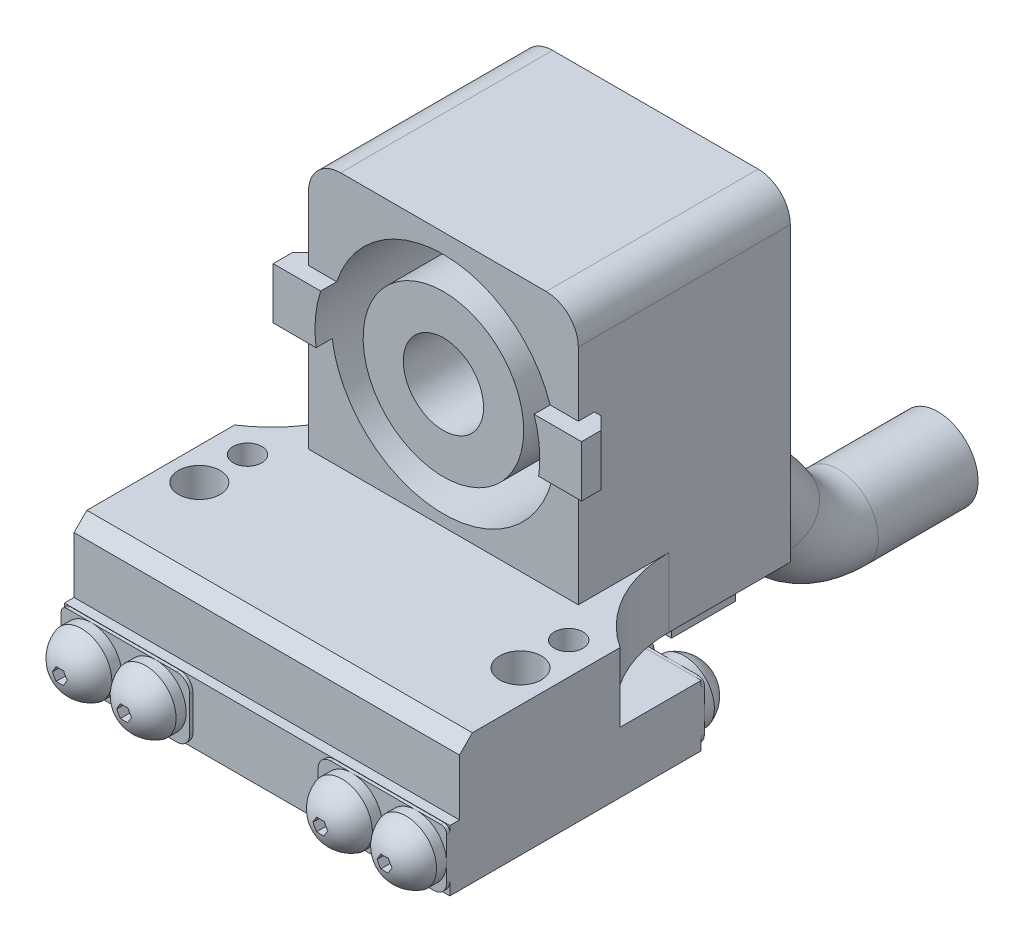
ISO-10303-21;
HEADER;
FILE_DESCRIPTION(('STEP AP214'),'2;1');
FILE_NAME('part.step','',(''),(''),'','','');
FILE_SCHEMA(('AUTOMOTIVE_DESIGN { 1 0 10303 214 1 1 1 1 }'));
ENDSEC;
DATA;
#1=APPLICATION_CONTEXT('core data for automotive mechanical design processes');
#2=APPLICATION_PROTOCOL_DEFINITION('international standard','automotive_design',2000,#1);
#3=PRODUCT_CONTEXT('',#1,'mechanical');
#4=PRODUCT('Part','Part','',(#3));
#5=PRODUCT_RELATED_PRODUCT_CATEGORY('part','',(#4));
#6=PRODUCT_DEFINITION_FORMATION('','',#4);
#7=PRODUCT_DEFINITION_CONTEXT('part definition',#1,'design');
#8=PRODUCT_DEFINITION('design','',#6,#7);
#9=PRODUCT_DEFINITION_SHAPE('','',#8);
#10=(LENGTH_UNIT() NAMED_UNIT(*) SI_UNIT(.MILLI.,.METRE.));
#11=(NAMED_UNIT(*) PLANE_ANGLE_UNIT() SI_UNIT($,.RADIAN.));
#12=(NAMED_UNIT(*) SI_UNIT($,.STERADIAN.) SOLID_ANGLE_UNIT());
#13=UNCERTAINTY_MEASURE_WITH_UNIT(LENGTH_MEASURE(1.E-05),#10,'distance_accuracy_value','');
#14=(GEOMETRIC_REPRESENTATION_CONTEXT(3) GLOBAL_UNCERTAINTY_ASSIGNED_CONTEXT((#13)) GLOBAL_UNIT_ASSIGNED_CONTEXT((#10,
#11,#12)) REPRESENTATION_CONTEXT('',''));
#15=CARTESIAN_POINT('',(0.,0.,0.));
#16=DIRECTION('',(0.,0.,1.));
#17=DIRECTION('',(1.,0.,0.));
#18=AXIS2_PLACEMENT_3D('',#15,#16,#17);
#19=CARTESIAN_POINT('',(7.7597,2.4003,-20.1920475));
#20=DIRECTION('',(0.,0.,1.));
#21=DIRECTION('',(1.,0.,0.));
#22=AXIS2_PLACEMENT_3D('',#19,#20,#21);
#23=SPHERICAL_SURFACE('',#22,2.5092025);
#24=CARTESIAN_POINT('',(7.7597,2.4003,-20.92325));
#25=DIRECTION('',(0.,0.,1.));
#26=DIRECTION('',(1.,0.,0.));
#27=AXIS2_PLACEMENT_3D('',#24,#25,#26);
#28=CIRCLE('',#27,2.4003);
#29=CARTESIAN_POINT('',(10.16,2.4003,-20.92325));
#30=VERTEX_POINT('',#29);
#31=EDGE_CURVE('E946',#30,#30,#28,.T.);
#32=ORIENTED_EDGE('',*,*,#31,.F.);
#33=EDGE_LOOP('',(#32));
#34=FACE_BOUND('',#33,.T.);
#35=CARTESIAN_POINT('',(7.31975909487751,2.1463,-20.1920475));
#36=DIRECTION('',(0.866025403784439,0.5,0.));
#37=DIRECTION('',(-0.5,0.866025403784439,0.));
#38=AXIS2_PLACEMENT_3D('',#35,#36,#37);
#39=CIRCLE('',#38,2.45724097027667);
#40=CARTESIAN_POINT('',(7.17311212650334,2.4003,-22.6317220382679));
#41=VERTEX_POINT('',#40);
#42=CARTESIAN_POINT('',(7.46640606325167,1.8923,-22.6317220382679));
#43=VERTEX_POINT('',#42);
#44=EDGE_CURVE('E1855',#41,#43,#39,.F.);
#45=ORIENTED_EDGE('',*,*,#44,.T.);
#46=CARTESIAN_POINT('',(7.7597,1.8923,-20.1920475));
#47=DIRECTION('',(0.,1.,0.));
#48=DIRECTION('',(0.,0.,1.));
#49=AXIS2_PLACEMENT_3D('',#46,#47,#48);
#50=CIRCLE('',#49,2.45724097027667);
#51=CARTESIAN_POINT('',(8.05299393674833,1.8923,-22.6317220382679));
#52=VERTEX_POINT('',#51);
#53=EDGE_CURVE('E12',#43,#52,#50,.F.);
#54=ORIENTED_EDGE('',*,*,#53,.T.);
#55=CARTESIAN_POINT('',(8.19964090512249,2.1463,-20.1920475));
#56=DIRECTION('',(-0.866025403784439,0.5,0.));
#57=DIRECTION('',(-0.5,-0.866025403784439,0.));
#58=AXIS2_PLACEMENT_3D('',#55,#56,#57);
#59=CIRCLE('',#58,2.45724097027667);
#60=CARTESIAN_POINT('',(8.34628787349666,2.4003,-22.6317220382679));
#61=VERTEX_POINT('',#60);
#62=EDGE_CURVE('E42',#52,#61,#59,.F.);
#63=ORIENTED_EDGE('',*,*,#62,.T.);
#64=CARTESIAN_POINT('',(8.19964090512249,2.6543,-20.1920475));
#65=DIRECTION('',(-0.866025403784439,-0.5,0.));
#66=DIRECTION('',(0.5,-0.866025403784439,0.));
#67=AXIS2_PLACEMENT_3D('',#64,#65,#66);
#68=CIRCLE('',#67,2.45724097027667);
#69=CARTESIAN_POINT('',(8.05299393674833,2.9083,-22.6317220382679));
#70=VERTEX_POINT('',#69);
#71=EDGE_CURVE('E1869',#61,#70,#68,.F.);
#72=ORIENTED_EDGE('',*,*,#71,.T.);
#73=CARTESIAN_POINT('',(7.7597,2.9083,-20.1920475));
#74=DIRECTION('',(0.,-1.,0.));
#75=DIRECTION('',(0.,0.,-1.));
#76=AXIS2_PLACEMENT_3D('',#73,#74,#75);
#77=CIRCLE('',#76,2.45724097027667);
#78=CARTESIAN_POINT('',(7.46640606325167,2.9083,-22.6317220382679));
#79=VERTEX_POINT('',#78);
#80=EDGE_CURVE('E1861',#70,#79,#77,.F.);
#81=ORIENTED_EDGE('',*,*,#80,.T.);
#82=CARTESIAN_POINT('',(7.3197590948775,2.6543,-20.1920475));
#83=DIRECTION('',(0.866025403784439,-0.5,0.));
#84=DIRECTION('',(0.5,0.866025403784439,0.));
#85=AXIS2_PLACEMENT_3D('',#82,#83,#84);
#86=CIRCLE('',#85,2.45724097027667);
#87=EDGE_CURVE('E1858',#79,#41,#86,.F.);
#88=ORIENTED_EDGE('',*,*,#87,.T.);
#89=EDGE_LOOP('',(#45,#54,#63,#72,#81,#88));
#90=FACE_BOUND('',#89,.T.);
#91=ADVANCED_FACE('F35',(#34,#90),#23,.T.);
#92=CARTESIAN_POINT('',(12.8397,2.4003,-20.1920475));
#93=DIRECTION('',(0.,0.,1.));
#94=DIRECTION('',(1.,0.,0.));
#95=AXIS2_PLACEMENT_3D('',#92,#93,#94);
#96=SPHERICAL_SURFACE('',#95,2.5092025);
#97=CARTESIAN_POINT('',(12.8397,2.4003,-20.92325));
#98=DIRECTION('',(0.,0.,1.));
#99=DIRECTION('',(1.,0.,0.));
#100=AXIS2_PLACEMENT_3D('',#97,#98,#99);
#101=CIRCLE('',#100,2.4003);
#102=CARTESIAN_POINT('',(15.24,2.4003,-20.92325));
#103=VERTEX_POINT('',#102);
#104=EDGE_CURVE('E942',#103,#103,#101,.T.);
#105=ORIENTED_EDGE('',*,*,#104,.F.);
#106=EDGE_LOOP('',(#105));
#107=FACE_BOUND('',#106,.T.);
#108=CARTESIAN_POINT('',(12.3997590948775,2.6543,-20.1920475));
#109=DIRECTION('',(0.866025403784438,-0.500000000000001,0.));
#110=DIRECTION('',(0.500000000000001,0.866025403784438,0.));
#111=AXIS2_PLACEMENT_3D('',#108,#109,#110);
#112=CIRCLE('',#111,2.45724097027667);
#113=CARTESIAN_POINT('',(12.5464060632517,2.9083,-22.6317220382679));
#114=VERTEX_POINT('',#113);
#115=CARTESIAN_POINT('',(12.2531121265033,2.4003,-22.6317220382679));
#116=VERTEX_POINT('',#115);
#117=EDGE_CURVE('E2588',#114,#116,#112,.F.);
#118=ORIENTED_EDGE('',*,*,#117,.T.);
#119=CARTESIAN_POINT('',(12.3997590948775,2.1463,-20.1920475));
#120=DIRECTION('',(0.866025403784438,0.5,0.));
#121=DIRECTION('',(-0.5,0.866025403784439,0.));
#122=AXIS2_PLACEMENT_3D('',#119,#120,#121);
#123=CIRCLE('',#122,2.45724097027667);
#124=CARTESIAN_POINT('',(12.5464060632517,1.89229999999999,-22.6317220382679));
#125=VERTEX_POINT('',#124);
#126=EDGE_CURVE('E1859',#116,#125,#123,.F.);
#127=ORIENTED_EDGE('',*,*,#126,.T.);
#128=CARTESIAN_POINT('',(12.8397,1.89229999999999,-20.1920475));
#129=DIRECTION('',(0.,1.,0.));
#130=DIRECTION('',(0.,0.,1.));
#131=AXIS2_PLACEMENT_3D('',#128,#129,#130);
#132=CIRCLE('',#131,2.45724097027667);
#133=CARTESIAN_POINT('',(13.1329939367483,1.89229999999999,-22.6317220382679));
#134=VERTEX_POINT('',#133);
#135=EDGE_CURVE('E1864',#125,#134,#132,.F.);
#136=ORIENTED_EDGE('',*,*,#135,.T.);
#137=CARTESIAN_POINT('',(13.2796409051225,2.1463,-20.1920475));
#138=DIRECTION('',(-0.866025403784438,0.500000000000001,0.));
#139=DIRECTION('',(-0.500000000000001,-0.866025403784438,0.));
#140=AXIS2_PLACEMENT_3D('',#137,#138,#139);
#141=CIRCLE('',#140,2.45724097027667);
#142=CARTESIAN_POINT('',(13.4262878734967,2.4003,-22.6317220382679));
#143=VERTEX_POINT('',#142);
#144=EDGE_CURVE('E2597',#134,#143,#141,.F.);
#145=ORIENTED_EDGE('',*,*,#144,.T.);
#146=CARTESIAN_POINT('',(13.2796409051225,2.6543,-20.1920475));
#147=DIRECTION('',(-0.866025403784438,-0.500000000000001,0.));
#148=DIRECTION('',(0.500000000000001,-0.866025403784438,0.));
#149=AXIS2_PLACEMENT_3D('',#146,#147,#148);
#150=CIRCLE('',#149,2.45724097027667);
#151=CARTESIAN_POINT('',(13.1329939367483,2.9083,-22.6317220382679));
#152=VERTEX_POINT('',#151);
#153=EDGE_CURVE('E2594',#143,#152,#150,.F.);
#154=ORIENTED_EDGE('',*,*,#153,.T.);
#155=CARTESIAN_POINT('',(12.8397,2.9083,-20.1920475));
#156=DIRECTION('',(0.,-1.,0.));
#157=DIRECTION('',(1.,0.,0.));
#158=AXIS2_PLACEMENT_3D('',#155,#156,#157);
#159=CIRCLE('',#158,2.45724097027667);
#160=EDGE_CURVE('E2591',#152,#114,#159,.F.);
#161=ORIENTED_EDGE('',*,*,#160,.T.);
#162=EDGE_LOOP('',(#118,#127,#136,#145,#154,#161));
#163=FACE_BOUND('',#162,.T.);
#164=ADVANCED_FACE('F1843',(#107,#163),#96,.T.);
#165=CARTESIAN_POINT('',(7.7597,2.4003,0.316547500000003));
#166=DIRECTION('',(0.,0.,1.));
#167=DIRECTION('',(1.,0.,0.));
#168=AXIS2_PLACEMENT_3D('',#165,#166,#167);
#169=SPHERICAL_SURFACE('',#168,2.5092025);
#170=CARTESIAN_POINT('',(7.7597,2.4003,1.04775));
#171=DIRECTION('',(0.,0.,-1.));
#172=DIRECTION('',(-1.,0.,0.));
#173=AXIS2_PLACEMENT_3D('',#170,#171,#172);
#174=CIRCLE('',#173,2.4003);
#175=CARTESIAN_POINT('',(5.3594,2.4003,1.04775));
#176=VERTEX_POINT('',#175);
#177=EDGE_CURVE('E949',#176,#176,#174,.T.);
#178=ORIENTED_EDGE('',*,*,#177,.F.);
#179=EDGE_LOOP('',(#178));
#180=FACE_BOUND('',#179,.T.);
#181=CARTESIAN_POINT('',(7.7597,1.8923,0.316547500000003));
#182=DIRECTION('',(0.,1.,0.));
#183=DIRECTION('',(0.,0.,1.));
#184=AXIS2_PLACEMENT_3D('',#181,#182,#183);
#185=CIRCLE('',#184,2.45724097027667);
#186=CARTESIAN_POINT('',(8.05299393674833,1.8923,2.75622203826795));
#187=VERTEX_POINT('',#186);
#188=CARTESIAN_POINT('',(7.46640606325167,1.8923,2.75622203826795));
#189=VERTEX_POINT('',#188);
#190=EDGE_CURVE('E2565',#187,#189,#185,.F.);
#191=ORIENTED_EDGE('',*,*,#190,.T.);
#192=CARTESIAN_POINT('',(7.31975909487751,2.1463,0.316547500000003));
#193=DIRECTION('',(0.866025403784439,0.5,0.));
#194=DIRECTION('',(-0.5,0.866025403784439,0.));
#195=AXIS2_PLACEMENT_3D('',#192,#193,#194);
#196=CIRCLE('',#195,2.45724097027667);
#197=CARTESIAN_POINT('',(7.17311212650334,2.4003,2.75622203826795));
#198=VERTEX_POINT('',#197);
#199=EDGE_CURVE('E2568',#189,#198,#196,.F.);
#200=ORIENTED_EDGE('',*,*,#199,.T.);
#201=CARTESIAN_POINT('',(7.3197590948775,2.6543,0.316547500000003));
#202=DIRECTION('',(0.866025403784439,-0.5,0.));
#203=DIRECTION('',(0.5,0.866025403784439,0.));
#204=AXIS2_PLACEMENT_3D('',#201,#202,#203);
#205=CIRCLE('',#204,2.45724097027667);
#206=CARTESIAN_POINT('',(7.46640606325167,2.9083,2.75622203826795));
#207=VERTEX_POINT('',#206);
#208=EDGE_CURVE('E2585',#198,#207,#205,.F.);
#209=ORIENTED_EDGE('',*,*,#208,.T.);
#210=CARTESIAN_POINT('',(7.7597,2.9083,0.316547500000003));
#211=DIRECTION('',(0.,-1.,0.));
#212=DIRECTION('',(0.,0.,-1.));
#213=AXIS2_PLACEMENT_3D('',#210,#211,#212);
#214=CIRCLE('',#213,2.45724097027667);
#215=CARTESIAN_POINT('',(8.05299393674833,2.9083,2.75622203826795));
#216=VERTEX_POINT('',#215);
#217=EDGE_CURVE('E2582',#207,#216,#214,.F.);
#218=ORIENTED_EDGE('',*,*,#217,.T.);
#219=CARTESIAN_POINT('',(8.19964090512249,2.6543,0.316547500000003));
#220=DIRECTION('',(-0.866025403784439,-0.5,0.));
#221=DIRECTION('',(0.5,-0.866025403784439,0.));
#222=AXIS2_PLACEMENT_3D('',#219,#220,#221);
#223=CIRCLE('',#222,2.45724097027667);
#224=CARTESIAN_POINT('',(8.34628787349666,2.4003,2.75622203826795));
#225=VERTEX_POINT('',#224);
#226=EDGE_CURVE('E2574',#216,#225,#223,.F.);
#227=ORIENTED_EDGE('',*,*,#226,.T.);
#228=CARTESIAN_POINT('',(8.19964090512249,2.1463,0.316547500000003));
#229=DIRECTION('',(-0.866025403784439,0.5,0.));
#230=DIRECTION('',(-0.5,-0.866025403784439,0.));
#231=AXIS2_PLACEMENT_3D('',#228,#229,#230);
#232=CIRCLE('',#231,2.45724097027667);
#233=EDGE_CURVE('E2570',#225,#187,#232,.F.);
#234=ORIENTED_EDGE('',*,*,#233,.T.);
#235=EDGE_LOOP('',(#191,#200,#209,#218,#227,#234));
#236=FACE_BOUND('',#235,.T.);
#237=ADVANCED_FACE('F1849',(#180,#236),#169,.T.);
#238=CARTESIAN_POINT('',(12.8397,2.4003,0.316547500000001));
#239=DIRECTION('',(0.,0.,1.));
#240=DIRECTION('',(1.,0.,0.));
#241=AXIS2_PLACEMENT_3D('',#238,#239,#240);
#242=SPHERICAL_SURFACE('',#241,2.5092025);
#243=CARTESIAN_POINT('',(12.8397,2.4003,1.04775));
#244=DIRECTION('',(0.,0.,-1.));
#245=DIRECTION('',(-1.,0.,0.));
#246=AXIS2_PLACEMENT_3D('',#243,#244,#245);
#247=CIRCLE('',#246,2.4003);
#248=CARTESIAN_POINT('',(10.4394,2.4003,1.04775));
#249=VERTEX_POINT('',#248);
#250=EDGE_CURVE('E954',#249,#249,#247,.T.);
#251=ORIENTED_EDGE('',*,*,#250,.F.);
#252=EDGE_LOOP('',(#251));
#253=FACE_BOUND('',#252,.T.);
#254=CARTESIAN_POINT('',(12.3997590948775,2.1463,0.316547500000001));
#255=DIRECTION('',(0.866025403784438,0.5,0.));
#256=DIRECTION('',(-0.5,0.866025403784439,0.));
#257=AXIS2_PLACEMENT_3D('',#254,#255,#256);
#258=CIRCLE('',#257,2.45724097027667);
#259=CARTESIAN_POINT('',(12.5464060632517,1.89229999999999,2.75622203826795));
#260=VERTEX_POINT('',#259);
#261=CARTESIAN_POINT('',(12.2531121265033,2.4003,2.75622203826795));
#262=VERTEX_POINT('',#261);
#263=EDGE_CURVE('E2632',#260,#262,#258,.F.);
#264=ORIENTED_EDGE('',*,*,#263,.T.);
#265=CARTESIAN_POINT('',(12.3997590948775,2.6543,0.316547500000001));
#266=DIRECTION('',(0.866025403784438,-0.500000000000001,0.));
#267=DIRECTION('',(0.500000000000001,0.866025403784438,0.));
#268=AXIS2_PLACEMENT_3D('',#265,#266,#267);
#269=CIRCLE('',#268,2.45724097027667);
#270=CARTESIAN_POINT('',(12.5464060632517,2.9083,2.75622203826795));
#271=VERTEX_POINT('',#270);
#272=EDGE_CURVE('E2572',#262,#271,#269,.F.);
#273=ORIENTED_EDGE('',*,*,#272,.T.);
#274=CARTESIAN_POINT('',(12.8397,2.9083,0.316547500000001));
#275=DIRECTION('',(0.,-1.,0.));
#276=DIRECTION('',(1.,0.,0.));
#277=AXIS2_PLACEMENT_3D('',#274,#275,#276);
#278=CIRCLE('',#277,2.45724097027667);
#279=CARTESIAN_POINT('',(13.1329939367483,2.9083,2.75622203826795));
#280=VERTEX_POINT('',#279);
#281=EDGE_CURVE('E2577',#271,#280,#278,.F.);
#282=ORIENTED_EDGE('',*,*,#281,.T.);
#283=CARTESIAN_POINT('',(13.2796409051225,2.6543,0.316547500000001));
#284=DIRECTION('',(-0.866025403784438,-0.500000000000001,0.));
#285=DIRECTION('',(0.500000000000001,-0.866025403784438,0.));
#286=AXIS2_PLACEMENT_3D('',#283,#284,#285);
#287=CIRCLE('',#286,2.45724097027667);
#288=CARTESIAN_POINT('',(13.4262878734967,2.4003,2.75622203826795));
#289=VERTEX_POINT('',#288);
#290=EDGE_CURVE('E2623',#280,#289,#287,.F.);
#291=ORIENTED_EDGE('',*,*,#290,.T.);
#292=CARTESIAN_POINT('',(13.2796409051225,2.1463,0.316547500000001));
#293=DIRECTION('',(-0.866025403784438,0.500000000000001,0.));
#294=DIRECTION('',(-0.500000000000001,-0.866025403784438,0.));
#295=AXIS2_PLACEMENT_3D('',#292,#293,#294);
#296=CIRCLE('',#295,2.45724097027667);
#297=CARTESIAN_POINT('',(13.1329939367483,1.89229999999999,2.75622203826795));
#298=VERTEX_POINT('',#297);
#299=EDGE_CURVE('E2626',#289,#298,#296,.F.);
#300=ORIENTED_EDGE('',*,*,#299,.T.);
#301=CARTESIAN_POINT('',(12.8397,1.89229999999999,0.316547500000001));
#302=DIRECTION('',(0.,1.,0.));
#303=DIRECTION('',(0.,0.,1.));
#304=AXIS2_PLACEMENT_3D('',#301,#302,#303);
#305=CIRCLE('',#304,2.45724097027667);
#306=EDGE_CURVE('E2629',#298,#260,#305,.F.);
#307=ORIENTED_EDGE('',*,*,#306,.T.);
#308=EDGE_LOOP('',(#264,#273,#282,#291,#300,#307));
#309=FACE_BOUND('',#308,.T.);
#310=ADVANCED_FACE('F2551',(#253,#309),#242,.T.);
#311=CARTESIAN_POINT('',(14.7955,4.3561,-20.1295));
#312=DIRECTION('',(0.,0.,-1.));
#313=DIRECTION('',(1.,0.,0.));
#314=AXIS2_PLACEMENT_3D('',#311,#312,#313);
#315=PLANE('',#314);
#316=CARTESIAN_POINT('',(12.8397,2.4003,-20.1295));
#317=DIRECTION('',(0.,0.,1.));
#318=DIRECTION('',(1.,0.,0.));
#319=AXIS2_PLACEMENT_3D('',#316,#317,#318);
#320=CIRCLE('',#319,2.4003);
#321=CARTESIAN_POINT('',(15.24,2.4003,-20.1295));
#322=VERTEX_POINT('',#321);
#323=CARTESIAN_POINT('',(12.8397,4.80059999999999,-20.1295));
#324=VERTEX_POINT('',#323);
#325=EDGE_CURVE('E939',#322,#324,#320,.T.);
#326=ORIENTED_EDGE('',*,*,#325,.T.);
#327=DIRECTION('',(-1.,0.,0.));
#328=VECTOR('',#327,1.);
#329=CARTESIAN_POINT('',(14.7955,4.80059999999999,-20.1295));
#330=LINE('',#329,#328);
#331=CARTESIAN_POINT('',(14.7955,4.80059999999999,-20.1295));
#332=VERTEX_POINT('',#331);
#333=EDGE_CURVE('E981',#332,#324,#330,.T.);
#334=ORIENTED_EDGE('',*,*,#333,.F.);
#335=CARTESIAN_POINT('',(14.7955,4.3561,-20.1295));
#336=DIRECTION('',(0.,0.,1.));
#337=DIRECTION('',(1.,0.,0.));
#338=AXIS2_PLACEMENT_3D('',#335,#336,#337);
#339=CIRCLE('',#338,0.444499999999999);
#340=CARTESIAN_POINT('',(15.24,4.3561,-20.1295));
#341=VERTEX_POINT('',#340);
#342=EDGE_CURVE('E955',#341,#332,#339,.T.);
#343=ORIENTED_EDGE('',*,*,#342,.F.);
#344=DIRECTION('',(0.,1.,0.));
#345=VECTOR('',#344,1.);
#346=CARTESIAN_POINT('',(15.24,1.016,-20.1295));
#347=LINE('',#346,#345);
#348=EDGE_CURVE('E958',#322,#341,#347,.T.);
#349=ORIENTED_EDGE('',*,*,#348,.F.);
#350=EDGE_LOOP('',(#326,#334,#343,#349));
#351=FACE_BOUND('',#350,.T.);
#352=ADVANCED_FACE('F1999',(#351),#315,.T.);
#353=CARTESIAN_POINT('',(12.8397,0.,-20.1295));
#354=VERTEX_POINT('',#353);
#355=EDGE_CURVE('E925',#354,#322,#320,.T.);
#356=ORIENTED_EDGE('',*,*,#355,.T.);
#357=CARTESIAN_POINT('',(15.24,1.016,-20.1295));
#358=VERTEX_POINT('',#357);
#359=EDGE_CURVE('E960',#358,#322,#347,.T.);
#360=ORIENTED_EDGE('',*,*,#359,.F.);
#361=CARTESIAN_POINT('',(14.224,1.016,-20.1295));
#362=DIRECTION('',(0.,0.,1.));
#363=DIRECTION('',(1.,0.,0.));
#364=AXIS2_PLACEMENT_3D('',#361,#362,#363);
#365=CIRCLE('',#364,1.016);
#366=CARTESIAN_POINT('',(14.224,0.,-20.1295));
#367=VERTEX_POINT('',#366);
#368=EDGE_CURVE('E963',#367,#358,#365,.T.);
#369=ORIENTED_EDGE('',*,*,#368,.F.);
#370=DIRECTION('',(1.,0.,0.));
#371=VECTOR('',#370,1.);
#372=CARTESIAN_POINT('',(6.096,0.,-20.1295));
#373=LINE('',#372,#371);
#374=EDGE_CURVE('E966',#354,#367,#373,.T.);
#375=ORIENTED_EDGE('',*,*,#374,.F.);
#376=EDGE_LOOP('',(#356,#360,#369,#375));
#377=FACE_BOUND('',#376,.T.);
#378=ADVANCED_FACE('F2664',(#377),#315,.T.);
#379=EDGE_CURVE('E943',#324,#354,#320,.T.);
#380=ORIENTED_EDGE('',*,*,#379,.T.);
#381=CARTESIAN_POINT('',(7.7597,0.,-20.1295));
#382=VERTEX_POINT('',#381);
#383=EDGE_CURVE('E971',#382,#354,#373,.T.);
#384=ORIENTED_EDGE('',*,*,#383,.F.);
#385=CARTESIAN_POINT('',(7.7597,2.4003,-20.1295));
#386=DIRECTION('',(0.,0.,-1.));
#387=DIRECTION('',(-1.,0.,0.));
#388=AXIS2_PLACEMENT_3D('',#385,#386,#387);
#389=CIRCLE('',#388,2.4003);
#390=CARTESIAN_POINT('',(7.7597,4.8006,-20.1295));
#391=VERTEX_POINT('',#390);
#392=EDGE_CURVE('E2445',#391,#382,#389,.T.);
#393=ORIENTED_EDGE('',*,*,#392,.F.);
#394=EDGE_CURVE('E984',#324,#391,#330,.T.);
#395=ORIENTED_EDGE('',*,*,#394,.F.);
#396=EDGE_LOOP('',(#380,#384,#393,#395));
#397=FACE_BOUND('',#396,.T.);
#398=ADVANCED_FACE('F2000',(#397),#315,.T.);
#399=CARTESIAN_POINT('',(14.7955,4.3561,0.254));
#400=DIRECTION('',(0.,0.,1.));
#401=DIRECTION('',(-1.,0.,0.));
#402=AXIS2_PLACEMENT_3D('',#399,#400,#401);
#403=PLANE('',#402);
#404=CARTESIAN_POINT('',(7.7597,2.4003,0.254));
#405=DIRECTION('',(0.,0.,-1.));
#406=DIRECTION('',(-1.,0.,0.));
#407=AXIS2_PLACEMENT_3D('',#404,#405,#406);
#408=CIRCLE('',#407,2.4003);
#409=CARTESIAN_POINT('',(7.7597,0.,0.254));
#410=VERTEX_POINT('',#409);
#411=CARTESIAN_POINT('',(7.7597,4.8006,0.254));
#412=VERTEX_POINT('',#411);
#413=EDGE_CURVE('E950',#410,#412,#408,.T.);
#414=ORIENTED_EDGE('',*,*,#413,.T.);
#415=DIRECTION('',(1.,0.,0.));
#416=VECTOR('',#415,1.);
#417=CARTESIAN_POINT('',(14.7955,4.8006,0.254));
#418=LINE('',#417,#416);
#419=CARTESIAN_POINT('',(6.096,4.8006,0.254));
#420=VERTEX_POINT('',#419);
#421=EDGE_CURVE('E1024',#420,#412,#418,.T.);
#422=ORIENTED_EDGE('',*,*,#421,.F.);
#423=CARTESIAN_POINT('',(6.096,3.7846,0.254));
#424=DIRECTION('',(0.,0.,-1.));
#425=DIRECTION('',(1.,0.,0.));
#426=AXIS2_PLACEMENT_3D('',#423,#424,#425);
#427=CIRCLE('',#426,1.016);
#428=CARTESIAN_POINT('',(5.08,3.7846,0.254));
#429=VERTEX_POINT('',#428);
#430=EDGE_CURVE('E1026',#429,#420,#427,.T.);
#431=ORIENTED_EDGE('',*,*,#430,.F.);
#432=DIRECTION('',(0.,1.,0.));
#433=VECTOR('',#432,1.);
#434=CARTESIAN_POINT('',(5.08,3.7846,0.254));
#435=LINE('',#434,#433);
#436=CARTESIAN_POINT('',(5.08,1.016,0.254));
#437=VERTEX_POINT('',#436);
#438=EDGE_CURVE('E1030',#437,#429,#435,.T.);
#439=ORIENTED_EDGE('',*,*,#438,.F.);
#440=CARTESIAN_POINT('',(6.096,1.016,0.254));
#441=DIRECTION('',(0.,0.,-1.));
#442=DIRECTION('',(-1.,0.,0.));
#443=AXIS2_PLACEMENT_3D('',#440,#441,#442);
#444=CIRCLE('',#443,1.016);
#445=CARTESIAN_POINT('',(6.096,0.,0.254));
#446=VERTEX_POINT('',#445);
#447=EDGE_CURVE('E1033',#446,#437,#444,.T.);
#448=ORIENTED_EDGE('',*,*,#447,.F.);
#449=DIRECTION('',(-1.,0.,0.));
#450=VECTOR('',#449,1.);
#451=CARTESIAN_POINT('',(14.224,0.,0.254));
#452=LINE('',#451,#450);
#453=EDGE_CURVE('E1036',#410,#446,#452,.T.);
#454=ORIENTED_EDGE('',*,*,#453,.F.);
#455=EDGE_LOOP('',(#414,#422,#431,#439,#448,#454));
#456=FACE_BOUND('',#455,.T.);
#457=ADVANCED_FACE('F2029',(#456),#403,.T.);
#458=CARTESIAN_POINT('',(12.8397,2.4003,0.254));
#459=DIRECTION('',(0.,0.,-1.));
#460=DIRECTION('',(-1.,0.,0.));
#461=AXIS2_PLACEMENT_3D('',#458,#459,#460);
#462=CIRCLE('',#461,2.4003);
#463=CARTESIAN_POINT('',(12.8397,4.8006,0.254));
#464=VERTEX_POINT('',#463);
#465=CARTESIAN_POINT('',(15.24,2.4003,0.254));
#466=VERTEX_POINT('',#465);
#467=EDGE_CURVE('E951',#464,#466,#462,.T.);
#468=ORIENTED_EDGE('',*,*,#467,.T.);
#469=DIRECTION('',(0.,-1.,0.));
#470=VECTOR('',#469,1.);
#471=CARTESIAN_POINT('',(15.24,4.3561,0.254));
#472=LINE('',#471,#470);
#473=CARTESIAN_POINT('',(15.24,4.3561,0.254));
#474=VERTEX_POINT('',#473);
#475=EDGE_CURVE('E1045',#474,#466,#472,.T.);
#476=ORIENTED_EDGE('',*,*,#475,.F.);
#477=CARTESIAN_POINT('',(14.7955,4.3561,0.254));
#478=DIRECTION('',(0.,0.,-1.));
#479=DIRECTION('',(-1.,0.,0.));
#480=AXIS2_PLACEMENT_3D('',#477,#478,#479);
#481=CIRCLE('',#480,0.444499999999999);
#482=CARTESIAN_POINT('',(14.7955,4.8006,0.254));
#483=VERTEX_POINT('',#482);
#484=EDGE_CURVE('E1019',#483,#474,#481,.T.);
#485=ORIENTED_EDGE('',*,*,#484,.F.);
#486=EDGE_CURVE('E1022',#464,#483,#418,.T.);
#487=ORIENTED_EDGE('',*,*,#486,.F.);
#488=EDGE_LOOP('',(#468,#476,#485,#487));
#489=FACE_BOUND('',#488,.T.);
#490=ADVANCED_FACE('F2416',(#489),#403,.T.);
#491=EDGE_CURVE('E947',#412,#410,#408,.T.);
#492=ORIENTED_EDGE('',*,*,#491,.T.);
#493=CARTESIAN_POINT('',(12.8397,0.,0.254));
#494=VERTEX_POINT('',#493);
#495=EDGE_CURVE('E1041',#494,#410,#452,.T.);
#496=ORIENTED_EDGE('',*,*,#495,.F.);
#497=CARTESIAN_POINT('',(12.8397,2.4003,0.254));
#498=DIRECTION('',(0.,0.,1.));
#499=DIRECTION('',(1.,0.,0.));
#500=AXIS2_PLACEMENT_3D('',#497,#498,#499);
#501=CIRCLE('',#500,2.4003);
#502=EDGE_CURVE('E2640',#464,#494,#501,.T.);
#503=ORIENTED_EDGE('',*,*,#502,.F.);
#504=EDGE_CURVE('E1027',#412,#464,#418,.T.);
#505=ORIENTED_EDGE('',*,*,#504,.F.);
#506=EDGE_LOOP('',(#492,#496,#503,#505));
#507=FACE_BOUND('',#506,.T.);
#508=ADVANCED_FACE('F2030',(#507),#403,.T.);
#509=CARTESIAN_POINT('',(15.24,4.826,-19.8755));
#510=DIRECTION('',(0.,0.,1.));
#511=DIRECTION('',(1.,0.,0.));
#512=AXIS2_PLACEMENT_3D('',#509,#510,#511);
#513=PLANE('',#512);
#514=DIRECTION('',(-1.,0.,0.));
#515=VECTOR('',#514,1.);
#516=CARTESIAN_POINT('',(15.24,0.,-19.8755));
#517=LINE('',#516,#515);
#518=CARTESIAN_POINT('',(15.24,0.,-19.8755));
#519=VERTEX_POINT('',#518);
#520=CARTESIAN_POINT('',(14.224,0.,-19.8755));
#521=VERTEX_POINT('',#520);
#522=EDGE_CURVE('E1550',#519,#521,#517,.T.);
#523=ORIENTED_EDGE('',*,*,#522,.T.);
#524=CARTESIAN_POINT('',(14.224,1.016,-19.8755));
#525=DIRECTION('',(0.,0.,1.));
#526=DIRECTION('',(1.,0.,0.));
#527=AXIS2_PLACEMENT_3D('',#524,#525,#526);
#528=CIRCLE('',#527,1.016);
#529=CARTESIAN_POINT('',(15.24,1.016,-19.8755));
#530=VERTEX_POINT('',#529);
#531=EDGE_CURVE('E988',#521,#530,#528,.T.);
#532=ORIENTED_EDGE('',*,*,#531,.T.);
#533=DIRECTION('',(0.,1.,0.));
#534=VECTOR('',#533,1.);
#535=CARTESIAN_POINT('',(15.24,4.826,-19.8755));
#536=LINE('',#535,#534);
#537=EDGE_CURVE('E1795',#519,#530,#536,.T.);
#538=ORIENTED_EDGE('',*,*,#537,.F.);
#539=EDGE_LOOP('',(#523,#532,#538));
#540=FACE_BOUND('',#539,.T.);
#541=ADVANCED_FACE('F2406',(#540),#513,.F.);
#542=CARTESIAN_POINT('',(15.24,0.,0.));
#543=DIRECTION('',(0.,0.,-1.));
#544=DIRECTION('',(-1.,0.,0.));
#545=AXIS2_PLACEMENT_3D('',#542,#543,#544);
#546=PLANE('',#545);
#547=DIRECTION('',(1.,0.,0.));
#548=VECTOR('',#547,1.);
#549=CARTESIAN_POINT('',(14.7955,4.8006,0.));
#550=LINE('',#549,#548);
#551=CARTESIAN_POINT('',(6.096,4.8006,0.));
#552=VERTEX_POINT('',#551);
#553=CARTESIAN_POINT('',(14.7955,4.8006,0.));
#554=VERTEX_POINT('',#553);
#555=EDGE_CURVE('E1050',#552,#554,#550,.T.);
#556=ORIENTED_EDGE('',*,*,#555,.T.);
#557=CARTESIAN_POINT('',(14.7955,4.3561,0.));
#558=DIRECTION('',(0.,0.,-1.));
#559=DIRECTION('',(-1.,0.,0.));
#560=AXIS2_PLACEMENT_3D('',#557,#558,#559);
#561=CIRCLE('',#560,0.444499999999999);
#562=CARTESIAN_POINT('',(15.24,4.3561,0.));
#563=VERTEX_POINT('',#562);
#564=EDGE_CURVE('E1018',#554,#563,#561,.T.);
#565=ORIENTED_EDGE('',*,*,#564,.T.);
#566=DIRECTION('',(0.,-1.,0.));
#567=VECTOR('',#566,1.);
#568=CARTESIAN_POINT('',(15.24,0.,0.));
#569=LINE('',#568,#567);
#570=CARTESIAN_POINT('',(15.24,4.826,0.));
#571=VERTEX_POINT('',#570);
#572=EDGE_CURVE('E1573',#571,#563,#569,.T.);
#573=ORIENTED_EDGE('',*,*,#572,.F.);
#574=DIRECTION('',(-1.,0.,0.));
#575=VECTOR('',#574,1.);
#576=CARTESIAN_POINT('',(15.24,4.826,0.));
#577=LINE('',#576,#575);
#578=CARTESIAN_POINT('',(-15.24,4.826,0.));
#579=VERTEX_POINT('',#578);
#580=EDGE_CURVE('E1435',#571,#579,#577,.T.);
#581=ORIENTED_EDGE('',*,*,#580,.T.);
#582=DIRECTION('',(0.,-1.,0.));
#583=VECTOR('',#582,1.);
#584=CARTESIAN_POINT('',(-15.24,0.,0.));
#585=LINE('',#584,#583);
#586=CARTESIAN_POINT('',(-15.24,4.3561,0.));
#587=VERTEX_POINT('',#586);
#588=EDGE_CURVE('E1447',#579,#587,#585,.T.);
#589=ORIENTED_EDGE('',*,*,#588,.T.);
#590=CARTESIAN_POINT('',(-14.7955,4.3561,0.));
#591=DIRECTION('',(0.,0.,1.));
#592=DIRECTION('',(1.,0.,0.));
#593=AXIS2_PLACEMENT_3D('',#590,#591,#592);
#594=CIRCLE('',#593,0.444499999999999);
#595=CARTESIAN_POINT('',(-14.7955,4.8006,0.));
#596=VERTEX_POINT('',#595);
#597=EDGE_CURVE('E1304',#596,#587,#594,.T.);
#598=ORIENTED_EDGE('',*,*,#597,.F.);
#599=DIRECTION('',(-1.,0.,0.));
#600=VECTOR('',#599,1.);
#601=CARTESIAN_POINT('',(-14.7955,4.8006,0.));
#602=LINE('',#601,#600);
#603=CARTESIAN_POINT('',(-6.096,4.8006,0.));
#604=VERTEX_POINT('',#603);
#605=EDGE_CURVE('E1309',#604,#596,#602,.T.);
#606=ORIENTED_EDGE('',*,*,#605,.F.);
#607=CARTESIAN_POINT('',(-6.096,3.7846,0.));
#608=DIRECTION('',(0.,0.,1.));
#609=DIRECTION('',(-1.,0.,0.));
#610=AXIS2_PLACEMENT_3D('',#607,#608,#609);
#611=CIRCLE('',#610,1.016);
#612=CARTESIAN_POINT('',(-5.08,3.7846,0.));
#613=VERTEX_POINT('',#612);
#614=EDGE_CURVE('E1596',#613,#604,#611,.T.);
#615=ORIENTED_EDGE('',*,*,#614,.F.);
#616=DIRECTION('',(0.,1.,0.));
#617=VECTOR('',#616,1.);
#618=CARTESIAN_POINT('',(-5.08,3.7846,0.));
#619=LINE('',#618,#617);
#620=CARTESIAN_POINT('',(-5.08,1.016,0.));
#621=VERTEX_POINT('',#620);
#622=EDGE_CURVE('E1346',#621,#613,#619,.T.);
#623=ORIENTED_EDGE('',*,*,#622,.F.);
#624=CARTESIAN_POINT('',(-6.096,1.016,0.));
#625=DIRECTION('',(0.,0.,1.));
#626=DIRECTION('',(1.,0.,0.));
#627=AXIS2_PLACEMENT_3D('',#624,#625,#626);
#628=CIRCLE('',#627,1.016);
#629=CARTESIAN_POINT('',(-6.09599999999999,0.,0.));
#630=VERTEX_POINT('',#629);
#631=EDGE_CURVE('E1343',#630,#621,#628,.T.);
#632=ORIENTED_EDGE('',*,*,#631,.F.);
#633=DIRECTION('',(-1.,0.,0.));
#634=VECTOR('',#633,1.);
#635=CARTESIAN_POINT('',(15.24,0.,0.));
#636=LINE('',#635,#634);
#637=CARTESIAN_POINT('',(6.096,0.,0.));
#638=VERTEX_POINT('',#637);
#639=EDGE_CURVE('E1424',#638,#630,#636,.T.);
#640=ORIENTED_EDGE('',*,*,#639,.F.);
#641=CARTESIAN_POINT('',(6.096,1.016,0.));
#642=DIRECTION('',(0.,0.,-1.));
#643=DIRECTION('',(-1.,0.,0.));
#644=AXIS2_PLACEMENT_3D('',#641,#642,#643);
#645=CIRCLE('',#644,1.016);
#646=CARTESIAN_POINT('',(5.08,1.016,0.));
#647=VERTEX_POINT('',#646);
#648=EDGE_CURVE('E1059',#638,#647,#645,.T.);
#649=ORIENTED_EDGE('',*,*,#648,.T.);
#650=DIRECTION('',(0.,1.,0.));
#651=VECTOR('',#650,1.);
#652=CARTESIAN_POINT('',(5.08,3.7846,0.));
#653=LINE('',#652,#651);
#654=CARTESIAN_POINT('',(5.08,3.7846,0.));
#655=VERTEX_POINT('',#654);
#656=EDGE_CURVE('E1056',#647,#655,#653,.T.);
#657=ORIENTED_EDGE('',*,*,#656,.T.);
#658=CARTESIAN_POINT('',(6.096,3.7846,0.));
#659=DIRECTION('',(0.,0.,-1.));
#660=DIRECTION('',(1.,0.,0.));
#661=AXIS2_PLACEMENT_3D('',#658,#659,#660);
#662=CIRCLE('',#661,1.016);
#663=EDGE_CURVE('E1053',#655,#552,#662,.T.);
#664=ORIENTED_EDGE('',*,*,#663,.T.);
#665=EDGE_LOOP('',(#556,#565,#573,#581,#589,#598,#606,#615,#623,#632,#640,#649,#657,#664));
#666=FACE_BOUND('',#665,.T.);
#667=ADVANCED_FACE('F1570',(#666),#546,.F.);
#668=CARTESIAN_POINT('',(-14.7955,4.3561,-20.1295));
#669=DIRECTION('',(0.,0.,-1.));
#670=DIRECTION('',(-1.,0.,0.));
#671=AXIS2_PLACEMENT_3D('',#668,#669,#670);
#672=PLANE('',#671);
#673=DIRECTION('',(0.,1.,0.));
#674=VECTOR('',#673,1.);
#675=CARTESIAN_POINT('',(-15.24,1.016,-20.1295));
#676=LINE('',#675,#674);
#677=CARTESIAN_POINT('',(-15.24,1.016,-20.1295));
#678=VERTEX_POINT('',#677);
#679=CARTESIAN_POINT('',(-15.24,2.4003,-20.1295));
#680=VERTEX_POINT('',#679);
#681=EDGE_CURVE('E1260',#678,#680,#676,.T.);
#682=ORIENTED_EDGE('',*,*,#681,.T.);
#683=CARTESIAN_POINT('',(-12.8397,2.4003,-20.1295));
#684=DIRECTION('',(0.,0.,-1.));
#685=DIRECTION('',(-1.,0.,0.));
#686=AXIS2_PLACEMENT_3D('',#683,#684,#685);
#687=CIRCLE('',#686,2.4003);
#688=CARTESIAN_POINT('',(-12.8397,0.,-20.1295));
#689=VERTEX_POINT('',#688);
#690=EDGE_CURVE('E1359',#680,#689,#687,.F.);
#691=ORIENTED_EDGE('',*,*,#690,.T.);
#692=DIRECTION('',(-1.,0.,0.));
#693=VECTOR('',#692,1.);
#694=CARTESIAN_POINT('',(-6.096,0.,-20.1295));
#695=LINE('',#694,#693);
#696=CARTESIAN_POINT('',(-14.224,0.,-20.1295));
#697=VERTEX_POINT('',#696);
#698=EDGE_CURVE('E1252',#689,#697,#695,.T.);
#699=ORIENTED_EDGE('',*,*,#698,.T.);
#700=CARTESIAN_POINT('',(-14.224,1.016,-20.1295));
#701=DIRECTION('',(0.,0.,-1.));
#702=DIRECTION('',(-1.,0.,0.));
#703=AXIS2_PLACEMENT_3D('',#700,#701,#702);
#704=CIRCLE('',#703,1.016);
#705=EDGE_CURVE('E1256',#697,#678,#704,.T.);
#706=ORIENTED_EDGE('',*,*,#705,.T.);
#707=EDGE_LOOP('',(#682,#691,#699,#706));
#708=FACE_BOUND('',#707,.T.);
#709=ADVANCED_FACE('F2187',(#708),#672,.T.);
#710=CARTESIAN_POINT('',(-7.7597,0.,-20.1295));
#711=VERTEX_POINT('',#710);
#712=EDGE_CURVE('E1257',#711,#689,#695,.T.);
#713=ORIENTED_EDGE('',*,*,#712,.T.);
#714=CARTESIAN_POINT('',(-12.8397,4.8006,-20.1295));
#715=VERTEX_POINT('',#714);
#716=EDGE_CURVE('E1363',#689,#715,#687,.F.);
#717=ORIENTED_EDGE('',*,*,#716,.T.);
#718=DIRECTION('',(1.,0.,0.));
#719=VECTOR('',#718,1.);
#720=CARTESIAN_POINT('',(-14.7955,4.80059999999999,-20.1295));
#721=LINE('',#720,#719);
#722=CARTESIAN_POINT('',(-7.7597,4.8006,-20.1295));
#723=VERTEX_POINT('',#722);
#724=EDGE_CURVE('E1246',#715,#723,#721,.T.);
#725=ORIENTED_EDGE('',*,*,#724,.T.);
#726=CARTESIAN_POINT('',(-7.7597,2.4003,-20.1295));
#727=DIRECTION('',(0.,0.,-1.));
#728=DIRECTION('',(-1.,0.,0.));
#729=AXIS2_PLACEMENT_3D('',#726,#727,#728);
#730=CIRCLE('',#729,2.4003);
#731=EDGE_CURVE('E1227',#711,#723,#730,.T.);
#732=ORIENTED_EDGE('',*,*,#731,.F.);
#733=EDGE_LOOP('',(#713,#717,#725,#732));
#734=FACE_BOUND('',#733,.T.);
#735=ADVANCED_FACE('F2190',(#734),#672,.T.);
#736=CARTESIAN_POINT('',(-14.7955,4.80059999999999,-20.1295));
#737=VERTEX_POINT('',#736);
#738=EDGE_CURVE('E1242',#737,#715,#721,.T.);
#739=ORIENTED_EDGE('',*,*,#738,.T.);
#740=CARTESIAN_POINT('',(-12.8397,2.4003,-20.1295));
#741=DIRECTION('',(0.,0.,-1.));
#742=DIRECTION('',(-1.,0.,0.));
#743=AXIS2_PLACEMENT_3D('',#740,#741,#742);
#744=CIRCLE('',#743,2.4003);
#745=EDGE_CURVE('E1207',#680,#715,#744,.T.);
#746=ORIENTED_EDGE('',*,*,#745,.F.);
#747=CARTESIAN_POINT('',(-15.24,4.3561,-20.1295));
#748=VERTEX_POINT('',#747);
#749=EDGE_CURVE('E1259',#680,#748,#676,.T.);
#750=ORIENTED_EDGE('',*,*,#749,.T.);
#751=CARTESIAN_POINT('',(-14.7955,4.3561,-20.1295));
#752=DIRECTION('',(0.,0.,-1.));
#753=DIRECTION('',(-1.,0.,0.));
#754=AXIS2_PLACEMENT_3D('',#751,#752,#753);
#755=CIRCLE('',#754,0.444499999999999);
#756=EDGE_CURVE('E1237',#748,#737,#755,.T.);
#757=ORIENTED_EDGE('',*,*,#756,.T.);
#758=EDGE_LOOP('',(#739,#746,#750,#757));
#759=FACE_BOUND('',#758,.T.);
#760=ADVANCED_FACE('F2995',(#759),#672,.T.);
#761=EDGE_CURVE('E1223',#723,#711,#730,.T.);
#762=ORIENTED_EDGE('',*,*,#761,.F.);
#763=CARTESIAN_POINT('',(-6.096,4.8006,-20.1295));
#764=VERTEX_POINT('',#763);
#765=EDGE_CURVE('E1240',#723,#764,#721,.T.);
#766=ORIENTED_EDGE('',*,*,#765,.T.);
#767=CARTESIAN_POINT('',(-6.096,3.7846,-20.1295));
#768=DIRECTION('',(0.,0.,-1.));
#769=DIRECTION('',(-1.,0.,0.));
#770=AXIS2_PLACEMENT_3D('',#767,#768,#769);
#771=CIRCLE('',#770,1.016);
#772=CARTESIAN_POINT('',(-5.08,3.7846,-20.1295));
#773=VERTEX_POINT('',#772);
#774=EDGE_CURVE('E1245',#764,#773,#771,.T.);
#775=ORIENTED_EDGE('',*,*,#774,.T.);
#776=DIRECTION('',(0.,-1.,0.));
#777=VECTOR('',#776,1.);
#778=CARTESIAN_POINT('',(-5.08,3.7846,-20.1295));
#779=LINE('',#778,#777);
#780=CARTESIAN_POINT('',(-5.08,1.016,-20.1295));
#781=VERTEX_POINT('',#780);
#782=EDGE_CURVE('E1248',#773,#781,#779,.T.);
#783=ORIENTED_EDGE('',*,*,#782,.T.);
#784=CARTESIAN_POINT('',(-6.096,1.016,-20.1295));
#785=DIRECTION('',(0.,0.,-1.));
#786=DIRECTION('',(-1.,0.,0.));
#787=AXIS2_PLACEMENT_3D('',#784,#785,#786);
#788=CIRCLE('',#787,1.016);
#789=CARTESIAN_POINT('',(-6.096,0.,-20.1295));
#790=VERTEX_POINT('',#789);
#791=EDGE_CURVE('E1250',#781,#790,#788,.T.);
#792=ORIENTED_EDGE('',*,*,#791,.T.);
#793=EDGE_CURVE('E1253',#790,#711,#695,.T.);
#794=ORIENTED_EDGE('',*,*,#793,.T.);
#795=EDGE_LOOP('',(#762,#766,#775,#783,#792,#794));
#796=FACE_BOUND('',#795,.T.);
#797=ADVANCED_FACE('F2192',(#796),#672,.T.);
#798=CARTESIAN_POINT('',(-14.7955,4.3561,0.254));
#799=DIRECTION('',(0.,0.,1.));
#800=DIRECTION('',(1.,0.,0.));
#801=AXIS2_PLACEMENT_3D('',#798,#799,#800);
#802=PLANE('',#801);
#803=DIRECTION('',(1.,0.,0.));
#804=VECTOR('',#803,1.);
#805=CARTESIAN_POINT('',(-14.224,0.,0.254));
#806=LINE('',#805,#804);
#807=CARTESIAN_POINT('',(-12.8397,0.,0.254));
#808=VERTEX_POINT('',#807);
#809=CARTESIAN_POINT('',(-7.7597,0.,0.254));
#810=VERTEX_POINT('',#809);
#811=EDGE_CURVE('E1320',#808,#810,#806,.T.);
#812=ORIENTED_EDGE('',*,*,#811,.T.);
#813=CARTESIAN_POINT('',(-7.7597,2.4003,0.254));
#814=DIRECTION('',(0.,0.,1.));
#815=DIRECTION('',(1.,0.,0.));
#816=AXIS2_PLACEMENT_3D('',#813,#814,#815);
#817=CIRCLE('',#816,2.4003);
#818=CARTESIAN_POINT('',(-7.7597,4.8006,0.254));
#819=VERTEX_POINT('',#818);
#820=EDGE_CURVE('E1228',#819,#810,#817,.T.);
#821=ORIENTED_EDGE('',*,*,#820,.F.);
#822=DIRECTION('',(-1.,0.,0.));
#823=VECTOR('',#822,1.);
#824=CARTESIAN_POINT('',(-14.7955,4.8006,0.254));
#825=LINE('',#824,#823);
#826=CARTESIAN_POINT('',(-12.8397,4.8006,0.254));
#827=VERTEX_POINT('',#826);
#828=EDGE_CURVE('E1331',#819,#827,#825,.T.);
#829=ORIENTED_EDGE('',*,*,#828,.T.);
#830=CARTESIAN_POINT('',(-12.8397,2.4003,0.254));
#831=DIRECTION('',(0.,0.,1.));
#832=DIRECTION('',(1.,0.,0.));
#833=AXIS2_PLACEMENT_3D('',#830,#831,#832);
#834=CIRCLE('',#833,2.4003);
#835=EDGE_CURVE('E1236',#808,#827,#834,.T.);
#836=ORIENTED_EDGE('',*,*,#835,.F.);
#837=EDGE_LOOP('',(#812,#821,#829,#836));
#838=FACE_BOUND('',#837,.T.);
#839=ADVANCED_FACE('F2216',(#838),#802,.T.);
#840=CARTESIAN_POINT('',(-6.096,4.8006,0.254));
#841=VERTEX_POINT('',#840);
#842=EDGE_CURVE('E1327',#841,#819,#825,.T.);
#843=ORIENTED_EDGE('',*,*,#842,.T.);
#844=CARTESIAN_POINT('',(-7.7597,2.4003,0.254));
#845=DIRECTION('',(0.,0.,1.));
#846=DIRECTION('',(1.,0.,0.));
#847=AXIS2_PLACEMENT_3D('',#844,#845,#846);
#848=CIRCLE('',#847,2.4003);
#849=EDGE_CURVE('E1356',#819,#810,#848,.F.);
#850=ORIENTED_EDGE('',*,*,#849,.T.);
#851=CARTESIAN_POINT('',(-6.096,0.,0.254));
#852=VERTEX_POINT('',#851);
#853=EDGE_CURVE('E1315',#810,#852,#806,.T.);
#854=ORIENTED_EDGE('',*,*,#853,.T.);
#855=CARTESIAN_POINT('',(-6.096,1.016,0.254));
#856=DIRECTION('',(0.,0.,1.));
#857=DIRECTION('',(1.,0.,0.));
#858=AXIS2_PLACEMENT_3D('',#855,#856,#857);
#859=CIRCLE('',#858,1.016);
#860=CARTESIAN_POINT('',(-5.08,1.016,0.254));
#861=VERTEX_POINT('',#860);
#862=EDGE_CURVE('E1319',#852,#861,#859,.T.);
#863=ORIENTED_EDGE('',*,*,#862,.T.);
#864=DIRECTION('',(0.,1.,0.));
#865=VECTOR('',#864,1.);
#866=CARTESIAN_POINT('',(-5.08,3.7846,0.254));
#867=LINE('',#866,#865);
#868=CARTESIAN_POINT('',(-5.08,3.7846,0.254));
#869=VERTEX_POINT('',#868);
#870=EDGE_CURVE('E1322',#861,#869,#867,.T.);
#871=ORIENTED_EDGE('',*,*,#870,.T.);
#872=CARTESIAN_POINT('',(-6.096,3.7846,0.254));
#873=DIRECTION('',(0.,0.,1.));
#874=DIRECTION('',(-1.,0.,0.));
#875=AXIS2_PLACEMENT_3D('',#872,#873,#874);
#876=CIRCLE('',#875,1.016);
#877=EDGE_CURVE('E1324',#869,#841,#876,.T.);
#878=ORIENTED_EDGE('',*,*,#877,.T.);
#879=EDGE_LOOP('',(#843,#850,#854,#863,#871,#878));
#880=FACE_BOUND('',#879,.T.);
#881=ADVANCED_FACE('F2219',(#880),#802,.T.);
#882=CARTESIAN_POINT('',(-15.24,2.4003,0.254));
#883=VERTEX_POINT('',#882);
#884=EDGE_CURVE('E1231',#827,#883,#834,.T.);
#885=ORIENTED_EDGE('',*,*,#884,.F.);
#886=CARTESIAN_POINT('',(-14.7955,4.8006,0.254));
#887=VERTEX_POINT('',#886);
#888=EDGE_CURVE('E1326',#827,#887,#825,.T.);
#889=ORIENTED_EDGE('',*,*,#888,.T.);
#890=CARTESIAN_POINT('',(-14.7955,4.3561,0.254));
#891=DIRECTION('',(0.,0.,1.));
#892=DIRECTION('',(1.,0.,0.));
#893=AXIS2_PLACEMENT_3D('',#890,#891,#892);
#894=CIRCLE('',#893,0.444499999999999);
#895=CARTESIAN_POINT('',(-15.24,4.3561,0.254));
#896=VERTEX_POINT('',#895);
#897=EDGE_CURVE('E1305',#887,#896,#894,.T.);
#898=ORIENTED_EDGE('',*,*,#897,.T.);
#899=DIRECTION('',(0.,-1.,0.));
#900=VECTOR('',#899,1.);
#901=CARTESIAN_POINT('',(-15.24,4.3561,0.254));
#902=LINE('',#901,#900);
#903=EDGE_CURVE('E1310',#896,#883,#902,.T.);
#904=ORIENTED_EDGE('',*,*,#903,.T.);
#905=EDGE_LOOP('',(#885,#889,#898,#904));
#906=FACE_BOUND('',#905,.T.);
#907=ADVANCED_FACE('F2424',(#906),#802,.T.);
#908=EDGE_CURVE('E1235',#883,#808,#834,.T.);
#909=ORIENTED_EDGE('',*,*,#908,.F.);
#910=CARTESIAN_POINT('',(-15.24,1.016,0.254));
#911=VERTEX_POINT('',#910);
#912=EDGE_CURVE('E1308',#883,#911,#902,.T.);
#913=ORIENTED_EDGE('',*,*,#912,.T.);
#914=CARTESIAN_POINT('',(-14.224,1.016,0.254));
#915=DIRECTION('',(0.,0.,1.));
#916=DIRECTION('',(1.,0.,0.));
#917=AXIS2_PLACEMENT_3D('',#914,#915,#916);
#918=CIRCLE('',#917,1.016);
#919=CARTESIAN_POINT('',(-14.224,0.,0.254));
#920=VERTEX_POINT('',#919);
#921=EDGE_CURVE('E1313',#911,#920,#918,.T.);
#922=ORIENTED_EDGE('',*,*,#921,.T.);
#923=EDGE_CURVE('E1316',#920,#808,#806,.T.);
#924=ORIENTED_EDGE('',*,*,#923,.T.);
#925=EDGE_LOOP('',(#909,#913,#922,#924));
#926=FACE_BOUND('',#925,.T.);
#927=ADVANCED_FACE('F2221',(#926),#802,.T.);
#928=CARTESIAN_POINT('',(15.24,4.3561,-19.8755));
#929=VERTEX_POINT('',#928);
#930=CARTESIAN_POINT('',(15.24,4.826,-19.8755));
#931=VERTEX_POINT('',#930);
#932=EDGE_CURVE('E1794',#929,#931,#536,.T.);
#933=ORIENTED_EDGE('',*,*,#932,.F.);
#934=CARTESIAN_POINT('',(14.7955,4.3561,-19.8755));
#935=DIRECTION('',(0.,0.,1.));
#936=DIRECTION('',(1.,0.,0.));
#937=AXIS2_PLACEMENT_3D('',#934,#935,#936);
#938=CIRCLE('',#937,0.444499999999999);
#939=CARTESIAN_POINT('',(14.7955,4.80059999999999,-19.8755));
#940=VERTEX_POINT('',#939);
#941=EDGE_CURVE('E985',#929,#940,#938,.T.);
#942=ORIENTED_EDGE('',*,*,#941,.T.);
#943=DIRECTION('',(-1.,0.,0.));
#944=VECTOR('',#943,1.);
#945=CARTESIAN_POINT('',(14.7955,4.80059999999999,-19.8755));
#946=LINE('',#945,#944);
#947=CARTESIAN_POINT('',(6.096,4.8006,-19.8755));
#948=VERTEX_POINT('',#947);
#949=EDGE_CURVE('E959',#940,#948,#946,.T.);
#950=ORIENTED_EDGE('',*,*,#949,.T.);
#951=CARTESIAN_POINT('',(6.096,3.7846,-19.8755));
#952=DIRECTION('',(0.,0.,1.));
#953=DIRECTION('',(1.,0.,0.));
#954=AXIS2_PLACEMENT_3D('',#951,#952,#953);
#955=CIRCLE('',#954,1.016);
#956=CARTESIAN_POINT('',(5.08,3.7846,-19.8755));
#957=VERTEX_POINT('',#956);
#958=EDGE_CURVE('E997',#948,#957,#955,.T.);
#959=ORIENTED_EDGE('',*,*,#958,.T.);
#960=DIRECTION('',(0.,-1.,0.));
#961=VECTOR('',#960,1.);
#962=CARTESIAN_POINT('',(5.08,3.7846,-19.8755));
#963=LINE('',#962,#961);
#964=CARTESIAN_POINT('',(5.08,1.016,-19.8755));
#965=VERTEX_POINT('',#964);
#966=EDGE_CURVE('E994',#957,#965,#963,.T.);
#967=ORIENTED_EDGE('',*,*,#966,.T.);
#968=CARTESIAN_POINT('',(6.096,1.016,-19.8755));
#969=DIRECTION('',(0.,0.,1.));
#970=DIRECTION('',(1.,0.,0.));
#971=AXIS2_PLACEMENT_3D('',#968,#969,#970);
#972=CIRCLE('',#971,1.016);
#973=CARTESIAN_POINT('',(6.096,0.,-19.8755));
#974=VERTEX_POINT('',#973);
#975=EDGE_CURVE('E991',#965,#974,#972,.T.);
#976=ORIENTED_EDGE('',*,*,#975,.T.);
#977=CARTESIAN_POINT('',(-6.09599999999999,0.,-19.8755));
#978=VERTEX_POINT('',#977);
#979=EDGE_CURVE('E1553',#974,#978,#517,.T.);
#980=ORIENTED_EDGE('',*,*,#979,.T.);
#981=CARTESIAN_POINT('',(-6.096,1.016,-19.8755));
#982=DIRECTION('',(0.,0.,-1.));
#983=DIRECTION('',(-1.,0.,0.));
#984=AXIS2_PLACEMENT_3D('',#981,#982,#983);
#985=CIRCLE('',#984,1.016);
#986=CARTESIAN_POINT('',(-5.08,1.016,-19.8755));
#987=VERTEX_POINT('',#986);
#988=EDGE_CURVE('E1276',#987,#978,#985,.T.);
#989=ORIENTED_EDGE('',*,*,#988,.F.);
#990=DIRECTION('',(0.,-1.,0.));
#991=VECTOR('',#990,1.);
#992=CARTESIAN_POINT('',(-5.08,3.7846,-19.8755));
#993=LINE('',#992,#991);
#994=CARTESIAN_POINT('',(-5.08,3.7846,-19.8755));
#995=VERTEX_POINT('',#994);
#996=EDGE_CURVE('E1273',#995,#987,#993,.T.);
#997=ORIENTED_EDGE('',*,*,#996,.F.);
#998=CARTESIAN_POINT('',(-6.096,3.7846,-19.8755));
#999=DIRECTION('',(0.,0.,-1.));
#1000=DIRECTION('',(-1.,0.,0.));
#1001=AXIS2_PLACEMENT_3D('',#998,#999,#1000);
#1002=CIRCLE('',#1001,1.016);
#1003=CARTESIAN_POINT('',(-6.096,4.8006,-19.8755));
#1004=VERTEX_POINT('',#1003);
#1005=EDGE_CURVE('E1270',#1004,#995,#1002,.T.);
#1006=ORIENTED_EDGE('',*,*,#1005,.F.);
#1007=DIRECTION('',(1.,0.,0.));
#1008=VECTOR('',#1007,1.);
#1009=CARTESIAN_POINT('',(-14.7955,4.80059999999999,-19.8755));
#1010=LINE('',#1009,#1008);
#1011=CARTESIAN_POINT('',(-14.7955,4.80059999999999,-19.8755));
#1012=VERTEX_POINT('',#1011);
#1013=EDGE_CURVE('E1267',#1012,#1004,#1010,.T.);
#1014=ORIENTED_EDGE('',*,*,#1013,.F.);
#1015=CARTESIAN_POINT('',(-14.7955,4.3561,-19.8755));
#1016=DIRECTION('',(0.,0.,-1.));
#1017=DIRECTION('',(-1.,0.,0.));
#1018=AXIS2_PLACEMENT_3D('',#1015,#1016,#1017);
#1019=CIRCLE('',#1018,0.444499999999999);
#1020=CARTESIAN_POINT('',(-15.24,4.3561,-19.8755));
#1021=VERTEX_POINT('',#1020);
#1022=EDGE_CURVE('E1264',#1021,#1012,#1019,.T.);
#1023=ORIENTED_EDGE('',*,*,#1022,.F.);
#1024=DIRECTION('',(0.,1.,0.));
#1025=VECTOR('',#1024,1.);
#1026=CARTESIAN_POINT('',(-15.24,4.826,-19.8755));
#1027=LINE('',#1026,#1025);
#1028=CARTESIAN_POINT('',(-15.24,4.826,-19.8755));
#1029=VERTEX_POINT('',#1028);
#1030=EDGE_CURVE('E1814',#1021,#1029,#1027,.T.);
#1031=ORIENTED_EDGE('',*,*,#1030,.T.);
#1032=DIRECTION('',(-1.,0.,0.));
#1033=VECTOR('',#1032,1.);
#1034=CARTESIAN_POINT('',(15.24,4.826,-19.8755));
#1035=LINE('',#1034,#1033);
#1036=CARTESIAN_POINT('',(-10.8753242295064,4.826,-19.8755));
#1037=VERTEX_POINT('',#1036);
#1038=EDGE_CURVE('E1557',#1037,#1029,#1035,.T.);
#1039=ORIENTED_EDGE('',*,*,#1038,.F.);
#1040=DIRECTION('',(1.,0.,0.));
#1041=VECTOR('',#1040,1.);
#1042=CARTESIAN_POINT('',(15.24,4.826,-19.8755));
#1043=LINE('',#1042,#1041);
#1044=CARTESIAN_POINT('',(10.8753242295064,4.826,-19.8755));
#1045=VERTEX_POINT('',#1044);
#1046=EDGE_CURVE('E1534',#1037,#1045,#1043,.T.);
#1047=ORIENTED_EDGE('',*,*,#1046,.T.);
#1048=EDGE_CURVE('E1555',#931,#1045,#1035,.T.);
#1049=ORIENTED_EDGE('',*,*,#1048,.F.);
#1050=EDGE_LOOP('',(#933,#942,#950,#959,#967,#976,#980,#989,#997,#1006,#1014,#1023,#1031,#1039,
#1047,#1049));
#1051=FACE_BOUND('',#1050,.T.);
#1052=ADVANCED_FACE('F2403',(#1051),#513,.F.);
#1053=CARTESIAN_POINT('',(-14.224,1.016,-19.8755));
#1054=DIRECTION('',(0.,0.,-1.));
#1055=DIRECTION('',(-1.,0.,0.));
#1056=AXIS2_PLACEMENT_3D('',#1053,#1054,#1055);
#1057=CIRCLE('',#1056,1.016);
#1058=CARTESIAN_POINT('',(-14.224,0.,-19.8755));
#1059=VERTEX_POINT('',#1058);
#1060=CARTESIAN_POINT('',(-15.24,1.016,-19.8755));
#1061=VERTEX_POINT('',#1060);
#1062=EDGE_CURVE('E1241',#1059,#1061,#1057,.T.);
#1063=ORIENTED_EDGE('',*,*,#1062,.F.);
#1064=CARTESIAN_POINT('',(-15.24,0.,-19.8755));
#1065=VERTEX_POINT('',#1064);
#1066=EDGE_CURVE('E1554',#1059,#1065,#517,.T.);
#1067=ORIENTED_EDGE('',*,*,#1066,.T.);
#1068=EDGE_CURVE('E1815',#1065,#1061,#1027,.T.);
#1069=ORIENTED_EDGE('',*,*,#1068,.T.);
#1070=EDGE_LOOP('',(#1063,#1067,#1069));
#1071=FACE_BOUND('',#1070,.T.);
#1072=ADVANCED_FACE('F2394',(#1071),#513,.F.);
#1073=CARTESIAN_POINT('',(15.24,1.016,0.));
#1074=VERTEX_POINT('',#1073);
#1075=CARTESIAN_POINT('',(15.24,0.,0.));
#1076=VERTEX_POINT('',#1075);
#1077=EDGE_CURVE('E1810',#1074,#1076,#569,.T.);
#1078=ORIENTED_EDGE('',*,*,#1077,.F.);
#1079=CARTESIAN_POINT('',(14.224,1.016,0.));
#1080=DIRECTION('',(0.,0.,-1.));
#1081=DIRECTION('',(-1.,0.,0.));
#1082=AXIS2_PLACEMENT_3D('',#1079,#1080,#1081);
#1083=CIRCLE('',#1082,1.016);
#1084=CARTESIAN_POINT('',(14.224,0.,0.));
#1085=VERTEX_POINT('',#1084);
#1086=EDGE_CURVE('E1023',#1074,#1085,#1083,.T.);
#1087=ORIENTED_EDGE('',*,*,#1086,.T.);
#1088=EDGE_CURVE('E1427',#1076,#1085,#636,.T.);
#1089=ORIENTED_EDGE('',*,*,#1088,.F.);
#1090=EDGE_LOOP('',(#1078,#1087,#1089));
#1091=FACE_BOUND('',#1090,.T.);
#1092=ADVANCED_FACE('F2392',(#1091),#546,.F.);
#1093=CARTESIAN_POINT('',(-14.224,1.016,0.));
#1094=DIRECTION('',(0.,0.,1.));
#1095=DIRECTION('',(1.,0.,0.));
#1096=AXIS2_PLACEMENT_3D('',#1093,#1094,#1095);
#1097=CIRCLE('',#1096,1.016);
#1098=CARTESIAN_POINT('',(-15.24,1.016,0.));
#1099=VERTEX_POINT('',#1098);
#1100=CARTESIAN_POINT('',(-14.224,0.,0.));
#1101=VERTEX_POINT('',#1100);
#1102=EDGE_CURVE('E1340',#1099,#1101,#1097,.T.);
#1103=ORIENTED_EDGE('',*,*,#1102,.F.);
#1104=CARTESIAN_POINT('',(-15.24,0.,0.));
#1105=VERTEX_POINT('',#1104);
#1106=EDGE_CURVE('E1444',#1099,#1105,#585,.T.);
#1107=ORIENTED_EDGE('',*,*,#1106,.T.);
#1108=EDGE_CURVE('E1428',#1101,#1105,#636,.T.);
#1109=ORIENTED_EDGE('',*,*,#1108,.F.);
#1110=EDGE_LOOP('',(#1103,#1107,#1109));
#1111=FACE_BOUND('',#1110,.T.);
#1112=ADVANCED_FACE('F2378',(#1111),#546,.F.);
#1113=CARTESIAN_POINT('',(-10.668,45.7024705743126,-31.496));
#1114=DIRECTION('',(0.,0.,1.));
#1115=DIRECTION('',(1.,0.,0.));
#1116=AXIS2_PLACEMENT_3D('',#1113,#1114,#1115);
#1117=PLANE('',#1116);
#1118=CARTESIAN_POINT('',(0.,20.066,-31.496));
#1119=DIRECTION('',(0.,0.,1.));
#1120=DIRECTION('',(1.,0.,0.));
#1121=AXIS2_PLACEMENT_3D('',#1118,#1119,#1120);
#1122=CIRCLE('',#1121,3.175);
#1123=CARTESIAN_POINT('',(3.175,20.066,-31.496));
#1124=VERTEX_POINT('',#1123);
#1125=EDGE_CURVE('E1454',#1124,#1124,#1122,.T.);
#1126=ORIENTED_EDGE('',*,*,#1125,.T.);
#1127=EDGE_LOOP('',(#1126));
#1128=FACE_BOUND('',#1127,.T.);
#1129=DIRECTION('',(-1.,0.,0.));
#1130=VECTOR('',#1129,1.);
#1131=CARTESIAN_POINT('',(-6.35,0.,-31.496));
#1132=LINE('',#1131,#1130);
#1133=CARTESIAN_POINT('',(6.35,0.,-31.496));
#1134=VERTEX_POINT('',#1133);
#1135=CARTESIAN_POINT('',(0.,0.,-31.496));
#1136=VERTEX_POINT('',#1135);
#1137=EDGE_CURVE('E1627',#1134,#1136,#1132,.T.);
#1138=ORIENTED_EDGE('',*,*,#1137,.T.);
#1139=CARTESIAN_POINT('',(0.,3.175,-31.496));
#1140=DIRECTION('',(0.,0.,-1.));
#1141=DIRECTION('',(-1.,0.,0.));
#1142=AXIS2_PLACEMENT_3D('',#1139,#1140,#1141);
#1143=CIRCLE('',#1142,3.175);
#1144=EDGE_CURVE('E1582',#1136,#1136,#1143,.T.);
#1145=ORIENTED_EDGE('',*,*,#1144,.F.);
#1146=CARTESIAN_POINT('',(-6.35,0.,-31.496));
#1147=VERTEX_POINT('',#1146);
#1148=EDGE_CURVE('E1625',#1136,#1147,#1132,.T.);
#1149=ORIENTED_EDGE('',*,*,#1148,.T.);
#1150=DIRECTION('',(0.,1.,0.));
#1151=VECTOR('',#1150,1.);
#1152=CARTESIAN_POINT('',(-6.35,-13.6783186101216,-31.496));
#1153=LINE('',#1152,#1151);
#1154=CARTESIAN_POINT('',(-6.35,4.826,-31.496));
#1155=VERTEX_POINT('',#1154);
#1156=EDGE_CURVE('E1646',#1147,#1155,#1153,.T.);
#1157=ORIENTED_EDGE('',*,*,#1156,.T.);
#1158=DIRECTION('',(-1.,0.,0.));
#1159=VECTOR('',#1158,1.);
#1160=CARTESIAN_POINT('',(-10.668,4.826,-31.496));
#1161=LINE('',#1160,#1159);
#1162=CARTESIAN_POINT('',(-10.668,4.826,-31.496));
#1163=VERTEX_POINT('',#1162);
#1164=EDGE_CURVE('E1781',#1155,#1163,#1161,.T.);
#1165=ORIENTED_EDGE('',*,*,#1164,.T.);
#1166=DIRECTION('',(0.,-1.,0.));
#1167=VECTOR('',#1166,1.);
#1168=CARTESIAN_POINT('',(-10.668,45.7024705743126,-31.496));
#1169=LINE('',#1168,#1167);
#1170=CARTESIAN_POINT('',(-10.668,27.94,-31.496));
#1171=VERTEX_POINT('',#1170);
#1172=EDGE_CURVE('E1528',#1171,#1163,#1169,.T.);
#1173=ORIENTED_EDGE('',*,*,#1172,.F.);
#1174=CARTESIAN_POINT('',(-8.128,27.94,-31.496));
#1175=DIRECTION('',(0.,0.,1.));
#1176=DIRECTION('',(1.,0.,0.));
#1177=AXIS2_PLACEMENT_3D('',#1174,#1175,#1176);
#1178=CIRCLE('',#1177,2.54);
#1179=CARTESIAN_POINT('',(-8.128,30.48,-31.496));
#1180=VERTEX_POINT('',#1179);
#1181=EDGE_CURVE('E1495',#1171,#1180,#1178,.F.);
#1182=ORIENTED_EDGE('',*,*,#1181,.T.);
#1183=DIRECTION('',(-1.,0.,0.));
#1184=VECTOR('',#1183,1.);
#1185=CARTESIAN_POINT('',(-10.668,30.48,-31.496));
#1186=LINE('',#1185,#1184);
#1187=CARTESIAN_POINT('',(8.128,30.48,-31.496));
#1188=VERTEX_POINT('',#1187);
#1189=EDGE_CURVE('E1754',#1188,#1180,#1186,.T.);
#1190=ORIENTED_EDGE('',*,*,#1189,.F.);
#1191=CARTESIAN_POINT('',(8.128,27.94,-31.496));
#1192=DIRECTION('',(0.,0.,1.));
#1193=DIRECTION('',(1.,0.,0.));
#1194=AXIS2_PLACEMENT_3D('',#1191,#1192,#1193);
#1195=CIRCLE('',#1194,2.54);
#1196=CARTESIAN_POINT('',(10.668,27.94,-31.496));
#1197=VERTEX_POINT('',#1196);
#1198=EDGE_CURVE('E1497',#1188,#1197,#1195,.F.);
#1199=ORIENTED_EDGE('',*,*,#1198,.T.);
#1200=DIRECTION('',(0.,-1.,0.));
#1201=VECTOR('',#1200,1.);
#1202=CARTESIAN_POINT('',(10.668,45.7024705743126,-31.496));
#1203=LINE('',#1202,#1201);
#1204=CARTESIAN_POINT('',(10.668,4.826,-31.496));
#1205=VERTEX_POINT('',#1204);
#1206=EDGE_CURVE('E1518',#1197,#1205,#1203,.T.);
#1207=ORIENTED_EDGE('',*,*,#1206,.T.);
#1208=CARTESIAN_POINT('',(6.35,4.826,-31.496));
#1209=VERTEX_POINT('',#1208);
#1210=EDGE_CURVE('E1782',#1205,#1209,#1161,.T.);
#1211=ORIENTED_EDGE('',*,*,#1210,.T.);
#1212=DIRECTION('',(0.,1.,0.));
#1213=VECTOR('',#1212,1.);
#1214=CARTESIAN_POINT('',(6.35,-13.6783186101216,-31.496));
#1215=LINE('',#1214,#1213);
#1216=EDGE_CURVE('E1644',#1134,#1209,#1215,.T.);
#1217=ORIENTED_EDGE('',*,*,#1216,.F.);
#1218=EDGE_LOOP('',(#1138,#1145,#1149,#1157,#1165,#1173,#1182,#1190,#1199,#1207,#1211,#1217));
#1219=FACE_BOUND('',#1218,.T.);
#1220=ADVANCED_FACE('F2369',(#1128,#1219),#1117,.F.);
#1221=CARTESIAN_POINT('',(-20.7601142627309,4.826,-21.9106157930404));
#1222=DIRECTION('',(0.,-1.,0.));
#1223=DIRECTION('',(0.,0.,-1.));
#1224=AXIS2_PLACEMENT_3D('',#1221,#1222,#1223);
#1225=PLANE('',#1224);
#1226=DIRECTION('',(-1.,0.,0.));
#1227=VECTOR('',#1226,1.);
#1228=CARTESIAN_POINT('',(-6.35,4.826,-26.416));
#1229=LINE('',#1228,#1227);
#1230=CARTESIAN_POINT('',(6.35,4.826,-26.416));
#1231=VERTEX_POINT('',#1230);
#1232=CARTESIAN_POINT('',(-6.35,4.826,-26.416));
#1233=VERTEX_POINT('',#1232);
#1234=EDGE_CURVE('E1637',#1231,#1233,#1229,.T.);
#1235=ORIENTED_EDGE('',*,*,#1234,.F.);
#1236=DIRECTION('',(0.,0.,1.));
#1237=VECTOR('',#1236,1.);
#1238=CARTESIAN_POINT('',(6.35,4.826,-31.496));
#1239=LINE('',#1238,#1237);
#1240=EDGE_CURVE('E1634',#1209,#1231,#1239,.T.);
#1241=ORIENTED_EDGE('',*,*,#1240,.F.);
#1242=ORIENTED_EDGE('',*,*,#1210,.F.);
#1243=DIRECTION('',(0.,0.,-1.));
#1244=VECTOR('',#1243,1.);
#1245=CARTESIAN_POINT('',(10.668,4.826,-21.9106157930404));
#1246=LINE('',#1245,#1244);
#1247=CARTESIAN_POINT('',(10.668,4.826,-21.9106157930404));
#1248=VERTEX_POINT('',#1247);
#1249=EDGE_CURVE('E1778',#1248,#1205,#1246,.T.);
#1250=ORIENTED_EDGE('',*,*,#1249,.F.);
#1251=CARTESIAN_POINT('',(20.7601142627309,4.826,-21.9106157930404));
#1252=DIRECTION('',(0.,-1.,0.));
#1253=DIRECTION('',(0.,0.,1.));
#1254=AXIS2_PLACEMENT_3D('',#1251,#1252,#1253);
#1255=CIRCLE('',#1254,10.0921142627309);
#1256=EDGE_CURVE('E1774',#1045,#1248,#1255,.T.);
#1257=ORIENTED_EDGE('',*,*,#1256,.F.);
#1258=ORIENTED_EDGE('',*,*,#1046,.F.);
#1259=CARTESIAN_POINT('',(-20.7601142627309,4.826,-21.9106157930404));
#1260=DIRECTION('',(0.,-1.,0.));
#1261=DIRECTION('',(0.,0.,-1.));
#1262=AXIS2_PLACEMENT_3D('',#1259,#1260,#1261);
#1263=CIRCLE('',#1262,10.0921142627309);
#1264=CARTESIAN_POINT('',(-10.668,4.826,-21.9106157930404));
#1265=VERTEX_POINT('',#1264);
#1266=EDGE_CURVE('E1771',#1265,#1037,#1263,.T.);
#1267=ORIENTED_EDGE('',*,*,#1266,.F.);
#1268=DIRECTION('',(0.,0.,1.));
#1269=VECTOR('',#1268,1.);
#1270=CARTESIAN_POINT('',(-10.668,4.826,-21.9106157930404));
#1271=LINE('',#1270,#1269);
#1272=EDGE_CURVE('E1529',#1163,#1265,#1271,.T.);
#1273=ORIENTED_EDGE('',*,*,#1272,.F.);
#1274=ORIENTED_EDGE('',*,*,#1164,.F.);
#1275=DIRECTION('',(0.,0.,-1.));
#1276=VECTOR('',#1275,1.);
#1277=CARTESIAN_POINT('',(-6.35,4.826,-31.496));
#1278=LINE('',#1277,#1276);
#1279=EDGE_CURVE('E1621',#1233,#1155,#1278,.T.);
#1280=ORIENTED_EDGE('',*,*,#1279,.F.);
#1281=EDGE_LOOP('',(#1235,#1241,#1242,#1250,#1257,#1258,#1267,#1273,#1274,#1280));
#1282=FACE_BOUND('',#1281,.T.);
#1283=ADVANCED_FACE('F2366',(#1282),#1225,.T.);
#1284=CARTESIAN_POINT('',(-10.668,30.48,-14.732));
#1285=DIRECTION('',(0.,0.,-1.));
#1286=DIRECTION('',(0.,1.,0.));
#1287=AXIS2_PLACEMENT_3D('',#1284,#1285,#1286);
#1288=PLANE('',#1287);
#1289=DIRECTION('',(1.,0.,0.));
#1290=VECTOR('',#1289,1.);
#1291=CARTESIAN_POINT('',(-10.668,18.796,-14.732));
#1292=LINE('',#1291,#1290);
#1293=CARTESIAN_POINT('',(8.7988181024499,18.796,-14.732));
#1294=VERTEX_POINT('',#1293);
#1295=CARTESIAN_POINT('',(10.668,18.796,-14.732));
#1296=VERTEX_POINT('',#1295);
#1297=EDGE_CURVE('E1699',#1294,#1296,#1292,.T.);
#1298=ORIENTED_EDGE('',*,*,#1297,.F.);
#1299=CARTESIAN_POINT('',(0.,20.066,-14.732));
#1300=DIRECTION('',(0.,0.,-1.));
#1301=DIRECTION('',(0.,1.,0.));
#1302=AXIS2_PLACEMENT_3D('',#1299,#1300,#1301);
#1303=CIRCLE('',#1302,8.89);
#1304=CARTESIAN_POINT('',(-8.79881810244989,18.796,-14.732));
#1305=VERTEX_POINT('',#1304);
#1306=EDGE_CURVE('E1665',#1294,#1305,#1303,.T.);
#1307=ORIENTED_EDGE('',*,*,#1306,.T.);
#1308=DIRECTION('',(1.,0.,0.));
#1309=VECTOR('',#1308,1.);
#1310=CARTESIAN_POINT('',(-10.668,18.796,-14.732));
#1311=LINE('',#1310,#1309);
#1312=CARTESIAN_POINT('',(-10.668,18.796,-14.732));
#1313=VERTEX_POINT('',#1312);
#1314=EDGE_CURVE('E1488',#1313,#1305,#1311,.T.);
#1315=ORIENTED_EDGE('',*,*,#1314,.F.);
#1316=DIRECTION('',(0.,-1.,0.));
#1317=VECTOR('',#1316,1.);
#1318=CARTESIAN_POINT('',(-10.668,30.48,-14.732));
#1319=LINE('',#1318,#1317);
#1320=CARTESIAN_POINT('',(-10.668,10.287,-14.732));
#1321=VERTEX_POINT('',#1320);
#1322=EDGE_CURVE('E1764',#1313,#1321,#1319,.T.);
#1323=ORIENTED_EDGE('',*,*,#1322,.T.);
#1324=DIRECTION('',(1.,0.,0.));
#1325=VECTOR('',#1324,1.);
#1326=CARTESIAN_POINT('',(-10.668,10.287,-14.732));
#1327=LINE('',#1326,#1325);
#1328=CARTESIAN_POINT('',(10.668,10.287,-14.732));
#1329=VERTEX_POINT('',#1328);
#1330=EDGE_CURVE('E1748',#1321,#1329,#1327,.T.);
#1331=ORIENTED_EDGE('',*,*,#1330,.T.);
#1332=DIRECTION('',(0.,-1.,0.));
#1333=VECTOR('',#1332,1.);
#1334=CARTESIAN_POINT('',(10.668,30.48,-14.732));
#1335=LINE('',#1334,#1333);
#1336=EDGE_CURVE('E1758',#1296,#1329,#1335,.T.);
#1337=ORIENTED_EDGE('',*,*,#1336,.F.);
#1338=EDGE_LOOP('',(#1298,#1307,#1315,#1323,#1331,#1337));
#1339=FACE_BOUND('',#1338,.T.);
#1340=ADVANCED_FACE('F2365',(#1339),#1288,.F.);
#1341=CARTESIAN_POINT('',(0.,20.066,-14.732));
#1342=DIRECTION('',(0.,0.,-1.));
#1343=DIRECTION('',(0.,1.,0.));
#1344=AXIS2_PLACEMENT_3D('',#1341,#1342,#1343);
#1345=CIRCLE('',#1344,3.175);
#1346=CARTESIAN_POINT('',(0.,23.241,-14.732));
#1347=VERTEX_POINT('',#1346);
#1348=EDGE_CURVE('E1675',#1347,#1347,#1345,.T.);
#1349=ORIENTED_EDGE('',*,*,#1348,.T.);
#1350=EDGE_LOOP('',(#1349));
#1351=FACE_BOUND('',#1350,.T.);
#1352=CARTESIAN_POINT('',(0.,20.066,-14.732));
#1353=DIRECTION('',(0.,0.,-1.));
#1354=DIRECTION('',(0.,1.,0.));
#1355=AXIS2_PLACEMENT_3D('',#1352,#1353,#1354);
#1356=CIRCLE('',#1355,6.35);
#1357=CARTESIAN_POINT('',(0.,26.416,-14.732));
#1358=VERTEX_POINT('',#1357);
#1359=EDGE_CURVE('E1451',#1358,#1358,#1356,.T.);
#1360=ORIENTED_EDGE('',*,*,#1359,.F.);
#1361=EDGE_LOOP('',(#1360));
#1362=FACE_BOUND('',#1361,.T.);
#1363=ADVANCED_FACE('F2363',(#1351,#1362),#1288,.F.);
#1364=DIRECTION('',(-1.,0.,0.));
#1365=VECTOR('',#1364,1.);
#1366=CARTESIAN_POINT('',(-10.668,22.86,-14.732));
#1367=LINE('',#1366,#1365);
#1368=CARTESIAN_POINT('',(-8.43952984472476,22.86,-14.732));
#1369=VERTEX_POINT('',#1368);
#1370=CARTESIAN_POINT('',(-10.668,22.86,-14.732));
#1371=VERTEX_POINT('',#1370);
#1372=EDGE_CURVE('E1491',#1369,#1371,#1367,.T.);
#1373=ORIENTED_EDGE('',*,*,#1372,.F.);
#1374=CARTESIAN_POINT('',(8.43952984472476,22.86,-14.732));
#1375=VERTEX_POINT('',#1374);
#1376=EDGE_CURVE('E1662',#1369,#1375,#1303,.T.);
#1377=ORIENTED_EDGE('',*,*,#1376,.T.);
#1378=DIRECTION('',(-1.,0.,0.));
#1379=VECTOR('',#1378,1.);
#1380=CARTESIAN_POINT('',(-10.668,22.86,-14.732));
#1381=LINE('',#1380,#1379);
#1382=CARTESIAN_POINT('',(10.668,22.86,-14.732));
#1383=VERTEX_POINT('',#1382);
#1384=EDGE_CURVE('E1696',#1383,#1375,#1381,.T.);
#1385=ORIENTED_EDGE('',*,*,#1384,.F.);
#1386=CARTESIAN_POINT('',(10.668,27.94,-14.732));
#1387=VERTEX_POINT('',#1386);
#1388=EDGE_CURVE('E1761',#1387,#1383,#1335,.T.);
#1389=ORIENTED_EDGE('',*,*,#1388,.F.);
#1390=CARTESIAN_POINT('',(8.12800000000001,27.94,-14.732));
#1391=DIRECTION('',(0.,0.,-1.));
#1392=DIRECTION('',(0.,1.,0.));
#1393=AXIS2_PLACEMENT_3D('',#1390,#1391,#1392);
#1394=CIRCLE('',#1393,2.54);
#1395=CARTESIAN_POINT('',(8.12800000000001,30.48,-14.732));
#1396=VERTEX_POINT('',#1395);
#1397=EDGE_CURVE('E1503',#1387,#1396,#1394,.F.);
#1398=ORIENTED_EDGE('',*,*,#1397,.T.);
#1399=DIRECTION('',(1.,0.,0.));
#1400=VECTOR('',#1399,1.);
#1401=CARTESIAN_POINT('',(-10.668,30.48,-14.732));
#1402=LINE('',#1401,#1400);
#1403=CARTESIAN_POINT('',(-8.128,30.48,-14.732));
#1404=VERTEX_POINT('',#1403);
#1405=EDGE_CURVE('E1751',#1404,#1396,#1402,.T.);
#1406=ORIENTED_EDGE('',*,*,#1405,.F.);
#1407=CARTESIAN_POINT('',(-8.128,27.94,-14.732));
#1408=DIRECTION('',(0.,0.,-1.));
#1409=DIRECTION('',(0.,1.,0.));
#1410=AXIS2_PLACEMENT_3D('',#1407,#1408,#1409);
#1411=CIRCLE('',#1410,2.54);
#1412=CARTESIAN_POINT('',(-10.668,27.94,-14.732));
#1413=VERTEX_POINT('',#1412);
#1414=EDGE_CURVE('E1501',#1404,#1413,#1411,.F.);
#1415=ORIENTED_EDGE('',*,*,#1414,.T.);
#1416=EDGE_CURVE('E1765',#1413,#1371,#1319,.T.);
#1417=ORIENTED_EDGE('',*,*,#1416,.T.);
#1418=EDGE_LOOP('',(#1373,#1377,#1385,#1389,#1398,#1406,#1415,#1417));
#1419=FACE_BOUND('',#1418,.T.);
#1420=ADVANCED_FACE('F2359',(#1419),#1288,.F.);
#1421=CARTESIAN_POINT('',(10.668,45.7024705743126,-21.9106157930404));
#1422=DIRECTION('',(-1.,0.,0.));
#1423=DIRECTION('',(0.,0.,1.));
#1424=AXIS2_PLACEMENT_3D('',#1421,#1422,#1423);
#1425=PLANE('',#1424);
#1426=DIRECTION('',(0.,0.,-1.));
#1427=VECTOR('',#1426,1.);
#1428=CARTESIAN_POINT('',(10.668,18.796,-21.9106157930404));
#1429=LINE('',#1428,#1427);
#1430=CARTESIAN_POINT('',(10.668,18.796,-16.002));
#1431=VERTEX_POINT('',#1430);
#1432=EDGE_CURVE('E1476',#1296,#1431,#1429,.T.);
#1433=ORIENTED_EDGE('',*,*,#1432,.F.);
#1434=ORIENTED_EDGE('',*,*,#1336,.T.);
#1435=DIRECTION('',(0.,0.,-1.));
#1436=VECTOR('',#1435,1.);
#1437=CARTESIAN_POINT('',(10.668,10.287,-31.496));
#1438=LINE('',#1437,#1436);
#1439=CARTESIAN_POINT('',(10.668,10.287,-21.9106157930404));
#1440=VERTEX_POINT('',#1439);
#1441=EDGE_CURVE('E1755',#1329,#1440,#1438,.T.);
#1442=ORIENTED_EDGE('',*,*,#1441,.T.);
#1443=DIRECTION('',(0.,-1.,0.));
#1444=VECTOR('',#1443,1.);
#1445=CARTESIAN_POINT('',(10.668,45.7024705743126,-21.9106157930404));
#1446=LINE('',#1445,#1444);
#1447=EDGE_CURVE('E1514',#1440,#1248,#1446,.T.);
#1448=ORIENTED_EDGE('',*,*,#1447,.T.);
#1449=ORIENTED_EDGE('',*,*,#1249,.T.);
#1450=ORIENTED_EDGE('',*,*,#1206,.F.);
#1451=DIRECTION('',(0.,0.,-1.));
#1452=VECTOR('',#1451,1.);
#1453=CARTESIAN_POINT('',(10.668,27.94,-14.732));
#1454=LINE('',#1453,#1452);
#1455=EDGE_CURVE('E1493',#1197,#1387,#1454,.F.);
#1456=ORIENTED_EDGE('',*,*,#1455,.T.);
#1457=ORIENTED_EDGE('',*,*,#1388,.T.);
#1458=DIRECTION('',(0.,0.,1.));
#1459=VECTOR('',#1458,1.);
#1460=CARTESIAN_POINT('',(10.668,22.86,-21.9106157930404));
#1461=LINE('',#1460,#1459);
#1462=CARTESIAN_POINT('',(10.668,22.86,-16.002));
#1463=VERTEX_POINT('',#1462);
#1464=EDGE_CURVE('E1479',#1463,#1383,#1461,.T.);
#1465=ORIENTED_EDGE('',*,*,#1464,.F.);
#1466=DIRECTION('',(0.,1.,0.));
#1467=VECTOR('',#1466,1.);
#1468=CARTESIAN_POINT('',(10.668,45.7024705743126,-16.002));
#1469=LINE('',#1468,#1467);
#1470=EDGE_CURVE('E1482',#1431,#1463,#1469,.T.);
#1471=ORIENTED_EDGE('',*,*,#1470,.F.);
#1472=EDGE_LOOP('',(#1433,#1434,#1442,#1448,#1449,#1450,#1456,#1457,#1465,#1471));
#1473=FACE_BOUND('',#1472,.T.);
#1474=ADVANCED_FACE('F2362',(#1473),#1425,.F.);
#1475=CARTESIAN_POINT('',(-10.668,45.7024705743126,-21.9106157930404));
#1476=DIRECTION('',(1.,0.,0.));
#1477=DIRECTION('',(0.,0.,-1.));
#1478=AXIS2_PLACEMENT_3D('',#1475,#1476,#1477);
#1479=PLANE('',#1478);
#1480=DIRECTION('',(0.,0.,1.));
#1481=VECTOR('',#1480,1.);
#1482=CARTESIAN_POINT('',(-10.668,18.796,-21.9106157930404));
#1483=LINE('',#1482,#1481);
#1484=CARTESIAN_POINT('',(-10.668,18.796,-16.002));
#1485=VERTEX_POINT('',#1484);
#1486=EDGE_CURVE('E1723',#1485,#1313,#1483,.T.);
#1487=ORIENTED_EDGE('',*,*,#1486,.F.);
#1488=DIRECTION('',(0.,-1.,0.));
#1489=VECTOR('',#1488,1.);
#1490=CARTESIAN_POINT('',(-10.668,45.7024705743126,-16.002));
#1491=LINE('',#1490,#1489);
#1492=CARTESIAN_POINT('',(-10.668,22.86,-16.002));
#1493=VERTEX_POINT('',#1492);
#1494=EDGE_CURVE('E1485',#1493,#1485,#1491,.T.);
#1495=ORIENTED_EDGE('',*,*,#1494,.F.);
#1496=DIRECTION('',(0.,0.,-1.));
#1497=VECTOR('',#1496,1.);
#1498=CARTESIAN_POINT('',(-10.668,22.86,-21.9106157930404));
#1499=LINE('',#1498,#1497);
#1500=EDGE_CURVE('E1720',#1371,#1493,#1499,.T.);
#1501=ORIENTED_EDGE('',*,*,#1500,.F.);
#1502=ORIENTED_EDGE('',*,*,#1416,.F.);
#1503=DIRECTION('',(0.,0.,1.));
#1504=VECTOR('',#1503,1.);
#1505=CARTESIAN_POINT('',(-10.668,27.94,-31.496));
#1506=LINE('',#1505,#1504);
#1507=EDGE_CURVE('E1499',#1413,#1171,#1506,.F.);
#1508=ORIENTED_EDGE('',*,*,#1507,.T.);
#1509=ORIENTED_EDGE('',*,*,#1172,.T.);
#1510=ORIENTED_EDGE('',*,*,#1272,.T.);
#1511=DIRECTION('',(0.,-1.,0.));
#1512=VECTOR('',#1511,1.);
#1513=CARTESIAN_POINT('',(-10.668,45.7024705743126,-21.9106157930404));
#1514=LINE('',#1513,#1512);
#1515=CARTESIAN_POINT('',(-10.668,10.287,-21.9106157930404));
#1516=VERTEX_POINT('',#1515);
#1517=EDGE_CURVE('E1526',#1516,#1265,#1514,.T.);
#1518=ORIENTED_EDGE('',*,*,#1517,.F.);
#1519=DIRECTION('',(0.,0.,1.));
#1520=VECTOR('',#1519,1.);
#1521=CARTESIAN_POINT('',(-10.668,10.287,-31.496));
#1522=LINE('',#1521,#1520);
#1523=EDGE_CURVE('E1511',#1516,#1321,#1522,.T.);
#1524=ORIENTED_EDGE('',*,*,#1523,.T.);
#1525=ORIENTED_EDGE('',*,*,#1322,.F.);
#1526=EDGE_LOOP('',(#1487,#1495,#1501,#1502,#1508,#1509,#1510,#1518,#1524,#1525));
#1527=FACE_BOUND('',#1526,.T.);
#1528=ADVANCED_FACE('F2371',(#1527),#1479,.F.);
#1529=CARTESIAN_POINT('',(15.24,10.287,-0.762));
#1530=DIRECTION('',(0.,-1.,0.));
#1531=DIRECTION('',(0.,0.,-1.));
#1532=AXIS2_PLACEMENT_3D('',#1529,#1530,#1531);
#1533=PLANE('',#1532);
#1534=CARTESIAN_POINT('',(-12.7,10.287,-11.938));
#1535=DIRECTION('',(0.,1.,0.));
#1536=DIRECTION('',(0.,0.,1.));
#1537=AXIS2_PLACEMENT_3D('',#1534,#1535,#1536);
#1538=CIRCLE('',#1537,1.13029999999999);
#1539=CARTESIAN_POINT('',(-12.7,10.287,-10.8077));
#1540=VERTEX_POINT('',#1539);
#1541=EDGE_CURVE('E1726',#1540,#1540,#1538,.T.);
#1542=ORIENTED_EDGE('',*,*,#1541,.F.);
#1543=EDGE_LOOP('',(#1542));
#1544=FACE_BOUND('',#1543,.T.);
#1545=CARTESIAN_POINT('',(12.7,10.287,-11.938));
#1546=DIRECTION('',(0.,1.,0.));
#1547=DIRECTION('',(0.,0.,1.));
#1548=AXIS2_PLACEMENT_3D('',#1545,#1546,#1547);
#1549=CIRCLE('',#1548,1.13029999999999);
#1550=CARTESIAN_POINT('',(12.7,10.287,-10.8077));
#1551=VERTEX_POINT('',#1550);
#1552=EDGE_CURVE('E1732',#1551,#1551,#1549,.T.);
#1553=ORIENTED_EDGE('',*,*,#1552,.F.);
#1554=EDGE_LOOP('',(#1553));
#1555=FACE_BOUND('',#1554,.T.);
#1556=CARTESIAN_POINT('',(12.7,10.287,-8.128));
#1557=DIRECTION('',(0.,1.,0.));
#1558=DIRECTION('',(0.,0.,1.));
#1559=AXIS2_PLACEMENT_3D('',#1556,#1557,#1558);
#1560=CIRCLE('',#1559,1.651);
#1561=CARTESIAN_POINT('',(12.7,10.287,-6.477));
#1562=VERTEX_POINT('',#1561);
#1563=EDGE_CURVE('E1738',#1562,#1562,#1560,.T.);
#1564=ORIENTED_EDGE('',*,*,#1563,.F.);
#1565=EDGE_LOOP('',(#1564));
#1566=FACE_BOUND('',#1565,.T.);
#1567=CARTESIAN_POINT('',(-12.7,10.287,-8.128));
#1568=DIRECTION('',(0.,1.,0.));
#1569=DIRECTION('',(0.,0.,1.));
#1570=AXIS2_PLACEMENT_3D('',#1567,#1568,#1569);
#1571=CIRCLE('',#1570,1.651);
#1572=CARTESIAN_POINT('',(-12.7,10.287,-6.477));
#1573=VERTEX_POINT('',#1572);
#1574=EDGE_CURVE('E1742',#1573,#1573,#1571,.T.);
#1575=ORIENTED_EDGE('',*,*,#1574,.F.);
#1576=EDGE_LOOP('',(#1575));
#1577=FACE_BOUND('',#1576,.T.);
#1578=ORIENTED_EDGE('',*,*,#1523,.F.);
#1579=CARTESIAN_POINT('',(-20.7601142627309,10.287,-21.9106157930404));
#1580=DIRECTION('',(0.,-1.,0.));
#1581=DIRECTION('',(0.,0.,-1.));
#1582=AXIS2_PLACEMENT_3D('',#1579,#1580,#1581);
#1583=CIRCLE('',#1582,10.0921142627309);
#1584=CARTESIAN_POINT('',(-15.24,10.287,-13.462));
#1585=VERTEX_POINT('',#1584);
#1586=EDGE_CURVE('E1523',#1585,#1516,#1583,.F.);
#1587=ORIENTED_EDGE('',*,*,#1586,.F.);
#1588=DIRECTION('',(0.,0.,1.));
#1589=VECTOR('',#1588,1.);
#1590=CARTESIAN_POINT('',(-15.24,10.287,-0.762));
#1591=LINE('',#1590,#1589);
#1592=CARTESIAN_POINT('',(-15.24,10.287,-1.778));
#1593=VERTEX_POINT('',#1592);
#1594=EDGE_CURVE('E1822',#1585,#1593,#1591,.T.);
#1595=ORIENTED_EDGE('',*,*,#1594,.T.);
#1596=DIRECTION('',(1.,0.,0.));
#1597=VECTOR('',#1596,1.);
#1598=CARTESIAN_POINT('',(15.24,10.287,-1.778));
#1599=LINE('',#1598,#1597);
#1600=CARTESIAN_POINT('',(15.24,10.287,-1.778));
#1601=VERTEX_POINT('',#1600);
#1602=EDGE_CURVE('E1543',#1593,#1601,#1599,.T.);
#1603=ORIENTED_EDGE('',*,*,#1602,.T.);
#1604=DIRECTION('',(0.,0.,1.));
#1605=VECTOR('',#1604,1.);
#1606=CARTESIAN_POINT('',(15.24,10.287,-0.762));
#1607=LINE('',#1606,#1605);
#1608=CARTESIAN_POINT('',(15.24,10.287,-13.462));
#1609=VERTEX_POINT('',#1608);
#1610=EDGE_CURVE('E1803',#1609,#1601,#1607,.T.);
#1611=ORIENTED_EDGE('',*,*,#1610,.F.);
#1612=CARTESIAN_POINT('',(20.7601142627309,10.287,-21.9106157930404));
#1613=DIRECTION('',(0.,-1.,0.));
#1614=DIRECTION('',(0.,0.,-1.));
#1615=AXIS2_PLACEMENT_3D('',#1612,#1613,#1614);
#1616=CIRCLE('',#1615,10.0921142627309);
#1617=EDGE_CURVE('E1517',#1440,#1609,#1616,.F.);
#1618=ORIENTED_EDGE('',*,*,#1617,.F.);
#1619=ORIENTED_EDGE('',*,*,#1441,.F.);
#1620=ORIENTED_EDGE('',*,*,#1330,.F.);
#1621=EDGE_LOOP('',(#1578,#1587,#1595,#1603,#1611,#1618,#1619,#1620));
#1622=FACE_BOUND('',#1621,.T.);
#1623=ADVANCED_FACE('F2374',(#1544,#1555,#1566,#1577,#1622),#1533,.F.);
#1624=CARTESIAN_POINT('',(15.24,4.826,-13.462));
#1625=DIRECTION('',(0.,-1.,0.));
#1626=DIRECTION('',(0.,0.,-1.));
#1627=AXIS2_PLACEMENT_3D('',#1624,#1625,#1626);
#1628=PLANE('',#1627);
#1629=CARTESIAN_POINT('',(15.24,4.826,-13.462));
#1630=VERTEX_POINT('',#1629);
#1631=EDGE_CURVE('E1775',#1630,#1045,#1255,.T.);
#1632=ORIENTED_EDGE('',*,*,#1631,.F.);
#1633=DIRECTION('',(0.,0.,1.));
#1634=VECTOR('',#1633,1.);
#1635=CARTESIAN_POINT('',(15.24,4.826,-13.462));
#1636=LINE('',#1635,#1634);
#1637=EDGE_CURVE('E1798',#931,#1630,#1636,.T.);
#1638=ORIENTED_EDGE('',*,*,#1637,.F.);
#1639=ORIENTED_EDGE('',*,*,#1048,.T.);
#1640=EDGE_LOOP('',(#1632,#1638,#1639));
#1641=FACE_BOUND('',#1640,.T.);
#1642=ADVANCED_FACE('F3634',(#1641),#1628,.F.);
#1643=CARTESIAN_POINT('',(-15.24,4.826,-13.462));
#1644=VERTEX_POINT('',#1643);
#1645=EDGE_CURVE('E1768',#1037,#1644,#1263,.T.);
#1646=ORIENTED_EDGE('',*,*,#1645,.F.);
#1647=ORIENTED_EDGE('',*,*,#1038,.T.);
#1648=DIRECTION('',(0.,0.,1.));
#1649=VECTOR('',#1648,1.);
#1650=CARTESIAN_POINT('',(-15.24,4.826,-13.462));
#1651=LINE('',#1650,#1649);
#1652=EDGE_CURVE('E1817',#1029,#1644,#1651,.T.);
#1653=ORIENTED_EDGE('',*,*,#1652,.T.);
#1654=EDGE_LOOP('',(#1646,#1647,#1653));
#1655=FACE_BOUND('',#1654,.T.);
#1656=ADVANCED_FACE('F3116',(#1655),#1628,.F.);
#1657=CARTESIAN_POINT('',(15.24,0.,-19.8755));
#1658=DIRECTION('',(0.,1.,0.));
#1659=DIRECTION('',(0.,0.,1.));
#1660=AXIS2_PLACEMENT_3D('',#1657,#1658,#1659);
#1661=PLANE('',#1660);
#1662=CARTESIAN_POINT('',(-12.7,0.,-11.938));
#1663=DIRECTION('',(0.,1.,0.));
#1664=DIRECTION('',(0.,0.,1.));
#1665=AXIS2_PLACEMENT_3D('',#1662,#1663,#1664);
#1666=CIRCLE('',#1665,1.1303);
#1667=CARTESIAN_POINT('',(-12.7,0.,-10.8077));
#1668=VERTEX_POINT('',#1667);
#1669=EDGE_CURVE('E1729',#1668,#1668,#1666,.T.);
#1670=ORIENTED_EDGE('',*,*,#1669,.T.);
#1671=EDGE_LOOP('',(#1670));
#1672=FACE_BOUND('',#1671,.T.);
#1673=CARTESIAN_POINT('',(12.7,0.,-11.938));
#1674=DIRECTION('',(0.,1.,0.));
#1675=DIRECTION('',(0.,0.,1.));
#1676=AXIS2_PLACEMENT_3D('',#1673,#1674,#1675);
#1677=CIRCLE('',#1676,1.1303);
#1678=CARTESIAN_POINT('',(12.7,0.,-10.8077));
#1679=VERTEX_POINT('',#1678);
#1680=EDGE_CURVE('E1735',#1679,#1679,#1677,.T.);
#1681=ORIENTED_EDGE('',*,*,#1680,.T.);
#1682=EDGE_LOOP('',(#1681));
#1683=FACE_BOUND('',#1682,.T.);
#1684=CARTESIAN_POINT('',(12.7,0.,-8.128));
#1685=DIRECTION('',(0.,1.,0.));
#1686=DIRECTION('',(0.,0.,1.));
#1687=AXIS2_PLACEMENT_3D('',#1684,#1685,#1686);
#1688=CIRCLE('',#1687,1.651);
#1689=CARTESIAN_POINT('',(12.7,0.,-6.477));
#1690=VERTEX_POINT('',#1689);
#1691=EDGE_CURVE('E1739',#1690,#1690,#1688,.T.);
#1692=ORIENTED_EDGE('',*,*,#1691,.T.);
#1693=EDGE_LOOP('',(#1692));
#1694=FACE_BOUND('',#1693,.T.);
#1695=CARTESIAN_POINT('',(-12.7,0.,-8.128));
#1696=DIRECTION('',(0.,1.,0.));
#1697=DIRECTION('',(0.,0.,1.));
#1698=AXIS2_PLACEMENT_3D('',#1695,#1696,#1697);
#1699=CIRCLE('',#1698,1.651);
#1700=CARTESIAN_POINT('',(-12.7,0.,-6.477));
#1701=VERTEX_POINT('',#1700);
#1702=EDGE_CURVE('E1745',#1701,#1701,#1699,.T.);
#1703=ORIENTED_EDGE('',*,*,#1702,.T.);
#1704=EDGE_LOOP('',(#1703));
#1705=FACE_BOUND('',#1704,.T.);
#1706=DIRECTION('',(0.,0.,-1.));
#1707=VECTOR('',#1706,1.);
#1708=CARTESIAN_POINT('',(-15.24,0.,-19.8755));
#1709=LINE('',#1708,#1707);
#1710=EDGE_CURVE('E1791',#1105,#1065,#1709,.T.);
#1711=ORIENTED_EDGE('',*,*,#1710,.T.);
#1712=ORIENTED_EDGE('',*,*,#1066,.F.);
#1713=DIRECTION('',(0.,0.,1.));
#1714=VECTOR('',#1713,1.);
#1715=CARTESIAN_POINT('',(-14.224,0.,-20.1295));
#1716=LINE('',#1715,#1714);
#1717=EDGE_CURVE('E1286',#697,#1059,#1716,.T.);
#1718=ORIENTED_EDGE('',*,*,#1717,.F.);
#1719=ORIENTED_EDGE('',*,*,#698,.F.);
#1720=ORIENTED_EDGE('',*,*,#712,.F.);
#1721=ORIENTED_EDGE('',*,*,#793,.F.);
#1722=DIRECTION('',(0.,0.,1.));
#1723=VECTOR('',#1722,1.);
#1724=CARTESIAN_POINT('',(-6.096,0.,-20.1295));
#1725=LINE('',#1724,#1723);
#1726=EDGE_CURVE('E1289',#790,#978,#1725,.T.);
#1727=ORIENTED_EDGE('',*,*,#1726,.T.);
#1728=ORIENTED_EDGE('',*,*,#979,.F.);
#1729=DIRECTION('',(0.,0.,1.));
#1730=VECTOR('',#1729,1.);
#1731=CARTESIAN_POINT('',(6.096,0.,-20.1295));
#1732=LINE('',#1731,#1730);
#1733=CARTESIAN_POINT('',(6.096,0.,-20.1295));
#1734=VERTEX_POINT('',#1733);
#1735=EDGE_CURVE('E1009',#1734,#974,#1732,.T.);
#1736=ORIENTED_EDGE('',*,*,#1735,.F.);
#1737=EDGE_CURVE('E967',#1734,#382,#373,.T.);
#1738=ORIENTED_EDGE('',*,*,#1737,.T.);
#1739=ORIENTED_EDGE('',*,*,#383,.T.);
#1740=ORIENTED_EDGE('',*,*,#374,.T.);
#1741=DIRECTION('',(0.,0.,1.));
#1742=VECTOR('',#1741,1.);
#1743=CARTESIAN_POINT('',(14.224,0.,-20.1295));
#1744=LINE('',#1743,#1742);
#1745=EDGE_CURVE('E1011',#367,#521,#1744,.T.);
#1746=ORIENTED_EDGE('',*,*,#1745,.T.);
#1747=ORIENTED_EDGE('',*,*,#522,.F.);
#1748=DIRECTION('',(0.,0.,-1.));
#1749=VECTOR('',#1748,1.);
#1750=CARTESIAN_POINT('',(15.24,0.,-19.8755));
#1751=LINE('',#1750,#1749);
#1752=EDGE_CURVE('E1450',#1076,#519,#1751,.T.);
#1753=ORIENTED_EDGE('',*,*,#1752,.F.);
#1754=ORIENTED_EDGE('',*,*,#1088,.T.);
#1755=DIRECTION('',(0.,0.,-1.));
#1756=VECTOR('',#1755,1.);
#1757=CARTESIAN_POINT('',(14.224,0.,0.254));
#1758=LINE('',#1757,#1756);
#1759=CARTESIAN_POINT('',(14.224,0.,0.254));
#1760=VERTEX_POINT('',#1759);
#1761=EDGE_CURVE('E1068',#1760,#1085,#1758,.T.);
#1762=ORIENTED_EDGE('',*,*,#1761,.F.);
#1763=EDGE_CURVE('E1037',#1760,#494,#452,.T.);
#1764=ORIENTED_EDGE('',*,*,#1763,.T.);
#1765=ORIENTED_EDGE('',*,*,#495,.T.);
#1766=ORIENTED_EDGE('',*,*,#453,.T.);
#1767=DIRECTION('',(0.,0.,-1.));
#1768=VECTOR('',#1767,1.);
#1769=CARTESIAN_POINT('',(6.096,0.,0.254));
#1770=LINE('',#1769,#1768);
#1771=EDGE_CURVE('E1070',#446,#638,#1770,.T.);
#1772=ORIENTED_EDGE('',*,*,#1771,.T.);
#1773=ORIENTED_EDGE('',*,*,#639,.T.);
#1774=DIRECTION('',(0.,0.,-1.));
#1775=VECTOR('',#1774,1.);
#1776=CARTESIAN_POINT('',(-6.096,0.,0.254));
#1777=LINE('',#1776,#1775);
#1778=EDGE_CURVE('E1349',#852,#630,#1777,.T.);
#1779=ORIENTED_EDGE('',*,*,#1778,.F.);
#1780=ORIENTED_EDGE('',*,*,#853,.F.);
#1781=ORIENTED_EDGE('',*,*,#811,.F.);
#1782=ORIENTED_EDGE('',*,*,#923,.F.);
#1783=DIRECTION('',(0.,0.,-1.));
#1784=VECTOR('',#1783,1.);
#1785=CARTESIAN_POINT('',(-14.224,0.,0.254));
#1786=LINE('',#1785,#1784);
#1787=EDGE_CURVE('E1352',#920,#1101,#1786,.T.);
#1788=ORIENTED_EDGE('',*,*,#1787,.T.);
#1789=ORIENTED_EDGE('',*,*,#1108,.T.);
#1790=EDGE_LOOP('',(#1711,#1712,#1718,#1719,#1720,#1721,#1727,#1728,#1736,#1738,#1739,#1740,
#1746,#1747,#1753,#1754,#1762,#1764,#1765,#1766,#1772,#1773,#1779,#1780,#1781,#1782,#1788,#1789));
#1791=FACE_BOUND('',#1790,.T.);
#1792=ADVANCED_FACE('F1838',(#1672,#1683,#1694,#1705,#1791),#1661,.F.);
#1793=CARTESIAN_POINT('',(15.24,4.826,-0.762));
#1794=DIRECTION('',(0.,0.,-1.));
#1795=DIRECTION('',(0.,1.,0.));
#1796=AXIS2_PLACEMENT_3D('',#1793,#1794,#1795);
#1797=PLANE('',#1796);
#1798=DIRECTION('',(0.,-1.,0.));
#1799=VECTOR('',#1798,1.);
#1800=CARTESIAN_POINT('',(15.24,4.826,-0.762));
#1801=LINE('',#1800,#1799);
#1802=CARTESIAN_POINT('',(15.24,9.271,-0.762));
#1803=VERTEX_POINT('',#1802);
#1804=CARTESIAN_POINT('',(15.24,4.826,-0.762));
#1805=VERTEX_POINT('',#1804);
#1806=EDGE_CURVE('E1806',#1803,#1805,#1801,.T.);
#1807=ORIENTED_EDGE('',*,*,#1806,.F.);
#1808=DIRECTION('',(-1.,0.,0.));
#1809=VECTOR('',#1808,1.);
#1810=CARTESIAN_POINT('',(15.24,9.271,-0.762));
#1811=LINE('',#1810,#1809);
#1812=CARTESIAN_POINT('',(-15.24,9.271,-0.762));
#1813=VERTEX_POINT('',#1812);
#1814=EDGE_CURVE('E1547',#1803,#1813,#1811,.T.);
#1815=ORIENTED_EDGE('',*,*,#1814,.T.);
#1816=DIRECTION('',(0.,-1.,0.));
#1817=VECTOR('',#1816,1.);
#1818=CARTESIAN_POINT('',(-15.24,4.826,-0.762));
#1819=LINE('',#1818,#1817);
#1820=CARTESIAN_POINT('',(-15.24,4.826,-0.762));
#1821=VERTEX_POINT('',#1820);
#1822=EDGE_CURVE('E1825',#1813,#1821,#1819,.T.);
#1823=ORIENTED_EDGE('',*,*,#1822,.T.);
#1824=DIRECTION('',(-1.,0.,0.));
#1825=VECTOR('',#1824,1.);
#1826=CARTESIAN_POINT('',(15.24,4.826,-0.762));
#1827=LINE('',#1826,#1825);
#1828=EDGE_CURVE('E1558',#1805,#1821,#1827,.T.);
#1829=ORIENTED_EDGE('',*,*,#1828,.F.);
#1830=EDGE_LOOP('',(#1807,#1815,#1823,#1829));
#1831=FACE_BOUND('',#1830,.T.);
#1832=ADVANCED_FACE('F1829',(#1831),#1797,.F.);
#1833=CARTESIAN_POINT('',(15.24,4.826,0.));
#1834=DIRECTION('',(0.,-1.,0.));
#1835=DIRECTION('',(0.,0.,-1.));
#1836=AXIS2_PLACEMENT_3D('',#1833,#1834,#1835);
#1837=PLANE('',#1836);
#1838=DIRECTION('',(0.,0.,1.));
#1839=VECTOR('',#1838,1.);
#1840=CARTESIAN_POINT('',(-15.24,4.826,0.));
#1841=LINE('',#1840,#1839);
#1842=EDGE_CURVE('E1448',#1821,#579,#1841,.T.);
#1843=ORIENTED_EDGE('',*,*,#1842,.T.);
#1844=ORIENTED_EDGE('',*,*,#580,.F.);
#1845=DIRECTION('',(0.,0.,1.));
#1846=VECTOR('',#1845,1.);
#1847=CARTESIAN_POINT('',(15.24,4.826,0.));
#1848=LINE('',#1847,#1846);
#1849=EDGE_CURVE('E1808',#1805,#571,#1848,.T.);
#1850=ORIENTED_EDGE('',*,*,#1849,.F.);
#1851=ORIENTED_EDGE('',*,*,#1828,.T.);
#1852=EDGE_LOOP('',(#1843,#1844,#1850,#1851));
#1853=FACE_BOUND('',#1852,.T.);
#1854=ADVANCED_FACE('F1826',(#1853),#1837,.F.);
#1855=CARTESIAN_POINT('',(15.24,0.,0.));
#1856=DIRECTION('',(-1.,0.,0.));
#1857=DIRECTION('',(0.,0.,1.));
#1858=AXIS2_PLACEMENT_3D('',#1855,#1856,#1857);
#1859=PLANE('',#1858);
#1860=ORIENTED_EDGE('',*,*,#1610,.T.);
#1861=DIRECTION('',(0.,0.707106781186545,-0.70710678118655));
#1862=VECTOR('',#1861,1.);
#1863=CARTESIAN_POINT('',(15.24,9.271,-0.762));
#1864=LINE('',#1863,#1862);
#1865=EDGE_CURVE('E1538',#1601,#1803,#1864,.F.);
#1866=ORIENTED_EDGE('',*,*,#1865,.T.);
#1867=ORIENTED_EDGE('',*,*,#1806,.T.);
#1868=ORIENTED_EDGE('',*,*,#1849,.T.);
#1869=ORIENTED_EDGE('',*,*,#572,.T.);
#1870=DIRECTION('',(0.,0.,-1.));
#1871=VECTOR('',#1870,1.);
#1872=CARTESIAN_POINT('',(15.24,4.3561,0.254));
#1873=LINE('',#1872,#1871);
#1874=EDGE_CURVE('E1047',#474,#563,#1873,.T.);
#1875=ORIENTED_EDGE('',*,*,#1874,.F.);
#1876=ORIENTED_EDGE('',*,*,#475,.T.);
#1877=CARTESIAN_POINT('',(15.24,1.016,0.254));
#1878=VERTEX_POINT('',#1877);
#1879=EDGE_CURVE('E1044',#466,#1878,#472,.T.);
#1880=ORIENTED_EDGE('',*,*,#1879,.T.);
#1881=DIRECTION('',(0.,0.,-1.));
#1882=VECTOR('',#1881,1.);
#1883=CARTESIAN_POINT('',(15.24,1.016,0.254));
#1884=LINE('',#1883,#1882);
#1885=EDGE_CURVE('E1065',#1878,#1074,#1884,.T.);
#1886=ORIENTED_EDGE('',*,*,#1885,.T.);
#1887=ORIENTED_EDGE('',*,*,#1077,.T.);
#1888=ORIENTED_EDGE('',*,*,#1752,.T.);
#1889=ORIENTED_EDGE('',*,*,#537,.T.);
#1890=DIRECTION('',(0.,0.,1.));
#1891=VECTOR('',#1890,1.);
#1892=CARTESIAN_POINT('',(15.24,1.016,-20.1295));
#1893=LINE('',#1892,#1891);
#1894=EDGE_CURVE('E1013',#358,#530,#1893,.T.);
#1895=ORIENTED_EDGE('',*,*,#1894,.F.);
#1896=ORIENTED_EDGE('',*,*,#359,.T.);
#1897=ORIENTED_EDGE('',*,*,#348,.T.);
#1898=DIRECTION('',(0.,0.,1.));
#1899=VECTOR('',#1898,1.);
#1900=CARTESIAN_POINT('',(15.24,4.3561,-20.1295));
#1901=LINE('',#1900,#1899);
#1902=EDGE_CURVE('E1015',#341,#929,#1901,.T.);
#1903=ORIENTED_EDGE('',*,*,#1902,.T.);
#1904=ORIENTED_EDGE('',*,*,#932,.T.);
#1905=ORIENTED_EDGE('',*,*,#1637,.T.);
#1906=DIRECTION('',(0.,1.,0.));
#1907=VECTOR('',#1906,1.);
#1908=CARTESIAN_POINT('',(15.24,10.287,-13.462));
#1909=LINE('',#1908,#1907);
#1910=EDGE_CURVE('E1801',#1630,#1609,#1909,.T.);
#1911=ORIENTED_EDGE('',*,*,#1910,.T.);
#1912=EDGE_LOOP('',(#1860,#1866,#1867,#1868,#1869,#1875,#1876,#1880,#1886,#1887,#1888,#1889,
#1895,#1896,#1897,#1903,#1904,#1905,#1911));
#1913=FACE_BOUND('',#1912,.T.);
#1914=ADVANCED_FACE('F1828',(#1913),#1859,.F.);
#1915=CARTESIAN_POINT('',(-15.24,0.,0.));
#1916=DIRECTION('',(-1.,0.,0.));
#1917=DIRECTION('',(0.,0.,1.));
#1918=AXIS2_PLACEMENT_3D('',#1915,#1916,#1917);
#1919=PLANE('',#1918);
#1920=ORIENTED_EDGE('',*,*,#1822,.F.);
#1921=DIRECTION('',(0.,-0.707106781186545,0.70710678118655));
#1922=VECTOR('',#1921,1.);
#1923=CARTESIAN_POINT('',(-15.24,4.25450000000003,4.2545));
#1924=LINE('',#1923,#1922);
#1925=EDGE_CURVE('E1545',#1813,#1593,#1924,.F.);
#1926=ORIENTED_EDGE('',*,*,#1925,.T.);
#1927=ORIENTED_EDGE('',*,*,#1594,.F.);
#1928=DIRECTION('',(0.,1.,0.));
#1929=VECTOR('',#1928,1.);
#1930=CARTESIAN_POINT('',(-15.24,10.287,-13.462));
#1931=LINE('',#1930,#1929);
#1932=EDGE_CURVE('E1819',#1644,#1585,#1931,.T.);
#1933=ORIENTED_EDGE('',*,*,#1932,.F.);
#1934=ORIENTED_EDGE('',*,*,#1652,.F.);
#1935=ORIENTED_EDGE('',*,*,#1030,.F.);
#1936=DIRECTION('',(0.,0.,1.));
#1937=VECTOR('',#1936,1.);
#1938=CARTESIAN_POINT('',(-15.24,4.3561,-20.1295));
#1939=LINE('',#1938,#1937);
#1940=EDGE_CURVE('E1263',#748,#1021,#1939,.T.);
#1941=ORIENTED_EDGE('',*,*,#1940,.F.);
#1942=ORIENTED_EDGE('',*,*,#749,.F.);
#1943=ORIENTED_EDGE('',*,*,#681,.F.);
#1944=DIRECTION('',(0.,0.,1.));
#1945=VECTOR('',#1944,1.);
#1946=CARTESIAN_POINT('',(-15.24,1.016,-20.1295));
#1947=LINE('',#1946,#1945);
#1948=EDGE_CURVE('E1283',#678,#1061,#1947,.T.);
#1949=ORIENTED_EDGE('',*,*,#1948,.T.);
#1950=ORIENTED_EDGE('',*,*,#1068,.F.);
#1951=ORIENTED_EDGE('',*,*,#1710,.F.);
#1952=ORIENTED_EDGE('',*,*,#1106,.F.);
#1953=DIRECTION('',(0.,0.,-1.));
#1954=VECTOR('',#1953,1.);
#1955=CARTESIAN_POINT('',(-15.24,1.016,0.254));
#1956=LINE('',#1955,#1954);
#1957=EDGE_CURVE('E1583',#911,#1099,#1956,.T.);
#1958=ORIENTED_EDGE('',*,*,#1957,.F.);
#1959=ORIENTED_EDGE('',*,*,#912,.F.);
#1960=ORIENTED_EDGE('',*,*,#903,.F.);
#1961=DIRECTION('',(0.,0.,-1.));
#1962=VECTOR('',#1961,1.);
#1963=CARTESIAN_POINT('',(-15.24,4.3561,0.254));
#1964=LINE('',#1963,#1962);
#1965=EDGE_CURVE('E1578',#896,#587,#1964,.T.);
#1966=ORIENTED_EDGE('',*,*,#1965,.T.);
#1967=ORIENTED_EDGE('',*,*,#588,.F.);
#1968=ORIENTED_EDGE('',*,*,#1842,.F.);
#1969=EDGE_LOOP('',(#1920,#1926,#1927,#1933,#1934,#1935,#1941,#1942,#1943,#1949,#1950,#1951,
#1952,#1958,#1959,#1960,#1966,#1967,#1968));
#1970=FACE_BOUND('',#1969,.T.);
#1971=ADVANCED_FACE('F1576',(#1970),#1919,.T.);
#1972=CARTESIAN_POINT('',(15.24,9.271,-0.762));
#1973=DIRECTION('',(0.,-0.70710678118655,-0.707106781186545));
#1974=DIRECTION('',(0.,0.707106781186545,-0.70710678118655));
#1975=AXIS2_PLACEMENT_3D('',#1972,#1973,#1974);
#1976=PLANE('',#1975);
#1977=ORIENTED_EDGE('',*,*,#1865,.F.);
#1978=ORIENTED_EDGE('',*,*,#1602,.F.);
#1979=ORIENTED_EDGE('',*,*,#1925,.F.);
#1980=ORIENTED_EDGE('',*,*,#1814,.F.);
#1981=EDGE_LOOP('',(#1977,#1978,#1979,#1980));
#1982=FACE_BOUND('',#1981,.T.);
#1983=ADVANCED_FACE('F2386',(#1982),#1976,.F.);
#1984=CARTESIAN_POINT('',(20.7601142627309,45.7024705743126,-21.9106157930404));
#1985=DIRECTION('',(0.,-1.,0.));
#1986=DIRECTION('',(0.,0.,-1.));
#1987=AXIS2_PLACEMENT_3D('',#1984,#1985,#1986);
#1988=CYLINDRICAL_SURFACE('',#1987,10.0921142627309);
#1989=ORIENTED_EDGE('',*,*,#1447,.F.);
#1990=ORIENTED_EDGE('',*,*,#1617,.T.);
#1991=ORIENTED_EDGE('',*,*,#1910,.F.);
#1992=ORIENTED_EDGE('',*,*,#1631,.T.);
#1993=ORIENTED_EDGE('',*,*,#1256,.T.);
#1994=EDGE_LOOP('',(#1989,#1990,#1991,#1992,#1993));
#1995=FACE_BOUND('',#1994,.T.);
#1996=ADVANCED_FACE('F2383',(#1995),#1988,.F.);
#1997=CARTESIAN_POINT('',(-20.7601142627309,45.7024705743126,-21.9106157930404));
#1998=DIRECTION('',(0.,-1.,0.));
#1999=DIRECTION('',(0.,0.,-1.));
#2000=AXIS2_PLACEMENT_3D('',#1997,#1998,#1999);
#2001=CYLINDRICAL_SURFACE('',#2000,10.0921142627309);
#2002=ORIENTED_EDGE('',*,*,#1932,.T.);
#2003=ORIENTED_EDGE('',*,*,#1586,.T.);
#2004=ORIENTED_EDGE('',*,*,#1517,.T.);
#2005=ORIENTED_EDGE('',*,*,#1266,.T.);
#2006=ORIENTED_EDGE('',*,*,#1645,.T.);
#2007=EDGE_LOOP('',(#2002,#2003,#2004,#2005,#2006));
#2008=FACE_BOUND('',#2007,.T.);
#2009=ADVANCED_FACE('F2357',(#2008),#2001,.F.);
#2010=CARTESIAN_POINT('',(-10.668,30.48,-14.732));
#2011=DIRECTION('',(0.,1.,0.));
#2012=DIRECTION('',(0.,0.,1.));
#2013=AXIS2_PLACEMENT_3D('',#2010,#2011,#2012);
#2014=PLANE('',#2013);
#2015=ORIENTED_EDGE('',*,*,#1189,.T.);
#2016=DIRECTION('',(0.,0.,1.));
#2017=VECTOR('',#2016,1.);
#2018=CARTESIAN_POINT('',(-8.128,30.48,-14.732));
#2019=LINE('',#2018,#2017);
#2020=EDGE_CURVE('E1505',#1180,#1404,#2019,.T.);
#2021=ORIENTED_EDGE('',*,*,#2020,.T.);
#2022=ORIENTED_EDGE('',*,*,#1405,.T.);
#2023=DIRECTION('',(0.,0.,-1.));
#2024=VECTOR('',#2023,1.);
#2025=CARTESIAN_POINT('',(8.128,30.48,-31.496));
#2026=LINE('',#2025,#2024);
#2027=EDGE_CURVE('E1508',#1396,#1188,#2026,.T.);
#2028=ORIENTED_EDGE('',*,*,#2027,.T.);
#2029=EDGE_LOOP('',(#2015,#2021,#2022,#2028));
#2030=FACE_BOUND('',#2029,.T.);
#2031=ADVANCED_FACE('F2353',(#2030),#2014,.T.);
#2032=CARTESIAN_POINT('',(-8.128,27.94,-14.732));
#2033=DIRECTION('',(0.,0.,-1.));
#2034=DIRECTION('',(0.,1.,0.));
#2035=AXIS2_PLACEMENT_3D('',#2032,#2033,#2034);
#2036=CYLINDRICAL_SURFACE('',#2035,2.54);
#2037=ORIENTED_EDGE('',*,*,#1181,.F.);
#2038=ORIENTED_EDGE('',*,*,#1507,.F.);
#2039=ORIENTED_EDGE('',*,*,#1414,.F.);
#2040=ORIENTED_EDGE('',*,*,#2020,.F.);
#2041=EDGE_LOOP('',(#2037,#2038,#2039,#2040));
#2042=FACE_BOUND('',#2041,.T.);
#2043=ADVANCED_FACE('F2356',(#2042),#2036,.T.);
#2044=CARTESIAN_POINT('',(8.12800000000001,27.94,-14.732));
#2045=DIRECTION('',(0.,0.,1.));
#2046=DIRECTION('',(1.,0.,0.));
#2047=AXIS2_PLACEMENT_3D('',#2044,#2045,#2046);
#2048=CYLINDRICAL_SURFACE('',#2047,2.54);
#2049=ORIENTED_EDGE('',*,*,#1397,.F.);
#2050=ORIENTED_EDGE('',*,*,#1455,.F.);
#2051=ORIENTED_EDGE('',*,*,#1198,.F.);
#2052=ORIENTED_EDGE('',*,*,#2027,.F.);
#2053=EDGE_LOOP('',(#2049,#2050,#2051,#2052));
#2054=FACE_BOUND('',#2053,.T.);
#2055=ADVANCED_FACE('F2351',(#2054),#2048,.T.);
#2056=CARTESIAN_POINT('',(-12.7,0.,-8.128));
#2057=DIRECTION('',(0.,1.,0.));
#2058=DIRECTION('',(0.,0.,1.));
#2059=AXIS2_PLACEMENT_3D('',#2056,#2057,#2058);
#2060=CYLINDRICAL_SURFACE('',#2059,1.651);
#2061=ORIENTED_EDGE('',*,*,#1702,.F.);
#2062=EDGE_LOOP('',(#2061));
#2063=FACE_BOUND('',#2062,.T.);
#2064=ORIENTED_EDGE('',*,*,#1574,.T.);
#2065=EDGE_LOOP('',(#2064));
#2066=FACE_BOUND('',#2065,.T.);
#2067=ADVANCED_FACE('F2347',(#2063,#2066),#2060,.F.);
#2068=CARTESIAN_POINT('',(12.7,0.,-8.128));
#2069=DIRECTION('',(0.,1.,0.));
#2070=DIRECTION('',(0.,0.,1.));
#2071=AXIS2_PLACEMENT_3D('',#2068,#2069,#2070);
#2072=CYLINDRICAL_SURFACE('',#2071,1.651);
#2073=ORIENTED_EDGE('',*,*,#1691,.F.);
#2074=EDGE_LOOP('',(#2073));
#2075=FACE_BOUND('',#2074,.T.);
#2076=ORIENTED_EDGE('',*,*,#1563,.T.);
#2077=EDGE_LOOP('',(#2076));
#2078=FACE_BOUND('',#2077,.T.);
#2079=ADVANCED_FACE('F2343',(#2075,#2078),#2072,.F.);
#2080=CARTESIAN_POINT('',(12.7,10.287,-11.938));
#2081=DIRECTION('',(0.,1.,0.));
#2082=DIRECTION('',(0.,0.,1.));
#2083=AXIS2_PLACEMENT_3D('',#2080,#2081,#2082);
#2084=CYLINDRICAL_SURFACE('',#2083,1.13029999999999);
#2085=ORIENTED_EDGE('',*,*,#1680,.F.);
#2086=EDGE_LOOP('',(#2085));
#2087=FACE_BOUND('',#2086,.T.);
#2088=ORIENTED_EDGE('',*,*,#1552,.T.);
#2089=EDGE_LOOP('',(#2088));
#2090=FACE_BOUND('',#2089,.T.);
#2091=ADVANCED_FACE('F2339',(#2087,#2090),#2084,.F.);
#2092=CARTESIAN_POINT('',(-12.7,10.287,-11.938));
#2093=DIRECTION('',(0.,1.,0.));
#2094=DIRECTION('',(0.,0.,1.));
#2095=AXIS2_PLACEMENT_3D('',#2092,#2093,#2094);
#2096=CYLINDRICAL_SURFACE('',#2095,1.13029999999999);
#2097=ORIENTED_EDGE('',*,*,#1669,.F.);
#2098=EDGE_LOOP('',(#2097));
#2099=FACE_BOUND('',#2098,.T.);
#2100=ORIENTED_EDGE('',*,*,#1541,.T.);
#2101=EDGE_LOOP('',(#2100));
#2102=FACE_BOUND('',#2101,.T.);
#2103=ADVANCED_FACE('F2325',(#2099,#2102),#2096,.F.);
#2104=CARTESIAN_POINT('',(-12.192,18.796,-16.002));
#2105=DIRECTION('',(0.,0.,1.));
#2106=DIRECTION('',(1.,0.,0.));
#2107=AXIS2_PLACEMENT_3D('',#2104,#2105,#2106);
#2108=PLANE('',#2107);
#2109=DIRECTION('',(1.,0.,0.));
#2110=VECTOR('',#2109,1.);
#2111=CARTESIAN_POINT('',(-12.192,18.796,-16.002));
#2112=LINE('',#2111,#2110);
#2113=CARTESIAN_POINT('',(-11.176,18.796,-16.002));
#2114=VERTEX_POINT('',#2113);
#2115=EDGE_CURVE('E1701',#2114,#1485,#2112,.T.);
#2116=ORIENTED_EDGE('',*,*,#2115,.F.);
#2117=DIRECTION('',(0.,1.,0.));
#2118=VECTOR('',#2117,1.);
#2119=CARTESIAN_POINT('',(-11.176,18.796,-16.002));
#2120=LINE('',#2119,#2118);
#2121=CARTESIAN_POINT('',(-11.176,22.86,-16.002));
#2122=VERTEX_POINT('',#2121);
#2123=EDGE_CURVE('E1469',#2114,#2122,#2120,.T.);
#2124=ORIENTED_EDGE('',*,*,#2123,.T.);
#2125=DIRECTION('',(-1.,0.,0.));
#2126=VECTOR('',#2125,1.);
#2127=CARTESIAN_POINT('',(-12.192,22.86,-16.002));
#2128=LINE('',#2127,#2126);
#2129=EDGE_CURVE('E1706',#1493,#2122,#2128,.T.);
#2130=ORIENTED_EDGE('',*,*,#2129,.F.);
#2131=ORIENTED_EDGE('',*,*,#1494,.T.);
#2132=EDGE_LOOP('',(#2116,#2124,#2130,#2131));
#2133=FACE_BOUND('',#2132,.T.);
#2134=ADVANCED_FACE('F2321',(#2133),#2108,.F.);
#2135=CARTESIAN_POINT('',(-12.192,18.796,-13.462));
#2136=DIRECTION('',(0.,1.,0.));
#2137=DIRECTION('',(0.,0.,1.));
#2138=AXIS2_PLACEMENT_3D('',#2135,#2136,#2137);
#2139=PLANE('',#2138);
#2140=ORIENTED_EDGE('',*,*,#1314,.T.);
#2141=DIRECTION('',(0.,0.,1.));
#2142=VECTOR('',#2141,1.);
#2143=CARTESIAN_POINT('',(-8.79881810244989,18.796,-56.6407171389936));
#2144=LINE('',#2143,#2142);
#2145=CARTESIAN_POINT('',(-8.79881810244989,18.796,-13.462));
#2146=VERTEX_POINT('',#2145);
#2147=EDGE_CURVE('E1669',#1305,#2146,#2144,.T.);
#2148=ORIENTED_EDGE('',*,*,#2147,.T.);
#2149=DIRECTION('',(1.,0.,0.));
#2150=VECTOR('',#2149,1.);
#2151=CARTESIAN_POINT('',(-12.192,18.796,-13.462));
#2152=LINE('',#2151,#2150);
#2153=CARTESIAN_POINT('',(-12.192,18.796,-13.462));
#2154=VERTEX_POINT('',#2153);
#2155=EDGE_CURVE('E1705',#2154,#2146,#2152,.T.);
#2156=ORIENTED_EDGE('',*,*,#2155,.F.);
#2157=DIRECTION('',(0.,0.,-1.));
#2158=VECTOR('',#2157,1.);
#2159=CARTESIAN_POINT('',(-12.192,18.796,-13.462));
#2160=LINE('',#2159,#2158);
#2161=CARTESIAN_POINT('',(-12.192,18.796,-14.986));
#2162=VERTEX_POINT('',#2161);
#2163=EDGE_CURVE('E1717',#2154,#2162,#2160,.T.);
#2164=ORIENTED_EDGE('',*,*,#2163,.T.);
#2165=DIRECTION('',(-0.70710678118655,0.,0.707106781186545));
#2166=VECTOR('',#2165,1.);
#2167=CARTESIAN_POINT('',(-12.192,18.796,-14.986));
#2168=LINE('',#2167,#2166);
#2169=EDGE_CURVE('E1471',#2162,#2114,#2168,.F.);
#2170=ORIENTED_EDGE('',*,*,#2169,.T.);
#2171=ORIENTED_EDGE('',*,*,#2115,.T.);
#2172=ORIENTED_EDGE('',*,*,#1486,.T.);
#2173=EDGE_LOOP('',(#2140,#2148,#2156,#2164,#2170,#2171,#2172));
#2174=FACE_BOUND('',#2173,.T.);
#2175=ADVANCED_FACE('F2324',(#2174),#2139,.F.);
#2176=CARTESIAN_POINT('',(-12.192,22.86,-13.462));
#2177=DIRECTION('',(0.,-1.,0.));
#2178=DIRECTION('',(1.,0.,0.));
#2179=AXIS2_PLACEMENT_3D('',#2176,#2177,#2178);
#2180=PLANE('',#2179);
#2181=DIRECTION('',(-1.,0.,0.));
#2182=VECTOR('',#2181,1.);
#2183=CARTESIAN_POINT('',(-12.192,22.86,-13.462));
#2184=LINE('',#2183,#2182);
#2185=CARTESIAN_POINT('',(-8.43952984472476,22.86,-13.462));
#2186=VERTEX_POINT('',#2185);
#2187=CARTESIAN_POINT('',(-12.192,22.86,-13.462));
#2188=VERTEX_POINT('',#2187);
#2189=EDGE_CURVE('E1709',#2186,#2188,#2184,.T.);
#2190=ORIENTED_EDGE('',*,*,#2189,.F.);
#2191=DIRECTION('',(0.,0.,1.));
#2192=VECTOR('',#2191,1.);
#2193=CARTESIAN_POINT('',(-8.43952984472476,22.86,-56.6407171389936));
#2194=LINE('',#2193,#2192);
#2195=EDGE_CURVE('E1666',#2186,#1369,#2194,.F.);
#2196=ORIENTED_EDGE('',*,*,#2195,.T.);
#2197=ORIENTED_EDGE('',*,*,#1372,.T.);
#2198=ORIENTED_EDGE('',*,*,#1500,.T.);
#2199=ORIENTED_EDGE('',*,*,#2129,.T.);
#2200=DIRECTION('',(0.70710678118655,0.,-0.707106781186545));
#2201=VECTOR('',#2200,1.);
#2202=CARTESIAN_POINT('',(-12.192,22.86,-14.986));
#2203=LINE('',#2202,#2201);
#2204=CARTESIAN_POINT('',(-12.192,22.86,-14.986));
#2205=VERTEX_POINT('',#2204);
#2206=EDGE_CURVE('E1467',#2122,#2205,#2203,.F.);
#2207=ORIENTED_EDGE('',*,*,#2206,.T.);
#2208=DIRECTION('',(0.,0.,-1.));
#2209=VECTOR('',#2208,1.);
#2210=CARTESIAN_POINT('',(-12.192,22.86,-13.462));
#2211=LINE('',#2210,#2209);
#2212=EDGE_CURVE('E1711',#2188,#2205,#2211,.T.);
#2213=ORIENTED_EDGE('',*,*,#2212,.F.);
#2214=EDGE_LOOP('',(#2190,#2196,#2197,#2198,#2199,#2207,#2213));
#2215=FACE_BOUND('',#2214,.T.);
#2216=ADVANCED_FACE('F2327',(#2215),#2180,.F.);
#2217=CARTESIAN_POINT('',(-12.192,22.86,-13.462));
#2218=DIRECTION('',(1.,0.,0.));
#2219=DIRECTION('',(0.,0.,-1.));
#2220=AXIS2_PLACEMENT_3D('',#2217,#2218,#2219);
#2221=PLANE('',#2220);
#2222=ORIENTED_EDGE('',*,*,#2212,.T.);
#2223=DIRECTION('',(0.,-1.,0.));
#2224=VECTOR('',#2223,1.);
#2225=CARTESIAN_POINT('',(-12.192,22.86,-14.986));
#2226=LINE('',#2225,#2224);
#2227=EDGE_CURVE('E1473',#2205,#2162,#2226,.T.);
#2228=ORIENTED_EDGE('',*,*,#2227,.T.);
#2229=ORIENTED_EDGE('',*,*,#2163,.F.);
#2230=DIRECTION('',(0.,-1.,0.));
#2231=VECTOR('',#2230,1.);
#2232=CARTESIAN_POINT('',(-12.192,22.86,-13.462));
#2233=LINE('',#2232,#2231);
#2234=EDGE_CURVE('E1702',#2188,#2154,#2233,.T.);
#2235=ORIENTED_EDGE('',*,*,#2234,.F.);
#2236=EDGE_LOOP('',(#2222,#2228,#2229,#2235));
#2237=FACE_BOUND('',#2236,.T.);
#2238=ADVANCED_FACE('F2319',(#2237),#2221,.F.);
#2239=CARTESIAN_POINT('',(-12.192,18.796,-13.462));
#2240=DIRECTION('',(0.,0.,1.));
#2241=DIRECTION('',(1.,0.,0.));
#2242=AXIS2_PLACEMENT_3D('',#2239,#2240,#2241);
#2243=PLANE('',#2242);
#2244=CARTESIAN_POINT('',(0.,20.066,-13.462));
#2245=DIRECTION('',(0.,0.,1.));
#2246=DIRECTION('',(1.,0.,0.));
#2247=AXIS2_PLACEMENT_3D('',#2244,#2245,#2246);
#2248=CIRCLE('',#2247,8.89);
#2249=EDGE_CURVE('E1455',#2186,#2146,#2248,.T.);
#2250=ORIENTED_EDGE('',*,*,#2249,.F.);
#2251=ORIENTED_EDGE('',*,*,#2189,.T.);
#2252=ORIENTED_EDGE('',*,*,#2234,.T.);
#2253=ORIENTED_EDGE('',*,*,#2155,.T.);
#2254=EDGE_LOOP('',(#2250,#2251,#2252,#2253));
#2255=FACE_BOUND('',#2254,.T.);
#2256=ADVANCED_FACE('F2315',(#2255),#2243,.T.);
#2257=CARTESIAN_POINT('',(8.128,18.796,-13.462));
#2258=DIRECTION('',(0.,1.,0.));
#2259=DIRECTION('',(0.,0.,1.));
#2260=AXIS2_PLACEMENT_3D('',#2257,#2258,#2259);
#2261=PLANE('',#2260);
#2262=DIRECTION('',(1.,0.,0.));
#2263=VECTOR('',#2262,1.);
#2264=CARTESIAN_POINT('',(8.128,18.796,-13.462));
#2265=LINE('',#2264,#2263);
#2266=CARTESIAN_POINT('',(8.7988181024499,18.796,-13.462));
#2267=VERTEX_POINT('',#2266);
#2268=CARTESIAN_POINT('',(12.192,18.796,-13.462));
#2269=VERTEX_POINT('',#2268);
#2270=EDGE_CURVE('E1679',#2267,#2269,#2265,.T.);
#2271=ORIENTED_EDGE('',*,*,#2270,.F.);
#2272=DIRECTION('',(0.,0.,1.));
#2273=VECTOR('',#2272,1.);
#2274=CARTESIAN_POINT('',(8.7988181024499,18.796,-56.6407171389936));
#2275=LINE('',#2274,#2273);
#2276=EDGE_CURVE('E1659',#2267,#1294,#2275,.F.);
#2277=ORIENTED_EDGE('',*,*,#2276,.T.);
#2278=ORIENTED_EDGE('',*,*,#1297,.T.);
#2279=ORIENTED_EDGE('',*,*,#1432,.T.);
#2280=DIRECTION('',(1.,0.,0.));
#2281=VECTOR('',#2280,1.);
#2282=CARTESIAN_POINT('',(8.128,18.796,-16.002));
#2283=LINE('',#2282,#2281);
#2284=CARTESIAN_POINT('',(11.176,18.796,-16.002));
#2285=VERTEX_POINT('',#2284);
#2286=EDGE_CURVE('E1678',#1431,#2285,#2283,.T.);
#2287=ORIENTED_EDGE('',*,*,#2286,.T.);
#2288=DIRECTION('',(-0.70710678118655,0.,-0.707106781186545));
#2289=VECTOR('',#2288,1.);
#2290=CARTESIAN_POINT('',(12.192,18.796,-14.986));
#2291=LINE('',#2290,#2289);
#2292=CARTESIAN_POINT('',(12.192,18.796,-14.986));
#2293=VERTEX_POINT('',#2292);
#2294=EDGE_CURVE('E1458',#2285,#2293,#2291,.F.);
#2295=ORIENTED_EDGE('',*,*,#2294,.T.);
#2296=DIRECTION('',(0.,0.,-1.));
#2297=VECTOR('',#2296,1.);
#2298=CARTESIAN_POINT('',(12.192,18.796,-13.462));
#2299=LINE('',#2298,#2297);
#2300=EDGE_CURVE('E1693',#2269,#2293,#2299,.T.);
#2301=ORIENTED_EDGE('',*,*,#2300,.F.);
#2302=EDGE_LOOP('',(#2271,#2277,#2278,#2279,#2287,#2295,#2301));
#2303=FACE_BOUND('',#2302,.T.);
#2304=ADVANCED_FACE('F2308',(#2303),#2261,.F.);
#2305=CARTESIAN_POINT('',(8.128,22.86,-13.462));
#2306=DIRECTION('',(0.,-1.,0.));
#2307=DIRECTION('',(0.,0.,-1.));
#2308=AXIS2_PLACEMENT_3D('',#2305,#2306,#2307);
#2309=PLANE('',#2308);
#2310=ORIENTED_EDGE('',*,*,#1384,.T.);
#2311=DIRECTION('',(0.,0.,1.));
#2312=VECTOR('',#2311,1.);
#2313=CARTESIAN_POINT('',(8.43952984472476,22.86,-56.6407171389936));
#2314=LINE('',#2313,#2312);
#2315=CARTESIAN_POINT('',(8.43952984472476,22.86,-13.462));
#2316=VERTEX_POINT('',#2315);
#2317=EDGE_CURVE('E1654',#1375,#2316,#2314,.T.);
#2318=ORIENTED_EDGE('',*,*,#2317,.T.);
#2319=DIRECTION('',(-1.,0.,0.));
#2320=VECTOR('',#2319,1.);
#2321=CARTESIAN_POINT('',(8.128,22.86,-13.462));
#2322=LINE('',#2321,#2320);
#2323=CARTESIAN_POINT('',(12.192,22.86,-13.462));
#2324=VERTEX_POINT('',#2323);
#2325=EDGE_CURVE('E1684',#2324,#2316,#2322,.T.);
#2326=ORIENTED_EDGE('',*,*,#2325,.F.);
#2327=DIRECTION('',(0.,0.,-1.));
#2328=VECTOR('',#2327,1.);
#2329=CARTESIAN_POINT('',(12.192,22.86,-13.462));
#2330=LINE('',#2329,#2328);
#2331=CARTESIAN_POINT('',(12.192,22.86,-14.986));
#2332=VERTEX_POINT('',#2331);
#2333=EDGE_CURVE('E1687',#2324,#2332,#2330,.T.);
#2334=ORIENTED_EDGE('',*,*,#2333,.T.);
#2335=DIRECTION('',(0.70710678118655,0.,0.707106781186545));
#2336=VECTOR('',#2335,1.);
#2337=CARTESIAN_POINT('',(12.192,22.86,-14.986));
#2338=LINE('',#2337,#2336);
#2339=CARTESIAN_POINT('',(11.176,22.86,-16.002));
#2340=VERTEX_POINT('',#2339);
#2341=EDGE_CURVE('E1462',#2332,#2340,#2338,.F.);
#2342=ORIENTED_EDGE('',*,*,#2341,.T.);
#2343=DIRECTION('',(-1.,0.,0.));
#2344=VECTOR('',#2343,1.);
#2345=CARTESIAN_POINT('',(8.128,22.86,-16.002));
#2346=LINE('',#2345,#2344);
#2347=EDGE_CURVE('E1682',#2340,#1463,#2346,.T.);
#2348=ORIENTED_EDGE('',*,*,#2347,.T.);
#2349=ORIENTED_EDGE('',*,*,#1464,.T.);
#2350=EDGE_LOOP('',(#2310,#2318,#2326,#2334,#2342,#2348,#2349));
#2351=FACE_BOUND('',#2350,.T.);
#2352=ADVANCED_FACE('F2304',(#2351),#2309,.F.);
#2353=CARTESIAN_POINT('',(8.128,18.796,-16.002));
#2354=DIRECTION('',(0.,0.,1.));
#2355=DIRECTION('',(1.,0.,0.));
#2356=AXIS2_PLACEMENT_3D('',#2353,#2354,#2355);
#2357=PLANE('',#2356);
#2358=ORIENTED_EDGE('',*,*,#2347,.F.);
#2359=DIRECTION('',(0.,-1.,0.));
#2360=VECTOR('',#2359,1.);
#2361=CARTESIAN_POINT('',(11.176,18.796,-16.002));
#2362=LINE('',#2361,#2360);
#2363=EDGE_CURVE('E1460',#2340,#2285,#2362,.T.);
#2364=ORIENTED_EDGE('',*,*,#2363,.T.);
#2365=ORIENTED_EDGE('',*,*,#2286,.F.);
#2366=ORIENTED_EDGE('',*,*,#1470,.T.);
#2367=EDGE_LOOP('',(#2358,#2364,#2365,#2366));
#2368=FACE_BOUND('',#2367,.T.);
#2369=ADVANCED_FACE('F2301',(#2368),#2357,.F.);
#2370=CARTESIAN_POINT('',(12.192,22.86,-13.462));
#2371=DIRECTION('',(-1.,0.,0.));
#2372=DIRECTION('',(0.,0.,1.));
#2373=AXIS2_PLACEMENT_3D('',#2370,#2371,#2372);
#2374=PLANE('',#2373);
#2375=ORIENTED_EDGE('',*,*,#2300,.T.);
#2376=DIRECTION('',(0.,1.,0.));
#2377=VECTOR('',#2376,1.);
#2378=CARTESIAN_POINT('',(12.192,22.86,-14.986));
#2379=LINE('',#2378,#2377);
#2380=EDGE_CURVE('E1464',#2293,#2332,#2379,.T.);
#2381=ORIENTED_EDGE('',*,*,#2380,.T.);
#2382=ORIENTED_EDGE('',*,*,#2333,.F.);
#2383=DIRECTION('',(0.,1.,0.));
#2384=VECTOR('',#2383,1.);
#2385=CARTESIAN_POINT('',(12.192,22.86,-13.462));
#2386=LINE('',#2385,#2384);
#2387=EDGE_CURVE('E1681',#2269,#2324,#2386,.T.);
#2388=ORIENTED_EDGE('',*,*,#2387,.F.);
#2389=EDGE_LOOP('',(#2375,#2381,#2382,#2388));
#2390=FACE_BOUND('',#2389,.T.);
#2391=ADVANCED_FACE('F2299',(#2390),#2374,.F.);
#2392=CARTESIAN_POINT('',(8.128,18.796,-13.462));
#2393=DIRECTION('',(0.,0.,1.));
#2394=DIRECTION('',(1.,0.,0.));
#2395=AXIS2_PLACEMENT_3D('',#2392,#2393,#2394);
#2396=PLANE('',#2395);
#2397=CARTESIAN_POINT('',(0.,20.066,-13.462));
#2398=DIRECTION('',(0.,0.,1.));
#2399=DIRECTION('',(1.,0.,0.));
#2400=AXIS2_PLACEMENT_3D('',#2397,#2398,#2399);
#2401=CIRCLE('',#2400,8.89);
#2402=EDGE_CURVE('E1456',#2267,#2316,#2401,.T.);
#2403=ORIENTED_EDGE('',*,*,#2402,.F.);
#2404=ORIENTED_EDGE('',*,*,#2270,.T.);
#2405=ORIENTED_EDGE('',*,*,#2387,.T.);
#2406=ORIENTED_EDGE('',*,*,#2325,.T.);
#2407=EDGE_LOOP('',(#2403,#2404,#2405,#2406));
#2408=FACE_BOUND('',#2407,.T.);
#2409=ADVANCED_FACE('F2295',(#2408),#2396,.T.);
#2410=CARTESIAN_POINT('',(-12.192,22.86,-14.986));
#2411=DIRECTION('',(0.707106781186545,0.,0.70710678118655));
#2412=DIRECTION('',(0.70710678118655,0.,-0.707106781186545));
#2413=AXIS2_PLACEMENT_3D('',#2410,#2411,#2412);
#2414=PLANE('',#2413);
#2415=ORIENTED_EDGE('',*,*,#2206,.F.);
#2416=ORIENTED_EDGE('',*,*,#2123,.F.);
#2417=ORIENTED_EDGE('',*,*,#2169,.F.);
#2418=ORIENTED_EDGE('',*,*,#2227,.F.);
#2419=EDGE_LOOP('',(#2415,#2416,#2417,#2418));
#2420=FACE_BOUND('',#2419,.T.);
#2421=ADVANCED_FACE('F2298',(#2420),#2414,.F.);
#2422=CARTESIAN_POINT('',(12.192,22.86,-14.986));
#2423=DIRECTION('',(-0.707106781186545,0.,0.70710678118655));
#2424=DIRECTION('',(0.70710678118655,0.,0.707106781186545));
#2425=AXIS2_PLACEMENT_3D('',#2422,#2423,#2424);
#2426=PLANE('',#2425);
#2427=ORIENTED_EDGE('',*,*,#2294,.F.);
#2428=ORIENTED_EDGE('',*,*,#2363,.F.);
#2429=ORIENTED_EDGE('',*,*,#2341,.F.);
#2430=ORIENTED_EDGE('',*,*,#2380,.F.);
#2431=EDGE_LOOP('',(#2427,#2428,#2429,#2430));
#2432=FACE_BOUND('',#2431,.T.);
#2433=ADVANCED_FACE('F2293',(#2432),#2426,.F.);
#2434=CARTESIAN_POINT('',(0.,20.066,-31.496));
#2435=DIRECTION('',(0.,0.,1.));
#2436=DIRECTION('',(1.,0.,0.));
#2437=AXIS2_PLACEMENT_3D('',#2434,#2435,#2436);
#2438=CYLINDRICAL_SURFACE('',#2437,3.175);
#2439=ORIENTED_EDGE('',*,*,#1125,.F.);
#2440=EDGE_LOOP('',(#2439));
#2441=FACE_BOUND('',#2440,.T.);
#2442=ORIENTED_EDGE('',*,*,#1348,.F.);
#2443=EDGE_LOOP('',(#2442));
#2444=FACE_BOUND('',#2443,.T.);
#2445=ADVANCED_FACE('F2286',(#2441,#2444),#2438,.F.);
#2446=CARTESIAN_POINT('',(0.,20.066,-56.6407171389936));
#2447=DIRECTION('',(0.,0.,1.));
#2448=DIRECTION('',(1.,0.,0.));
#2449=AXIS2_PLACEMENT_3D('',#2446,#2447,#2448);
#2450=CYLINDRICAL_SURFACE('',#2449,6.35);
#2451=CARTESIAN_POINT('',(0.,20.066,-28.956));
#2452=DIRECTION('',(0.,0.,1.));
#2453=DIRECTION('',(1.,0.,0.));
#2454=AXIS2_PLACEMENT_3D('',#2451,#2452,#2453);
#2455=CIRCLE('',#2454,6.35);
#2456=CARTESIAN_POINT('',(6.35,20.066,-28.956));
#2457=VERTEX_POINT('',#2456);
#2458=EDGE_CURVE('E1632',#2457,#2457,#2455,.F.);
#2459=ORIENTED_EDGE('',*,*,#2458,.F.);
#2460=EDGE_LOOP('',(#2459));
#2461=FACE_BOUND('',#2460,.T.);
#2462=ORIENTED_EDGE('',*,*,#1359,.T.);
#2463=EDGE_LOOP('',(#2462));
#2464=FACE_BOUND('',#2463,.T.);
#2465=ADVANCED_FACE('F2283',(#2461,#2464),#2450,.T.);
#2466=CARTESIAN_POINT('',(0.,20.066,-56.6407171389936));
#2467=DIRECTION('',(0.,0.,1.));
#2468=DIRECTION('',(1.,0.,0.));
#2469=AXIS2_PLACEMENT_3D('',#2466,#2467,#2468);
#2470=CYLINDRICAL_SURFACE('',#2469,8.89);
#2471=ORIENTED_EDGE('',*,*,#2249,.T.);
#2472=ORIENTED_EDGE('',*,*,#2147,.F.);
#2473=ORIENTED_EDGE('',*,*,#1306,.F.);
#2474=ORIENTED_EDGE('',*,*,#2276,.F.);
#2475=ORIENTED_EDGE('',*,*,#2402,.T.);
#2476=ORIENTED_EDGE('',*,*,#2317,.F.);
#2477=ORIENTED_EDGE('',*,*,#1376,.F.);
#2478=ORIENTED_EDGE('',*,*,#2195,.F.);
#2479=EDGE_LOOP('',(#2471,#2472,#2473,#2474,#2475,#2476,#2477,#2478));
#2480=FACE_BOUND('',#2479,.T.);
#2481=CARTESIAN_POINT('',(0.,20.066,-28.956));
#2482=DIRECTION('',(0.,0.,1.));
#2483=DIRECTION('',(1.,0.,0.));
#2484=AXIS2_PLACEMENT_3D('',#2481,#2482,#2483);
#2485=CIRCLE('',#2484,8.89);
#2486=CARTESIAN_POINT('',(8.89,20.066,-28.956));
#2487=VERTEX_POINT('',#2486);
#2488=EDGE_CURVE('E1651',#2487,#2487,#2485,.F.);
#2489=ORIENTED_EDGE('',*,*,#2488,.T.);
#2490=EDGE_LOOP('',(#2489));
#2491=FACE_BOUND('',#2490,.T.);
#2492=ADVANCED_FACE('F2281',(#2480,#2491),#2470,.F.);
#2493=CARTESIAN_POINT('',(-10.668,45.7024705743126,-28.956));
#2494=DIRECTION('',(0.,0.,1.));
#2495=DIRECTION('',(1.,0.,0.));
#2496=AXIS2_PLACEMENT_3D('',#2493,#2494,#2495);
#2497=PLANE('',#2496);
#2498=ORIENTED_EDGE('',*,*,#2488,.F.);
#2499=EDGE_LOOP('',(#2498));
#2500=FACE_BOUND('',#2499,.T.);
#2501=ORIENTED_EDGE('',*,*,#2458,.T.);
#2502=EDGE_LOOP('',(#2501));
#2503=FACE_BOUND('',#2502,.T.);
#2504=ADVANCED_FACE('F2271',(#2500,#2503),#2497,.T.);
#2505=CARTESIAN_POINT('',(-6.35,-13.6783186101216,-26.416));
#2506=DIRECTION('',(0.,0.,-1.));
#2507=DIRECTION('',(-1.,0.,0.));
#2508=AXIS2_PLACEMENT_3D('',#2505,#2506,#2507);
#2509=PLANE('',#2508);
#2510=DIRECTION('',(0.,1.,0.));
#2511=VECTOR('',#2510,1.);
#2512=CARTESIAN_POINT('',(-6.35,-13.6783186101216,-26.416));
#2513=LINE('',#2512,#2511);
#2514=CARTESIAN_POINT('',(-6.35,0.,-26.416));
#2515=VERTEX_POINT('',#2514);
#2516=EDGE_CURVE('E1640',#2515,#1233,#2513,.T.);
#2517=ORIENTED_EDGE('',*,*,#2516,.F.);
#2518=DIRECTION('',(1.,0.,0.));
#2519=VECTOR('',#2518,1.);
#2520=CARTESIAN_POINT('',(-6.35,0.,-26.416));
#2521=LINE('',#2520,#2519);
#2522=CARTESIAN_POINT('',(6.35,0.,-26.416));
#2523=VERTEX_POINT('',#2522);
#2524=EDGE_CURVE('E1626',#2515,#2523,#2521,.T.);
#2525=ORIENTED_EDGE('',*,*,#2524,.T.);
#2526=DIRECTION('',(0.,1.,0.));
#2527=VECTOR('',#2526,1.);
#2528=CARTESIAN_POINT('',(6.35,-13.6783186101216,-26.416));
#2529=LINE('',#2528,#2527);
#2530=EDGE_CURVE('E1642',#2523,#1231,#2529,.T.);
#2531=ORIENTED_EDGE('',*,*,#2530,.T.);
#2532=ORIENTED_EDGE('',*,*,#1234,.T.);
#2533=EDGE_LOOP('',(#2517,#2525,#2531,#2532));
#2534=FACE_BOUND('',#2533,.T.);
#2535=ADVANCED_FACE('F2267',(#2534),#2509,.F.);
#2536=CARTESIAN_POINT('',(6.35,-13.6783186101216,-31.496));
#2537=DIRECTION('',(-1.,0.,0.));
#2538=DIRECTION('',(0.,0.,1.));
#2539=AXIS2_PLACEMENT_3D('',#2536,#2537,#2538);
#2540=PLANE('',#2539);
#2541=ORIENTED_EDGE('',*,*,#2530,.F.);
#2542=DIRECTION('',(0.,0.,-1.));
#2543=VECTOR('',#2542,1.);
#2544=CARTESIAN_POINT('',(6.35,0.,-31.496));
#2545=LINE('',#2544,#2543);
#2546=EDGE_CURVE('E1622',#2523,#1134,#2545,.T.);
#2547=ORIENTED_EDGE('',*,*,#2546,.T.);
#2548=ORIENTED_EDGE('',*,*,#1216,.T.);
#2549=ORIENTED_EDGE('',*,*,#1240,.T.);
#2550=EDGE_LOOP('',(#2541,#2547,#2548,#2549));
#2551=FACE_BOUND('',#2550,.T.);
#2552=ADVANCED_FACE('F2270',(#2551),#2540,.F.);
#2553=CARTESIAN_POINT('',(-6.35,-13.6783186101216,-31.496));
#2554=DIRECTION('',(1.,0.,0.));
#2555=DIRECTION('',(0.,0.,-1.));
#2556=AXIS2_PLACEMENT_3D('',#2553,#2554,#2555);
#2557=PLANE('',#2556);
#2558=ORIENTED_EDGE('',*,*,#1156,.F.);
#2559=DIRECTION('',(0.,0.,1.));
#2560=VECTOR('',#2559,1.);
#2561=CARTESIAN_POINT('',(-6.35,0.,-31.496));
#2562=LINE('',#2561,#2560);
#2563=EDGE_CURVE('E1629',#1147,#2515,#2562,.T.);
#2564=ORIENTED_EDGE('',*,*,#2563,.T.);
#2565=ORIENTED_EDGE('',*,*,#2516,.T.);
#2566=ORIENTED_EDGE('',*,*,#1279,.T.);
#2567=EDGE_LOOP('',(#2558,#2564,#2565,#2566));
#2568=FACE_BOUND('',#2567,.T.);
#2569=ADVANCED_FACE('F2265',(#2568),#2557,.F.);
#2570=CARTESIAN_POINT('',(15.24,0.,-19.8755));
#2571=DIRECTION('',(0.,1.,0.));
#2572=DIRECTION('',(0.,0.,1.));
#2573=AXIS2_PLACEMENT_3D('',#2570,#2571,#2572);
#2574=PLANE('',#2573);
#2575=ORIENTED_EDGE('',*,*,#1137,.F.);
#2576=ORIENTED_EDGE('',*,*,#2546,.F.);
#2577=ORIENTED_EDGE('',*,*,#2524,.F.);
#2578=ORIENTED_EDGE('',*,*,#2563,.F.);
#2579=ORIENTED_EDGE('',*,*,#1148,.F.);
#2580=EDGE_LOOP('',(#2575,#2576,#2577,#2578,#2579));
#2581=FACE_BOUND('',#2580,.T.);
#2582=ADVANCED_FACE('F2261',(#2581),#2574,.F.);
#2583=CARTESIAN_POINT('',(0.,-4.54217253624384,-45.9535576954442));
#2584=DIRECTION('',(0.,0.,-1.));
#2585=DIRECTION('',(0.,1.,0.));
#2586=AXIS2_PLACEMENT_3D('',#2583,#2584,#2585);
#2587=CYLINDRICAL_SURFACE('',#2586,3.175);
#2588=CARTESIAN_POINT('',(0.,-4.54217253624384,-45.9535576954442));
#2589=DIRECTION('',(0.,0.,-1.));
#2590=DIRECTION('',(-1.,0.,0.));
#2591=AXIS2_PLACEMENT_3D('',#2588,#2589,#2590);
#2592=CIRCLE('',#2591,3.175);
#2593=CARTESIAN_POINT('',(0.,-7.71717253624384,-45.9535576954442));
#2594=VERTEX_POINT('',#2593);
#2595=EDGE_CURVE('E1615',#2594,#2594,#2592,.T.);
#2596=ORIENTED_EDGE('',*,*,#2595,.T.);
#2597=EDGE_LOOP('',(#2596));
#2598=FACE_BOUND('',#2597,.T.);
#2599=CARTESIAN_POINT('',(0.,-4.54217253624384,-53.838600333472));
#2600=DIRECTION('',(0.,0.,-1.));
#2601=DIRECTION('',(-1.,0.,0.));
#2602=AXIS2_PLACEMENT_3D('',#2599,#2600,#2601);
#2603=CIRCLE('',#2602,3.175);
#2604=CARTESIAN_POINT('',(-3.175,-4.54217253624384,-53.838600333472));
#2605=VERTEX_POINT('',#2604);
#2606=EDGE_CURVE('E1618',#2605,#2605,#2603,.T.);
#2607=ORIENTED_EDGE('',*,*,#2606,.F.);
#2608=EDGE_LOOP('',(#2607));
#2609=FACE_BOUND('',#2608,.T.);
#2610=ADVANCED_FACE('F2257',(#2598,#2609),#2587,.T.);
#2611=CARTESIAN_POINT('',(0.,2.07570721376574,-45.9535576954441));
#2612=DIRECTION('',(1.,0.,0.));
#2613=DIRECTION('',(0.,0.,-1.));
#2614=AXIS2_PLACEMENT_3D('',#2611,#2612,#2613);
#2615=TOROIDAL_SURFACE('',#2614,6.61787975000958,3.175);
#2616=CARTESIAN_POINT('',(0.,-1.38149922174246,-40.3105039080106));
#2617=DIRECTION('',(0.,-0.852698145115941,-0.522403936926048));
#2618=DIRECTION('',(-1.,0.,0.));
#2619=AXIS2_PLACEMENT_3D('',#2616,#2617,#2618);
#2620=CIRCLE('',#2619,3.175);
#2621=CARTESIAN_POINT('',(0.,-3.04013172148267,-37.6031872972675));
#2622=VERTEX_POINT('',#2621);
#2623=EDGE_CURVE('E1610',#2622,#2622,#2620,.T.);
#2624=CARTESIAN_POINT('',(0.,2.07570721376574,-45.9535576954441));
#2625=DIRECTION('',(1.,0.,0.));
#2626=DIRECTION('',(0.,0.,-1.));
#2627=AXIS2_PLACEMENT_3D('',#2624,#2625,#2626);
#2628=CIRCLE('',#2627,9.79287975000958);
#2629=EDGE_CURVE('',#2622,#2594,#2628,.T.);
#2630=ORIENTED_EDGE('',*,*,#2623,.T.);
#2631=ORIENTED_EDGE('',*,*,#2595,.F.);
#2632=ORIENTED_EDGE('',*,*,#2629,.T.);
#2633=ORIENTED_EDGE('',*,*,#2629,.F.);
#2634=EDGE_LOOP('',(#2630,#2632,#2631,#2633));
#2635=FACE_BOUND('',#2634,.T.);
#2636=ADVANCED_FACE('F2253',(#2635),#2615,.T.);
#2637=CARTESIAN_POINT('',(0.,-6.36548739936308,-32.1753479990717));
#2638=DIRECTION('',(-1.,0.,0.));
#2639=DIRECTION('',(0.,0.,1.));
#2640=AXIS2_PLACEMENT_3D('',#2637,#2638,#2639);
#2641=TOROIDAL_SURFACE('',#2640,9.54048739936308,3.175);
#2642=CARTESIAN_POINT('',(0.,3.175,-32.1753479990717));
#2643=DIRECTION('',(0.,0.,-1.));
#2644=DIRECTION('',(-1.,0.,0.));
#2645=AXIS2_PLACEMENT_3D('',#2642,#2643,#2644);
#2646=CIRCLE('',#2645,3.175);
#2647=CARTESIAN_POINT('',(-3.175,3.175,-32.1753479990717));
#2648=VERTEX_POINT('',#2647);
#2649=EDGE_CURVE('E1607',#2648,#2648,#2646,.T.);
#2650=ORIENTED_EDGE('',*,*,#2649,.T.);
#2651=EDGE_LOOP('',(#2650));
#2652=FACE_BOUND('',#2651,.T.);
#2653=ORIENTED_EDGE('',*,*,#2623,.F.);
#2654=EDGE_LOOP('',(#2653));
#2655=FACE_BOUND('',#2654,.T.);
#2656=ADVANCED_FACE('F2249',(#2652,#2655),#2641,.T.);
#2657=CARTESIAN_POINT('',(0.,3.175,-32.1753479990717));
#2658=DIRECTION('',(0.,0.,1.));
#2659=DIRECTION('',(0.,-1.,0.));
#2660=AXIS2_PLACEMENT_3D('',#2657,#2658,#2659);
#2661=CYLINDRICAL_SURFACE('',#2660,3.175);
#2662=ORIENTED_EDGE('',*,*,#2649,.F.);
#2663=EDGE_LOOP('',(#2662));
#2664=FACE_BOUND('',#2663,.T.);
#2665=ORIENTED_EDGE('',*,*,#1144,.T.);
#2666=EDGE_LOOP('',(#2665));
#2667=FACE_BOUND('',#2666,.T.);
#2668=ADVANCED_FACE('F2245',(#2664,#2667),#2661,.T.);
#2669=CARTESIAN_POINT('',(0.,-4.54217253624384,-53.838600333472));
#2670=DIRECTION('',(0.,0.,-1.));
#2671=DIRECTION('',(-1.,0.,0.));
#2672=AXIS2_PLACEMENT_3D('',#2669,#2670,#2671);
#2673=PLANE('',#2672);
#2674=ORIENTED_EDGE('',*,*,#2606,.T.);
#2675=EDGE_LOOP('',(#2674));
#2676=FACE_BOUND('',#2675,.T.);
#2677=ADVANCED_FACE('F2242',(#2676),#2673,.T.);
#2678=CARTESIAN_POINT('',(-14.7955,4.3561,0.254));
#2679=DIRECTION('',(0.,0.,-1.));
#2680=DIRECTION('',(-1.,0.,0.));
#2681=AXIS2_PLACEMENT_3D('',#2678,#2679,#2680);
#2682=CYLINDRICAL_SURFACE('',#2681,0.444499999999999);
#2683=ORIENTED_EDGE('',*,*,#597,.T.);
#2684=ORIENTED_EDGE('',*,*,#1965,.F.);
#2685=ORIENTED_EDGE('',*,*,#897,.F.);
#2686=DIRECTION('',(0.,0.,-1.));
#2687=VECTOR('',#2686,1.);
#2688=CARTESIAN_POINT('',(-14.7955,4.8006,0.254));
#2689=LINE('',#2688,#2687);
#2690=EDGE_CURVE('E1330',#887,#596,#2689,.T.);
#2691=ORIENTED_EDGE('',*,*,#2690,.T.);
#2692=EDGE_LOOP('',(#2683,#2684,#2685,#2691));
#2693=FACE_BOUND('',#2692,.T.);
#2694=ADVANCED_FACE('F1585',(#2693),#2682,.T.);
#2695=CARTESIAN_POINT('',(-14.224,1.016,0.254));
#2696=DIRECTION('',(0.,0.,-1.));
#2697=DIRECTION('',(-1.,0.,0.));
#2698=AXIS2_PLACEMENT_3D('',#2695,#2696,#2697);
#2699=CYLINDRICAL_SURFACE('',#2698,1.016);
#2700=ORIENTED_EDGE('',*,*,#1102,.T.);
#2701=ORIENTED_EDGE('',*,*,#1787,.F.);
#2702=ORIENTED_EDGE('',*,*,#921,.F.);
#2703=ORIENTED_EDGE('',*,*,#1957,.T.);
#2704=EDGE_LOOP('',(#2700,#2701,#2702,#2703));
#2705=FACE_BOUND('',#2704,.T.);
#2706=ADVANCED_FACE('F2235',(#2705),#2699,.T.);
#2707=CARTESIAN_POINT('',(-6.096,1.016,0.254));
#2708=DIRECTION('',(0.,0.,-1.));
#2709=DIRECTION('',(-1.,0.,0.));
#2710=AXIS2_PLACEMENT_3D('',#2707,#2708,#2709);
#2711=CYLINDRICAL_SURFACE('',#2710,1.016);
#2712=ORIENTED_EDGE('',*,*,#631,.T.);
#2713=DIRECTION('',(0.,0.,-1.));
#2714=VECTOR('',#2713,1.);
#2715=CARTESIAN_POINT('',(-5.08,1.016,0.254));
#2716=LINE('',#2715,#2714);
#2717=EDGE_CURVE('E1353',#861,#621,#2716,.T.);
#2718=ORIENTED_EDGE('',*,*,#2717,.F.);
#2719=ORIENTED_EDGE('',*,*,#862,.F.);
#2720=ORIENTED_EDGE('',*,*,#1778,.T.);
#2721=EDGE_LOOP('',(#2712,#2718,#2719,#2720));
#2722=FACE_BOUND('',#2721,.T.);
#2723=ADVANCED_FACE('F2231',(#2722),#2711,.T.);
#2724=CARTESIAN_POINT('',(-5.08,3.7846,0.254));
#2725=DIRECTION('',(-1.,0.,0.));
#2726=DIRECTION('',(0.,0.,1.));
#2727=AXIS2_PLACEMENT_3D('',#2724,#2725,#2726);
#2728=PLANE('',#2727);
#2729=ORIENTED_EDGE('',*,*,#622,.T.);
#2730=DIRECTION('',(0.,0.,-1.));
#2731=VECTOR('',#2730,1.);
#2732=CARTESIAN_POINT('',(-5.08,3.7846,0.254));
#2733=LINE('',#2732,#2731);
#2734=EDGE_CURVE('E1602',#869,#613,#2733,.T.);
#2735=ORIENTED_EDGE('',*,*,#2734,.F.);
#2736=ORIENTED_EDGE('',*,*,#870,.F.);
#2737=ORIENTED_EDGE('',*,*,#2717,.T.);
#2738=EDGE_LOOP('',(#2729,#2735,#2736,#2737));
#2739=FACE_BOUND('',#2738,.T.);
#2740=ADVANCED_FACE('F2227',(#2739),#2728,.F.);
#2741=CARTESIAN_POINT('',(-6.096,3.7846,0.254));
#2742=DIRECTION('',(0.,0.,-1.));
#2743=DIRECTION('',(-1.,0.,0.));
#2744=AXIS2_PLACEMENT_3D('',#2741,#2742,#2743);
#2745=CYLINDRICAL_SURFACE('',#2744,1.016);
#2746=ORIENTED_EDGE('',*,*,#614,.T.);
#2747=DIRECTION('',(0.,0.,-1.));
#2748=VECTOR('',#2747,1.);
#2749=CARTESIAN_POINT('',(-6.096,4.8006,0.254));
#2750=LINE('',#2749,#2748);
#2751=EDGE_CURVE('E1595',#841,#604,#2750,.T.);
#2752=ORIENTED_EDGE('',*,*,#2751,.F.);
#2753=ORIENTED_EDGE('',*,*,#877,.F.);
#2754=ORIENTED_EDGE('',*,*,#2734,.T.);
#2755=EDGE_LOOP('',(#2746,#2752,#2753,#2754));
#2756=FACE_BOUND('',#2755,.T.);
#2757=ADVANCED_FACE('F2224',(#2756),#2745,.T.);
#2758=CARTESIAN_POINT('',(-14.7955,4.8006,0.254));
#2759=DIRECTION('',(0.,-1.,0.));
#2760=DIRECTION('',(1.,0.,0.));
#2761=AXIS2_PLACEMENT_3D('',#2758,#2759,#2760);
#2762=PLANE('',#2761);
#2763=ORIENTED_EDGE('',*,*,#605,.T.);
#2764=ORIENTED_EDGE('',*,*,#2690,.F.);
#2765=ORIENTED_EDGE('',*,*,#888,.F.);
#2766=ORIENTED_EDGE('',*,*,#828,.F.);
#2767=ORIENTED_EDGE('',*,*,#842,.F.);
#2768=ORIENTED_EDGE('',*,*,#2751,.T.);
#2769=EDGE_LOOP('',(#2763,#2764,#2765,#2766,#2767,#2768));
#2770=FACE_BOUND('',#2769,.T.);
#2771=ADVANCED_FACE('F1591',(#2770),#2762,.F.);
#2772=CARTESIAN_POINT('',(-14.7955,4.3561,-20.1295));
#2773=DIRECTION('',(0.,0.,1.));
#2774=DIRECTION('',(1.,0.,0.));
#2775=AXIS2_PLACEMENT_3D('',#2772,#2773,#2774);
#2776=CYLINDRICAL_SURFACE('',#2775,0.444499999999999);
#2777=ORIENTED_EDGE('',*,*,#1022,.T.);
#2778=DIRECTION('',(0.,0.,1.));
#2779=VECTOR('',#2778,1.);
#2780=CARTESIAN_POINT('',(-14.7955,4.80059999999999,-20.1295));
#2781=LINE('',#2780,#2779);
#2782=EDGE_CURVE('E1301',#737,#1012,#2781,.T.);
#2783=ORIENTED_EDGE('',*,*,#2782,.F.);
#2784=ORIENTED_EDGE('',*,*,#756,.F.);
#2785=ORIENTED_EDGE('',*,*,#1940,.T.);
#2786=EDGE_LOOP('',(#2777,#2783,#2784,#2785));
#2787=FACE_BOUND('',#2786,.T.);
#2788=ADVANCED_FACE('F2211',(#2787),#2776,.T.);
#2789=CARTESIAN_POINT('',(-14.7955,4.80059999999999,-20.1295));
#2790=DIRECTION('',(0.,-1.,0.));
#2791=DIRECTION('',(1.,0.,0.));
#2792=AXIS2_PLACEMENT_3D('',#2789,#2790,#2791);
#2793=PLANE('',#2792);
#2794=ORIENTED_EDGE('',*,*,#1013,.T.);
#2795=DIRECTION('',(0.,0.,1.));
#2796=VECTOR('',#2795,1.);
#2797=CARTESIAN_POINT('',(-6.096,4.8006,-20.1295));
#2798=LINE('',#2797,#2796);
#2799=EDGE_CURVE('E1298',#764,#1004,#2798,.T.);
#2800=ORIENTED_EDGE('',*,*,#2799,.F.);
#2801=ORIENTED_EDGE('',*,*,#765,.F.);
#2802=ORIENTED_EDGE('',*,*,#724,.F.);
#2803=ORIENTED_EDGE('',*,*,#738,.F.);
#2804=ORIENTED_EDGE('',*,*,#2782,.T.);
#2805=EDGE_LOOP('',(#2794,#2800,#2801,#2802,#2803,#2804));
#2806=FACE_BOUND('',#2805,.T.);
#2807=ADVANCED_FACE('F2207',(#2806),#2793,.F.);
#2808=CARTESIAN_POINT('',(-6.096,3.7846,-20.1295));
#2809=DIRECTION('',(0.,0.,1.));
#2810=DIRECTION('',(1.,0.,0.));
#2811=AXIS2_PLACEMENT_3D('',#2808,#2809,#2810);
#2812=CYLINDRICAL_SURFACE('',#2811,1.016);
#2813=ORIENTED_EDGE('',*,*,#1005,.T.);
#2814=DIRECTION('',(0.,0.,1.));
#2815=VECTOR('',#2814,1.);
#2816=CARTESIAN_POINT('',(-5.08,3.7846,-20.1295));
#2817=LINE('',#2816,#2815);
#2818=EDGE_CURVE('E1295',#773,#995,#2817,.T.);
#2819=ORIENTED_EDGE('',*,*,#2818,.F.);
#2820=ORIENTED_EDGE('',*,*,#774,.F.);
#2821=ORIENTED_EDGE('',*,*,#2799,.T.);
#2822=EDGE_LOOP('',(#2813,#2819,#2820,#2821));
#2823=FACE_BOUND('',#2822,.T.);
#2824=ADVANCED_FACE('F2203',(#2823),#2812,.T.);
#2825=CARTESIAN_POINT('',(-5.08,3.7846,-20.1295));
#2826=DIRECTION('',(-1.,0.,0.));
#2827=DIRECTION('',(0.,-1.,0.));
#2828=AXIS2_PLACEMENT_3D('',#2825,#2826,#2827);
#2829=PLANE('',#2828);
#2830=ORIENTED_EDGE('',*,*,#996,.T.);
#2831=DIRECTION('',(0.,0.,1.));
#2832=VECTOR('',#2831,1.);
#2833=CARTESIAN_POINT('',(-5.08,1.016,-20.1295));
#2834=LINE('',#2833,#2832);
#2835=EDGE_CURVE('E1292',#781,#987,#2834,.T.);
#2836=ORIENTED_EDGE('',*,*,#2835,.F.);
#2837=ORIENTED_EDGE('',*,*,#782,.F.);
#2838=ORIENTED_EDGE('',*,*,#2818,.T.);
#2839=EDGE_LOOP('',(#2830,#2836,#2837,#2838));
#2840=FACE_BOUND('',#2839,.T.);
#2841=ADVANCED_FACE('F2199',(#2840),#2829,.F.);
#2842=CARTESIAN_POINT('',(-6.096,1.016,-20.1295));
#2843=DIRECTION('',(0.,0.,1.));
#2844=DIRECTION('',(1.,0.,0.));
#2845=AXIS2_PLACEMENT_3D('',#2842,#2843,#2844);
#2846=CYLINDRICAL_SURFACE('',#2845,1.016);
#2847=ORIENTED_EDGE('',*,*,#988,.T.);
#2848=ORIENTED_EDGE('',*,*,#1726,.F.);
#2849=ORIENTED_EDGE('',*,*,#791,.F.);
#2850=ORIENTED_EDGE('',*,*,#2835,.T.);
#2851=EDGE_LOOP('',(#2847,#2848,#2849,#2850));
#2852=FACE_BOUND('',#2851,.T.);
#2853=ADVANCED_FACE('F2195',(#2852),#2846,.T.);
#2854=CARTESIAN_POINT('',(-14.224,1.016,-20.1295));
#2855=DIRECTION('',(0.,0.,1.));
#2856=DIRECTION('',(1.,0.,0.));
#2857=AXIS2_PLACEMENT_3D('',#2854,#2855,#2856);
#2858=CYLINDRICAL_SURFACE('',#2857,1.016);
#2859=ORIENTED_EDGE('',*,*,#1062,.T.);
#2860=ORIENTED_EDGE('',*,*,#1948,.F.);
#2861=ORIENTED_EDGE('',*,*,#705,.F.);
#2862=ORIENTED_EDGE('',*,*,#1717,.T.);
#2863=EDGE_LOOP('',(#2859,#2860,#2861,#2862));
#2864=FACE_BOUND('',#2863,.T.);
#2865=ADVANCED_FACE('F2185',(#2864),#2858,.T.);
#2866=CARTESIAN_POINT('',(-12.8397,2.4003,1.04775));
#2867=DIRECTION('',(0.,0.,-1.));
#2868=DIRECTION('',(-1.,0.,0.));
#2869=AXIS2_PLACEMENT_3D('',#2866,#2867,#2868);
#2870=CYLINDRICAL_SURFACE('',#2869,2.4003);
#2871=CARTESIAN_POINT('',(-12.8397,2.4003,1.04775));
#2872=DIRECTION('',(0.,0.,1.));
#2873=DIRECTION('',(1.,0.,0.));
#2874=AXIS2_PLACEMENT_3D('',#2871,#2872,#2873);
#2875=CIRCLE('',#2874,2.4003);
#2876=CARTESIAN_POINT('',(-10.4394,2.4003,1.04775));
#2877=VERTEX_POINT('',#2876);
#2878=EDGE_CURVE('E1234',#2877,#2877,#2875,.T.);
#2879=ORIENTED_EDGE('',*,*,#2878,.F.);
#2880=EDGE_LOOP('',(#2879));
#2881=FACE_BOUND('',#2880,.T.);
#2882=ORIENTED_EDGE('',*,*,#884,.T.);
#2883=ORIENTED_EDGE('',*,*,#908,.T.);
#2884=ORIENTED_EDGE('',*,*,#835,.T.);
#2885=EDGE_LOOP('',(#2882,#2883,#2884));
#2886=FACE_BOUND('',#2885,.T.);
#2887=ADVANCED_FACE('F2182',(#2881,#2886),#2870,.T.);
#2888=CARTESIAN_POINT('',(-12.8397,2.4003,0.316547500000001));
#2889=DIRECTION('',(0.,0.,1.));
#2890=DIRECTION('',(1.,0.,0.));
#2891=AXIS2_PLACEMENT_3D('',#2888,#2889,#2890);
#2892=SPHERICAL_SURFACE('',#2891,2.5092025);
#2893=CARTESIAN_POINT('',(-12.3997590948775,2.6543,0.316547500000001));
#2894=DIRECTION('',(0.866025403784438,0.500000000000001,0.));
#2895=DIRECTION('',(-0.500000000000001,0.866025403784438,0.));
#2896=AXIS2_PLACEMENT_3D('',#2893,#2894,#2895);
#2897=CIRCLE('',#2896,2.45724097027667);
#2898=CARTESIAN_POINT('',(-12.2531121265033,2.4003,2.75622203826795));
#2899=VERTEX_POINT('',#2898);
#2900=CARTESIAN_POINT('',(-12.5464060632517,2.9083,2.75622203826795));
#2901=VERTEX_POINT('',#2900);
#2902=EDGE_CURVE('E1381',#2899,#2901,#2897,.F.);
#2903=ORIENTED_EDGE('',*,*,#2902,.F.);
#2904=CARTESIAN_POINT('',(-12.3997590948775,2.1463,0.316547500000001));
#2905=DIRECTION('',(0.866025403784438,-0.5,0.));
#2906=DIRECTION('',(0.5,0.866025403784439,0.));
#2907=AXIS2_PLACEMENT_3D('',#2904,#2905,#2906);
#2908=CIRCLE('',#2907,2.45724097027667);
#2909=CARTESIAN_POINT('',(-12.5464060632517,1.89229999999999,2.75622203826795));
#2910=VERTEX_POINT('',#2909);
#2911=EDGE_CURVE('E1379',#2910,#2899,#2908,.F.);
#2912=ORIENTED_EDGE('',*,*,#2911,.F.);
#2913=CARTESIAN_POINT('',(-12.8397,1.89229999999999,0.316547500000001));
#2914=DIRECTION('',(0.,-1.,0.));
#2915=DIRECTION('',(0.,0.,-1.));
#2916=AXIS2_PLACEMENT_3D('',#2913,#2914,#2915);
#2917=CIRCLE('',#2916,2.45724097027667);
#2918=CARTESIAN_POINT('',(-13.1329939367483,1.89229999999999,2.75622203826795));
#2919=VERTEX_POINT('',#2918);
#2920=EDGE_CURVE('E1377',#2919,#2910,#2917,.F.);
#2921=ORIENTED_EDGE('',*,*,#2920,.F.);
#2922=CARTESIAN_POINT('',(-13.2796409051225,2.1463,0.316547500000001));
#2923=DIRECTION('',(-0.866025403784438,-0.500000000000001,0.));
#2924=DIRECTION('',(0.500000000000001,-0.866025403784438,0.));
#2925=AXIS2_PLACEMENT_3D('',#2922,#2923,#2924);
#2926=CIRCLE('',#2925,2.45724097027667);
#2927=CARTESIAN_POINT('',(-13.4262878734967,2.4003,2.75622203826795));
#2928=VERTEX_POINT('',#2927);
#2929=EDGE_CURVE('E1375',#2928,#2919,#2926,.F.);
#2930=ORIENTED_EDGE('',*,*,#2929,.F.);
#2931=CARTESIAN_POINT('',(-13.2796409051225,2.6543,0.316547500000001));
#2932=DIRECTION('',(-0.866025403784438,0.500000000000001,0.));
#2933=DIRECTION('',(-0.500000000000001,-0.866025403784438,0.));
#2934=AXIS2_PLACEMENT_3D('',#2931,#2932,#2933);
#2935=CIRCLE('',#2934,2.45724097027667);
#2936=CARTESIAN_POINT('',(-13.1329939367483,2.9083,2.75622203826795));
#2937=VERTEX_POINT('',#2936);
#2938=EDGE_CURVE('E1373',#2937,#2928,#2935,.F.);
#2939=ORIENTED_EDGE('',*,*,#2938,.F.);
#2940=CARTESIAN_POINT('',(-12.8397,2.9083,0.316547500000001));
#2941=DIRECTION('',(0.,1.,0.));
#2942=DIRECTION('',(-1.,0.,0.));
#2943=AXIS2_PLACEMENT_3D('',#2940,#2941,#2942);
#2944=CIRCLE('',#2943,2.45724097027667);
#2945=EDGE_CURVE('E1362',#2901,#2937,#2944,.F.);
#2946=ORIENTED_EDGE('',*,*,#2945,.F.);
#2947=EDGE_LOOP('',(#2903,#2912,#2921,#2930,#2939,#2946));
#2948=FACE_BOUND('',#2947,.T.);
#2949=ORIENTED_EDGE('',*,*,#2878,.T.);
#2950=EDGE_LOOP('',(#2949));
#2951=FACE_BOUND('',#2950,.T.);
#2952=ADVANCED_FACE('F2180',(#2948,#2951),#2892,.T.);
#2953=CARTESIAN_POINT('',(-7.7597,2.4003,1.04775));
#2954=DIRECTION('',(0.,0.,-1.));
#2955=DIRECTION('',(-1.,0.,0.));
#2956=AXIS2_PLACEMENT_3D('',#2953,#2954,#2955);
#2957=CYLINDRICAL_SURFACE('',#2956,2.4003);
#2958=CARTESIAN_POINT('',(-7.7597,2.4003,1.04775));
#2959=DIRECTION('',(0.,0.,1.));
#2960=DIRECTION('',(1.,0.,0.));
#2961=AXIS2_PLACEMENT_3D('',#2958,#2959,#2960);
#2962=CIRCLE('',#2961,2.4003);
#2963=CARTESIAN_POINT('',(-5.3594,2.4003,1.04775));
#2964=VERTEX_POINT('',#2963);
#2965=EDGE_CURVE('E1230',#2964,#2964,#2962,.T.);
#2966=ORIENTED_EDGE('',*,*,#2965,.F.);
#2967=EDGE_LOOP('',(#2966));
#2968=FACE_BOUND('',#2967,.T.);
#2969=ORIENTED_EDGE('',*,*,#820,.T.);
#2970=ORIENTED_EDGE('',*,*,#849,.F.);
#2971=EDGE_LOOP('',(#2969,#2970));
#2972=FACE_BOUND('',#2971,.T.);
#2973=ADVANCED_FACE('F2177',(#2968,#2972),#2957,.T.);
#2974=CARTESIAN_POINT('',(-7.7597,2.4003,0.316547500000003));
#2975=DIRECTION('',(0.,0.,1.));
#2976=DIRECTION('',(1.,0.,0.));
#2977=AXIS2_PLACEMENT_3D('',#2974,#2975,#2976);
#2978=SPHERICAL_SURFACE('',#2977,2.5092025);
#2979=CARTESIAN_POINT('',(-7.31975909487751,2.1463,0.316547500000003));
#2980=DIRECTION('',(0.866025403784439,-0.5,0.));
#2981=DIRECTION('',(0.5,0.866025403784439,0.));
#2982=AXIS2_PLACEMENT_3D('',#2979,#2980,#2981);
#2983=CIRCLE('',#2982,2.45724097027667);
#2984=CARTESIAN_POINT('',(-7.46640606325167,1.8923,2.75622203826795));
#2985=VERTEX_POINT('',#2984);
#2986=CARTESIAN_POINT('',(-7.17311212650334,2.4003,2.75622203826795));
#2987=VERTEX_POINT('',#2986);
#2988=EDGE_CURVE('E1394',#2985,#2987,#2983,.F.);
#2989=ORIENTED_EDGE('',*,*,#2988,.F.);
#2990=CARTESIAN_POINT('',(-7.7597,1.8923,0.316547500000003));
#2991=DIRECTION('',(0.,-1.,0.));
#2992=DIRECTION('',(0.,0.,-1.));
#2993=AXIS2_PLACEMENT_3D('',#2990,#2991,#2992);
#2994=CIRCLE('',#2993,2.45724097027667);
#2995=CARTESIAN_POINT('',(-8.05299393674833,1.8923,2.75622203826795));
#2996=VERTEX_POINT('',#2995);
#2997=EDGE_CURVE('E1392',#2996,#2985,#2994,.F.);
#2998=ORIENTED_EDGE('',*,*,#2997,.F.);
#2999=CARTESIAN_POINT('',(-8.19964090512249,2.1463,0.316547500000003));
#3000=DIRECTION('',(-0.866025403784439,-0.5,0.));
#3001=DIRECTION('',(0.5,-0.866025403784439,0.));
#3002=AXIS2_PLACEMENT_3D('',#2999,#3000,#3001);
#3003=CIRCLE('',#3002,2.45724097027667);
#3004=CARTESIAN_POINT('',(-8.34628787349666,2.4003,2.75622203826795));
#3005=VERTEX_POINT('',#3004);
#3006=EDGE_CURVE('E1390',#3005,#2996,#3003,.F.);
#3007=ORIENTED_EDGE('',*,*,#3006,.F.);
#3008=CARTESIAN_POINT('',(-8.19964090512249,2.6543,0.316547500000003));
#3009=DIRECTION('',(-0.866025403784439,0.5,0.));
#3010=DIRECTION('',(-0.5,-0.866025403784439,0.));
#3011=AXIS2_PLACEMENT_3D('',#3008,#3009,#3010);
#3012=CIRCLE('',#3011,2.45724097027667);
#3013=CARTESIAN_POINT('',(-8.05299393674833,2.9083,2.75622203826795));
#3014=VERTEX_POINT('',#3013);
#3015=EDGE_CURVE('E1388',#3014,#3005,#3012,.F.);
#3016=ORIENTED_EDGE('',*,*,#3015,.F.);
#3017=CARTESIAN_POINT('',(-7.7597,2.9083,0.316547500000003));
#3018=DIRECTION('',(0.,1.,0.));
#3019=DIRECTION('',(0.,0.,1.));
#3020=AXIS2_PLACEMENT_3D('',#3017,#3018,#3019);
#3021=CIRCLE('',#3020,2.45724097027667);
#3022=CARTESIAN_POINT('',(-7.46640606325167,2.9083,2.75622203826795));
#3023=VERTEX_POINT('',#3022);
#3024=EDGE_CURVE('E1386',#3023,#3014,#3021,.F.);
#3025=ORIENTED_EDGE('',*,*,#3024,.F.);
#3026=CARTESIAN_POINT('',(-7.3197590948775,2.6543,0.316547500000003));
#3027=DIRECTION('',(0.866025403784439,0.5,0.));
#3028=DIRECTION('',(-0.5,0.866025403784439,0.));
#3029=AXIS2_PLACEMENT_3D('',#3026,#3027,#3028);
#3030=CIRCLE('',#3029,2.45724097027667);
#3031=EDGE_CURVE('E1384',#2987,#3023,#3030,.F.);
#3032=ORIENTED_EDGE('',*,*,#3031,.F.);
#3033=EDGE_LOOP('',(#2989,#2998,#3007,#3016,#3025,#3032));
#3034=FACE_BOUND('',#3033,.T.);
#3035=ORIENTED_EDGE('',*,*,#2965,.T.);
#3036=EDGE_LOOP('',(#3035));
#3037=FACE_BOUND('',#3036,.T.);
#3038=ADVANCED_FACE('F2175',(#3034,#3037),#2978,.T.);
#3039=CARTESIAN_POINT('',(-7.7597,2.4003,-20.92325));
#3040=DIRECTION('',(0.,0.,1.));
#3041=DIRECTION('',(1.,0.,0.));
#3042=AXIS2_PLACEMENT_3D('',#3039,#3040,#3041);
#3043=CYLINDRICAL_SURFACE('',#3042,2.4003);
#3044=CARTESIAN_POINT('',(-7.7597,2.4003,-20.92325));
#3045=DIRECTION('',(0.,0.,-1.));
#3046=DIRECTION('',(-1.,0.,0.));
#3047=AXIS2_PLACEMENT_3D('',#3044,#3045,#3046);
#3048=CIRCLE('',#3047,2.4003);
#3049=CARTESIAN_POINT('',(-10.16,2.4003,-20.92325));
#3050=VERTEX_POINT('',#3049);
#3051=EDGE_CURVE('E1226',#3050,#3050,#3048,.T.);
#3052=ORIENTED_EDGE('',*,*,#3051,.F.);
#3053=EDGE_LOOP('',(#3052));
#3054=FACE_BOUND('',#3053,.T.);
#3055=ORIENTED_EDGE('',*,*,#761,.T.);
#3056=ORIENTED_EDGE('',*,*,#731,.T.);
#3057=EDGE_LOOP('',(#3055,#3056));
#3058=FACE_BOUND('',#3057,.T.);
#3059=ADVANCED_FACE('F2172',(#3054,#3058),#3043,.T.);
#3060=CARTESIAN_POINT('',(-7.7597,2.4003,-20.1920475));
#3061=DIRECTION('',(0.,0.,1.));
#3062=DIRECTION('',(1.,0.,0.));
#3063=AXIS2_PLACEMENT_3D('',#3060,#3061,#3062);
#3064=SPHERICAL_SURFACE('',#3063,2.5092025);
#3065=CARTESIAN_POINT('',(-7.7597,1.8923,-20.1920475));
#3066=DIRECTION('',(0.,-1.,0.));
#3067=DIRECTION('',(0.,0.,-1.));
#3068=AXIS2_PLACEMENT_3D('',#3065,#3066,#3067);
#3069=CIRCLE('',#3068,2.45724097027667);
#3070=CARTESIAN_POINT('',(-7.46640606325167,1.8923,-22.6317220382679));
#3071=VERTEX_POINT('',#3070);
#3072=CARTESIAN_POINT('',(-8.05299393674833,1.8923,-22.6317220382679));
#3073=VERTEX_POINT('',#3072);
#3074=EDGE_CURVE('E1420',#3071,#3073,#3069,.F.);
#3075=ORIENTED_EDGE('',*,*,#3074,.F.);
#3076=CARTESIAN_POINT('',(-7.31975909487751,2.1463,-20.1920475));
#3077=DIRECTION('',(0.866025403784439,-0.5,0.));
#3078=DIRECTION('',(0.5,0.866025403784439,0.));
#3079=AXIS2_PLACEMENT_3D('',#3076,#3077,#3078);
#3080=CIRCLE('',#3079,2.45724097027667);
#3081=CARTESIAN_POINT('',(-7.17311212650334,2.4003,-22.6317220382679));
#3082=VERTEX_POINT('',#3081);
#3083=EDGE_CURVE('E1418',#3082,#3071,#3080,.F.);
#3084=ORIENTED_EDGE('',*,*,#3083,.F.);
#3085=CARTESIAN_POINT('',(-7.3197590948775,2.6543,-20.1920475));
#3086=DIRECTION('',(0.866025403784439,0.5,0.));
#3087=DIRECTION('',(-0.5,0.866025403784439,0.));
#3088=AXIS2_PLACEMENT_3D('',#3085,#3086,#3087);
#3089=CIRCLE('',#3088,2.45724097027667);
#3090=CARTESIAN_POINT('',(-7.46640606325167,2.9083,-22.6317220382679));
#3091=VERTEX_POINT('',#3090);
#3092=EDGE_CURVE('E1416',#3091,#3082,#3089,.F.);
#3093=ORIENTED_EDGE('',*,*,#3092,.F.);
#3094=CARTESIAN_POINT('',(-7.7597,2.9083,-20.1920475));
#3095=DIRECTION('',(0.,1.,0.));
#3096=DIRECTION('',(0.,0.,1.));
#3097=AXIS2_PLACEMENT_3D('',#3094,#3095,#3096);
#3098=CIRCLE('',#3097,2.45724097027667);
#3099=CARTESIAN_POINT('',(-8.05299393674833,2.9083,-22.6317220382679));
#3100=VERTEX_POINT('',#3099);
#3101=EDGE_CURVE('E1414',#3100,#3091,#3098,.F.);
#3102=ORIENTED_EDGE('',*,*,#3101,.F.);
#3103=CARTESIAN_POINT('',(-8.19964090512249,2.6543,-20.1920475));
#3104=DIRECTION('',(-0.866025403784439,0.5,0.));
#3105=DIRECTION('',(-0.5,-0.866025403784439,0.));
#3106=AXIS2_PLACEMENT_3D('',#3103,#3104,#3105);
#3107=CIRCLE('',#3106,2.45724097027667);
#3108=CARTESIAN_POINT('',(-8.34628787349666,2.4003,-22.6317220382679));
#3109=VERTEX_POINT('',#3108);
#3110=EDGE_CURVE('E1412',#3109,#3100,#3107,.F.);
#3111=ORIENTED_EDGE('',*,*,#3110,.F.);
#3112=CARTESIAN_POINT('',(-8.19964090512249,2.1463,-20.1920475));
#3113=DIRECTION('',(-0.866025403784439,-0.5,0.));
#3114=DIRECTION('',(0.5,-0.866025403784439,0.));
#3115=AXIS2_PLACEMENT_3D('',#3112,#3113,#3114);
#3116=CIRCLE('',#3115,2.45724097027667);
#3117=EDGE_CURVE('E1410',#3073,#3109,#3116,.F.);
#3118=ORIENTED_EDGE('',*,*,#3117,.F.);
#3119=EDGE_LOOP('',(#3075,#3084,#3093,#3102,#3111,#3118));
#3120=FACE_BOUND('',#3119,.T.);
#3121=ORIENTED_EDGE('',*,*,#3051,.T.);
#3122=EDGE_LOOP('',(#3121));
#3123=FACE_BOUND('',#3122,.T.);
#3124=ADVANCED_FACE('F2170',(#3120,#3123),#3064,.T.);
#3125=CARTESIAN_POINT('',(-12.8397,2.4003,-20.92325));
#3126=DIRECTION('',(0.,0.,1.));
#3127=DIRECTION('',(1.,0.,0.));
#3128=AXIS2_PLACEMENT_3D('',#3125,#3126,#3127);
#3129=CYLINDRICAL_SURFACE('',#3128,2.4003);
#3130=CARTESIAN_POINT('',(-12.8397,2.4003,-20.92325));
#3131=DIRECTION('',(0.,0.,-1.));
#3132=DIRECTION('',(-1.,0.,0.));
#3133=AXIS2_PLACEMENT_3D('',#3130,#3131,#3132);
#3134=CIRCLE('',#3133,2.4003);
#3135=CARTESIAN_POINT('',(-15.24,2.4003,-20.92325));
#3136=VERTEX_POINT('',#3135);
#3137=EDGE_CURVE('E1222',#3136,#3136,#3134,.T.);
#3138=ORIENTED_EDGE('',*,*,#3137,.F.);
#3139=EDGE_LOOP('',(#3138));
#3140=FACE_BOUND('',#3139,.T.);
#3141=ORIENTED_EDGE('',*,*,#745,.T.);
#3142=ORIENTED_EDGE('',*,*,#716,.F.);
#3143=ORIENTED_EDGE('',*,*,#690,.F.);
#3144=EDGE_LOOP('',(#3141,#3142,#3143));
#3145=FACE_BOUND('',#3144,.T.);
#3146=ADVANCED_FACE('F2167',(#3140,#3145),#3129,.T.);
#3147=CARTESIAN_POINT('',(-12.8397,2.4003,-20.1920475));
#3148=DIRECTION('',(0.,0.,1.));
#3149=DIRECTION('',(1.,0.,0.));
#3150=AXIS2_PLACEMENT_3D('',#3147,#3148,#3149);
#3151=SPHERICAL_SURFACE('',#3150,2.5092025);
#3152=CARTESIAN_POINT('',(-12.3997590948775,2.1463,-20.1920475));
#3153=DIRECTION('',(0.866025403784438,-0.5,0.));
#3154=DIRECTION('',(0.5,0.866025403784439,0.));
#3155=AXIS2_PLACEMENT_3D('',#3152,#3153,#3154);
#3156=CIRCLE('',#3155,2.45724097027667);
#3157=CARTESIAN_POINT('',(-12.2531121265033,2.4003,-22.6317220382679));
#3158=VERTEX_POINT('',#3157);
#3159=CARTESIAN_POINT('',(-12.5464060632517,1.89229999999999,-22.6317220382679));
#3160=VERTEX_POINT('',#3159);
#3161=EDGE_CURVE('E1407',#3158,#3160,#3156,.F.);
#3162=ORIENTED_EDGE('',*,*,#3161,.F.);
#3163=CARTESIAN_POINT('',(-12.3997590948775,2.6543,-20.1920475));
#3164=DIRECTION('',(0.866025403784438,0.500000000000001,0.));
#3165=DIRECTION('',(-0.500000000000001,0.866025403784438,0.));
#3166=AXIS2_PLACEMENT_3D('',#3163,#3164,#3165);
#3167=CIRCLE('',#3166,2.45724097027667);
#3168=CARTESIAN_POINT('',(-12.5464060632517,2.9083,-22.6317220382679));
#3169=VERTEX_POINT('',#3168);
#3170=EDGE_CURVE('E1405',#3169,#3158,#3167,.F.);
#3171=ORIENTED_EDGE('',*,*,#3170,.F.);
#3172=CARTESIAN_POINT('',(-12.8397,2.9083,-20.1920475));
#3173=DIRECTION('',(0.,1.,0.));
#3174=DIRECTION('',(-1.,0.,0.));
#3175=AXIS2_PLACEMENT_3D('',#3172,#3173,#3174);
#3176=CIRCLE('',#3175,2.45724097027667);
#3177=CARTESIAN_POINT('',(-13.1329939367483,2.9083,-22.6317220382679));
#3178=VERTEX_POINT('',#3177);
#3179=EDGE_CURVE('E1403',#3178,#3169,#3176,.F.);
#3180=ORIENTED_EDGE('',*,*,#3179,.F.);
#3181=CARTESIAN_POINT('',(-13.2796409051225,2.6543,-20.1920475));
#3182=DIRECTION('',(-0.866025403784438,0.500000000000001,0.));
#3183=DIRECTION('',(-0.500000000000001,-0.866025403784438,0.));
#3184=AXIS2_PLACEMENT_3D('',#3181,#3182,#3183);
#3185=CIRCLE('',#3184,2.45724097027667);
#3186=CARTESIAN_POINT('',(-13.4262878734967,2.4003,-22.6317220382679));
#3187=VERTEX_POINT('',#3186);
#3188=EDGE_CURVE('E1401',#3187,#3178,#3185,.F.);
#3189=ORIENTED_EDGE('',*,*,#3188,.F.);
#3190=CARTESIAN_POINT('',(-13.2796409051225,2.1463,-20.1920475));
#3191=DIRECTION('',(-0.866025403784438,-0.500000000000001,0.));
#3192=DIRECTION('',(0.500000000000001,-0.866025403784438,0.));
#3193=AXIS2_PLACEMENT_3D('',#3190,#3191,#3192);
#3194=CIRCLE('',#3193,2.45724097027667);
#3195=CARTESIAN_POINT('',(-13.1329939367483,1.89229999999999,-22.6317220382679));
#3196=VERTEX_POINT('',#3195);
#3197=EDGE_CURVE('E1399',#3196,#3187,#3194,.F.);
#3198=ORIENTED_EDGE('',*,*,#3197,.F.);
#3199=CARTESIAN_POINT('',(-12.8397,1.89229999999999,-20.1920475));
#3200=DIRECTION('',(0.,-1.,0.));
#3201=DIRECTION('',(0.,0.,-1.));
#3202=AXIS2_PLACEMENT_3D('',#3199,#3200,#3201);
#3203=CIRCLE('',#3202,2.45724097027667);
#3204=EDGE_CURVE('E1397',#3160,#3196,#3203,.F.);
#3205=ORIENTED_EDGE('',*,*,#3204,.F.);
#3206=EDGE_LOOP('',(#3162,#3171,#3180,#3189,#3198,#3205));
#3207=FACE_BOUND('',#3206,.T.);
#3208=ORIENTED_EDGE('',*,*,#3137,.T.);
#3209=EDGE_LOOP('',(#3208));
#3210=FACE_BOUND('',#3209,.T.);
#3211=ADVANCED_FACE('F2165',(#3207,#3210),#3151,.T.);
#3212=CARTESIAN_POINT('',(-12.2531121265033,2.4003,1.778));
#3213=DIRECTION('',(0.866025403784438,0.500000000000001,0.));
#3214=DIRECTION('',(-0.500000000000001,0.866025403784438,0.));
#3215=AXIS2_PLACEMENT_3D('',#3212,#3213,#3214);
#3216=PLANE('',#3215);
#3217=ORIENTED_EDGE('',*,*,#2902,.T.);
#3218=DIRECTION('',(0.,0.,1.));
#3219=VECTOR('',#3218,1.);
#3220=CARTESIAN_POINT('',(-12.5464060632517,2.9083,1.778));
#3221=LINE('',#3220,#3219);
#3222=CARTESIAN_POINT('',(-12.5464060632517,2.9083,1.778));
#3223=VERTEX_POINT('',#3222);
#3224=EDGE_CURVE('E1203',#3223,#2901,#3221,.T.);
#3225=ORIENTED_EDGE('',*,*,#3224,.F.);
#3226=DIRECTION('',(-0.500000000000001,0.866025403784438,0.));
#3227=VECTOR('',#3226,1.);
#3228=CARTESIAN_POINT('',(-12.2531121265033,2.4003,1.778));
#3229=LINE('',#3228,#3227);
#3230=CARTESIAN_POINT('',(-12.2531121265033,2.4003,1.778));
#3231=VERTEX_POINT('',#3230);
#3232=EDGE_CURVE('E1172',#3231,#3223,#3229,.T.);
#3233=ORIENTED_EDGE('',*,*,#3232,.F.);
#3234=DIRECTION('',(0.,0.,1.));
#3235=VECTOR('',#3234,1.);
#3236=CARTESIAN_POINT('',(-12.2531121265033,2.4003,1.778));
#3237=LINE('',#3236,#3235);
#3238=EDGE_CURVE('E1204',#3231,#2899,#3237,.T.);
#3239=ORIENTED_EDGE('',*,*,#3238,.T.);
#3240=EDGE_LOOP('',(#3217,#3225,#3233,#3239));
#3241=FACE_BOUND('',#3240,.T.);
#3242=ADVANCED_FACE('F2147',(#3241),#3216,.F.);
#3243=CARTESIAN_POINT('',(-12.5464060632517,1.89229999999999,1.778));
#3244=DIRECTION('',(0.866025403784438,-0.5,0.));
#3245=DIRECTION('',(0.5,0.866025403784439,0.));
#3246=AXIS2_PLACEMENT_3D('',#3243,#3244,#3245);
#3247=PLANE('',#3246);
#3248=ORIENTED_EDGE('',*,*,#2911,.T.);
#3249=ORIENTED_EDGE('',*,*,#3238,.F.);
#3250=DIRECTION('',(0.5,0.866025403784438,0.));
#3251=VECTOR('',#3250,1.);
#3252=CARTESIAN_POINT('',(-12.5464060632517,1.89229999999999,1.778));
#3253=LINE('',#3252,#3251);
#3254=CARTESIAN_POINT('',(-12.5464060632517,1.89229999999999,1.778));
#3255=VERTEX_POINT('',#3254);
#3256=EDGE_CURVE('E1200',#3255,#3231,#3253,.T.);
#3257=ORIENTED_EDGE('',*,*,#3256,.F.);
#3258=DIRECTION('',(0.,0.,1.));
#3259=VECTOR('',#3258,1.);
#3260=CARTESIAN_POINT('',(-12.5464060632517,1.89229999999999,1.778));
#3261=LINE('',#3260,#3259);
#3262=EDGE_CURVE('E1208',#3255,#2910,#3261,.T.);
#3263=ORIENTED_EDGE('',*,*,#3262,.T.);
#3264=EDGE_LOOP('',(#3248,#3249,#3257,#3263));
#3265=FACE_BOUND('',#3264,.T.);
#3266=ADVANCED_FACE('F2143',(#3265),#3247,.F.);
#3267=CARTESIAN_POINT('',(-13.1329939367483,1.89229999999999,1.778));
#3268=DIRECTION('',(0.,-1.,0.));
#3269=DIRECTION('',(0.,0.,-1.));
#3270=AXIS2_PLACEMENT_3D('',#3267,#3268,#3269);
#3271=PLANE('',#3270);
#3272=ORIENTED_EDGE('',*,*,#2920,.T.);
#3273=ORIENTED_EDGE('',*,*,#3262,.F.);
#3274=DIRECTION('',(1.,0.,0.));
#3275=VECTOR('',#3274,1.);
#3276=CARTESIAN_POINT('',(-13.1329939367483,1.89229999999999,1.778));
#3277=LINE('',#3276,#3275);
#3278=CARTESIAN_POINT('',(-13.1329939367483,1.89229999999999,1.778));
#3279=VERTEX_POINT('',#3278);
#3280=EDGE_CURVE('E1197',#3279,#3255,#3277,.T.);
#3281=ORIENTED_EDGE('',*,*,#3280,.F.);
#3282=DIRECTION('',(0.,0.,1.));
#3283=VECTOR('',#3282,1.);
#3284=CARTESIAN_POINT('',(-13.1329939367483,1.89229999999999,1.778));
#3285=LINE('',#3284,#3283);
#3286=EDGE_CURVE('E1211',#3279,#2919,#3285,.T.);
#3287=ORIENTED_EDGE('',*,*,#3286,.T.);
#3288=EDGE_LOOP('',(#3272,#3273,#3281,#3287));
#3289=FACE_BOUND('',#3288,.T.);
#3290=ADVANCED_FACE('F2146',(#3289),#3271,.F.);
#3291=CARTESIAN_POINT('',(-13.4262878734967,2.4003,1.778));
#3292=DIRECTION('',(-0.866025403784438,-0.500000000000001,0.));
#3293=DIRECTION('',(0.500000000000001,-0.866025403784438,0.));
#3294=AXIS2_PLACEMENT_3D('',#3291,#3292,#3293);
#3295=PLANE('',#3294);
#3296=ORIENTED_EDGE('',*,*,#2929,.T.);
#3297=ORIENTED_EDGE('',*,*,#3286,.F.);
#3298=DIRECTION('',(0.500000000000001,-0.866025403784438,0.));
#3299=VECTOR('',#3298,1.);
#3300=CARTESIAN_POINT('',(-13.4262878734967,2.4003,1.778));
#3301=LINE('',#3300,#3299);
#3302=CARTESIAN_POINT('',(-13.4262878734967,2.4003,1.778));
#3303=VERTEX_POINT('',#3302);
#3304=EDGE_CURVE('E1194',#3303,#3279,#3301,.T.);
#3305=ORIENTED_EDGE('',*,*,#3304,.F.);
#3306=DIRECTION('',(0.,0.,1.));
#3307=VECTOR('',#3306,1.);
#3308=CARTESIAN_POINT('',(-13.4262878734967,2.4003,1.778));
#3309=LINE('',#3308,#3307);
#3310=EDGE_CURVE('E1214',#3303,#2928,#3309,.T.);
#3311=ORIENTED_EDGE('',*,*,#3310,.T.);
#3312=EDGE_LOOP('',(#3296,#3297,#3305,#3311));
#3313=FACE_BOUND('',#3312,.T.);
#3314=ADVANCED_FACE('F2151',(#3313),#3295,.F.);
#3315=CARTESIAN_POINT('',(-13.1329939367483,2.9083,1.778));
#3316=DIRECTION('',(-0.866025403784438,0.500000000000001,0.));
#3317=DIRECTION('',(-0.500000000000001,-0.866025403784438,0.));
#3318=AXIS2_PLACEMENT_3D('',#3315,#3316,#3317);
#3319=PLANE('',#3318);
#3320=ORIENTED_EDGE('',*,*,#2938,.T.);
#3321=ORIENTED_EDGE('',*,*,#3310,.F.);
#3322=DIRECTION('',(-0.500000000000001,-0.866025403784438,0.));
#3323=VECTOR('',#3322,1.);
#3324=CARTESIAN_POINT('',(-13.1329939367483,2.9083,1.778));
#3325=LINE('',#3324,#3323);
#3326=CARTESIAN_POINT('',(-13.1329939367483,2.9083,1.778));
#3327=VERTEX_POINT('',#3326);
#3328=EDGE_CURVE('E1191',#3327,#3303,#3325,.T.);
#3329=ORIENTED_EDGE('',*,*,#3328,.F.);
#3330=DIRECTION('',(0.,0.,1.));
#3331=VECTOR('',#3330,1.);
#3332=CARTESIAN_POINT('',(-13.1329939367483,2.9083,1.778));
#3333=LINE('',#3332,#3331);
#3334=EDGE_CURVE('E1217',#3327,#2937,#3333,.T.);
#3335=ORIENTED_EDGE('',*,*,#3334,.T.);
#3336=EDGE_LOOP('',(#3320,#3321,#3329,#3335));
#3337=FACE_BOUND('',#3336,.T.);
#3338=ADVANCED_FACE('F2155',(#3337),#3319,.F.);
#3339=CARTESIAN_POINT('',(-12.5464060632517,2.9083,1.778));
#3340=DIRECTION('',(0.,1.,0.));
#3341=DIRECTION('',(-1.,0.,0.));
#3342=AXIS2_PLACEMENT_3D('',#3339,#3340,#3341);
#3343=PLANE('',#3342);
#3344=ORIENTED_EDGE('',*,*,#2945,.T.);
#3345=ORIENTED_EDGE('',*,*,#3334,.F.);
#3346=DIRECTION('',(-1.,0.,0.));
#3347=VECTOR('',#3346,1.);
#3348=CARTESIAN_POINT('',(-12.5464060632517,2.9083,1.778));
#3349=LINE('',#3348,#3347);
#3350=EDGE_CURVE('E1188',#3223,#3327,#3349,.T.);
#3351=ORIENTED_EDGE('',*,*,#3350,.F.);
#3352=ORIENTED_EDGE('',*,*,#3224,.T.);
#3353=EDGE_LOOP('',(#3344,#3345,#3351,#3352));
#3354=FACE_BOUND('',#3353,.T.);
#3355=ADVANCED_FACE('F2141',(#3354),#3343,.F.);
#3356=CARTESIAN_POINT('',(-12.5464060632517,2.9083,1.778));
#3357=DIRECTION('',(0.,0.,1.));
#3358=DIRECTION('',(1.,0.,0.));
#3359=AXIS2_PLACEMENT_3D('',#3356,#3357,#3358);
#3360=PLANE('',#3359);
#3361=ORIENTED_EDGE('',*,*,#3232,.T.);
#3362=ORIENTED_EDGE('',*,*,#3350,.T.);
#3363=ORIENTED_EDGE('',*,*,#3328,.T.);
#3364=ORIENTED_EDGE('',*,*,#3304,.T.);
#3365=ORIENTED_EDGE('',*,*,#3280,.T.);
#3366=ORIENTED_EDGE('',*,*,#3256,.T.);
#3367=EDGE_LOOP('',(#3361,#3362,#3363,#3364,#3365,#3366));
#3368=FACE_BOUND('',#3367,.T.);
#3369=ADVANCED_FACE('F2137',(#3368),#3360,.T.);
#3370=CARTESIAN_POINT('',(-7.46640606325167,1.8923,1.778));
#3371=DIRECTION('',(0.866025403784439,-0.5,0.));
#3372=DIRECTION('',(0.5,0.866025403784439,0.));
#3373=AXIS2_PLACEMENT_3D('',#3370,#3371,#3372);
#3374=PLANE('',#3373);
#3375=ORIENTED_EDGE('',*,*,#2988,.T.);
#3376=DIRECTION('',(0.,0.,1.));
#3377=VECTOR('',#3376,1.);
#3378=CARTESIAN_POINT('',(-7.17311212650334,2.4003,1.778));
#3379=LINE('',#3378,#3377);
#3380=CARTESIAN_POINT('',(-7.17311212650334,2.4003,1.778));
#3381=VERTEX_POINT('',#3380);
#3382=EDGE_CURVE('E1168',#3381,#2987,#3379,.T.);
#3383=ORIENTED_EDGE('',*,*,#3382,.F.);
#3384=DIRECTION('',(0.5,0.866025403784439,0.));
#3385=VECTOR('',#3384,1.);
#3386=CARTESIAN_POINT('',(-7.46640606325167,1.8923,1.778));
#3387=LINE('',#3386,#3385);
#3388=CARTESIAN_POINT('',(-7.46640606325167,1.8923,1.778));
#3389=VERTEX_POINT('',#3388);
#3390=EDGE_CURVE('E1137',#3389,#3381,#3387,.T.);
#3391=ORIENTED_EDGE('',*,*,#3390,.F.);
#3392=DIRECTION('',(0.,0.,1.));
#3393=VECTOR('',#3392,1.);
#3394=CARTESIAN_POINT('',(-7.46640606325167,1.8923,1.778));
#3395=LINE('',#3394,#3393);
#3396=EDGE_CURVE('E1169',#3389,#2985,#3395,.T.);
#3397=ORIENTED_EDGE('',*,*,#3396,.T.);
#3398=EDGE_LOOP('',(#3375,#3383,#3391,#3397));
#3399=FACE_BOUND('',#3398,.T.);
#3400=ADVANCED_FACE('F2119',(#3399),#3374,.F.);
#3401=CARTESIAN_POINT('',(-8.05299393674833,1.8923,1.778));
#3402=DIRECTION('',(0.,-1.,0.));
#3403=DIRECTION('',(0.,0.,-1.));
#3404=AXIS2_PLACEMENT_3D('',#3401,#3402,#3403);
#3405=PLANE('',#3404);
#3406=ORIENTED_EDGE('',*,*,#2997,.T.);
#3407=ORIENTED_EDGE('',*,*,#3396,.F.);
#3408=DIRECTION('',(1.,0.,0.));
#3409=VECTOR('',#3408,1.);
#3410=CARTESIAN_POINT('',(-8.05299393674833,1.8923,1.778));
#3411=LINE('',#3410,#3409);
#3412=CARTESIAN_POINT('',(-8.05299393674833,1.8923,1.778));
#3413=VERTEX_POINT('',#3412);
#3414=EDGE_CURVE('E1165',#3413,#3389,#3411,.T.);
#3415=ORIENTED_EDGE('',*,*,#3414,.F.);
#3416=DIRECTION('',(0.,0.,1.));
#3417=VECTOR('',#3416,1.);
#3418=CARTESIAN_POINT('',(-8.05299393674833,1.8923,1.778));
#3419=LINE('',#3418,#3417);
#3420=EDGE_CURVE('E1173',#3413,#2996,#3419,.T.);
#3421=ORIENTED_EDGE('',*,*,#3420,.T.);
#3422=EDGE_LOOP('',(#3406,#3407,#3415,#3421));
#3423=FACE_BOUND('',#3422,.T.);
#3424=ADVANCED_FACE('F2115',(#3423),#3405,.F.);
#3425=CARTESIAN_POINT('',(-8.34628787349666,2.4003,1.778));
#3426=DIRECTION('',(-0.866025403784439,-0.5,0.));
#3427=DIRECTION('',(0.5,-0.866025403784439,0.));
#3428=AXIS2_PLACEMENT_3D('',#3425,#3426,#3427);
#3429=PLANE('',#3428);
#3430=ORIENTED_EDGE('',*,*,#3006,.T.);
#3431=ORIENTED_EDGE('',*,*,#3420,.F.);
#3432=DIRECTION('',(0.5,-0.866025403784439,0.));
#3433=VECTOR('',#3432,1.);
#3434=CARTESIAN_POINT('',(-8.34628787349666,2.4003,1.778));
#3435=LINE('',#3434,#3433);
#3436=CARTESIAN_POINT('',(-8.34628787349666,2.4003,1.778));
#3437=VERTEX_POINT('',#3436);
#3438=EDGE_CURVE('E1162',#3437,#3413,#3435,.T.);
#3439=ORIENTED_EDGE('',*,*,#3438,.F.);
#3440=DIRECTION('',(0.,0.,1.));
#3441=VECTOR('',#3440,1.);
#3442=CARTESIAN_POINT('',(-8.34628787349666,2.4003,1.778));
#3443=LINE('',#3442,#3441);
#3444=EDGE_CURVE('E1176',#3437,#3005,#3443,.T.);
#3445=ORIENTED_EDGE('',*,*,#3444,.T.);
#3446=EDGE_LOOP('',(#3430,#3431,#3439,#3445));
#3447=FACE_BOUND('',#3446,.T.);
#3448=ADVANCED_FACE('F2118',(#3447),#3429,.F.);
#3449=CARTESIAN_POINT('',(-8.05299393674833,2.9083,1.778));
#3450=DIRECTION('',(-0.866025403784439,0.5,0.));
#3451=DIRECTION('',(-0.5,-0.866025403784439,0.));
#3452=AXIS2_PLACEMENT_3D('',#3449,#3450,#3451);
#3453=PLANE('',#3452);
#3454=ORIENTED_EDGE('',*,*,#3015,.T.);
#3455=ORIENTED_EDGE('',*,*,#3444,.F.);
#3456=DIRECTION('',(-0.5,-0.866025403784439,0.));
#3457=VECTOR('',#3456,1.);
#3458=CARTESIAN_POINT('',(-8.05299393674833,2.9083,1.778));
#3459=LINE('',#3458,#3457);
#3460=CARTESIAN_POINT('',(-8.05299393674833,2.9083,1.778));
#3461=VERTEX_POINT('',#3460);
#3462=EDGE_CURVE('E1159',#3461,#3437,#3459,.T.);
#3463=ORIENTED_EDGE('',*,*,#3462,.F.);
#3464=DIRECTION('',(0.,0.,1.));
#3465=VECTOR('',#3464,1.);
#3466=CARTESIAN_POINT('',(-8.05299393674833,2.9083,1.778));
#3467=LINE('',#3466,#3465);
#3468=EDGE_CURVE('E1179',#3461,#3014,#3467,.T.);
#3469=ORIENTED_EDGE('',*,*,#3468,.T.);
#3470=EDGE_LOOP('',(#3454,#3455,#3463,#3469));
#3471=FACE_BOUND('',#3470,.T.);
#3472=ADVANCED_FACE('F2123',(#3471),#3453,.F.);
#3473=CARTESIAN_POINT('',(-7.46640606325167,2.9083,1.778));
#3474=DIRECTION('',(0.,1.,0.));
#3475=DIRECTION('',(0.,0.,1.));
#3476=AXIS2_PLACEMENT_3D('',#3473,#3474,#3475);
#3477=PLANE('',#3476);
#3478=ORIENTED_EDGE('',*,*,#3024,.T.);
#3479=ORIENTED_EDGE('',*,*,#3468,.F.);
#3480=DIRECTION('',(-1.,0.,0.));
#3481=VECTOR('',#3480,1.);
#3482=CARTESIAN_POINT('',(-7.46640606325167,2.9083,1.778));
#3483=LINE('',#3482,#3481);
#3484=CARTESIAN_POINT('',(-7.46640606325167,2.9083,1.778));
#3485=VERTEX_POINT('',#3484);
#3486=EDGE_CURVE('E1156',#3485,#3461,#3483,.T.);
#3487=ORIENTED_EDGE('',*,*,#3486,.F.);
#3488=DIRECTION('',(0.,0.,1.));
#3489=VECTOR('',#3488,1.);
#3490=CARTESIAN_POINT('',(-7.46640606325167,2.9083,1.778));
#3491=LINE('',#3490,#3489);
#3492=EDGE_CURVE('E1182',#3485,#3023,#3491,.T.);
#3493=ORIENTED_EDGE('',*,*,#3492,.T.);
#3494=EDGE_LOOP('',(#3478,#3479,#3487,#3493));
#3495=FACE_BOUND('',#3494,.T.);
#3496=ADVANCED_FACE('F2127',(#3495),#3477,.F.);
#3497=CARTESIAN_POINT('',(-7.17311212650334,2.4003,1.778));
#3498=DIRECTION('',(0.866025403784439,0.5,0.));
#3499=DIRECTION('',(-0.5,0.866025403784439,0.));
#3500=AXIS2_PLACEMENT_3D('',#3497,#3498,#3499);
#3501=PLANE('',#3500);
#3502=ORIENTED_EDGE('',*,*,#3031,.T.);
#3503=ORIENTED_EDGE('',*,*,#3492,.F.);
#3504=DIRECTION('',(-0.5,0.866025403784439,0.));
#3505=VECTOR('',#3504,1.);
#3506=CARTESIAN_POINT('',(-7.17311212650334,2.4003,1.778));
#3507=LINE('',#3506,#3505);
#3508=EDGE_CURVE('E1153',#3381,#3485,#3507,.T.);
#3509=ORIENTED_EDGE('',*,*,#3508,.F.);
#3510=ORIENTED_EDGE('',*,*,#3382,.T.);
#3511=EDGE_LOOP('',(#3502,#3503,#3509,#3510));
#3512=FACE_BOUND('',#3511,.T.);
#3513=ADVANCED_FACE('F2113',(#3512),#3501,.F.);
#3514=CARTESIAN_POINT('',(-7.17311212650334,2.4003,1.778));
#3515=DIRECTION('',(0.,0.,1.));
#3516=DIRECTION('',(1.,0.,0.));
#3517=AXIS2_PLACEMENT_3D('',#3514,#3515,#3516);
#3518=PLANE('',#3517);
#3519=ORIENTED_EDGE('',*,*,#3390,.T.);
#3520=ORIENTED_EDGE('',*,*,#3508,.T.);
#3521=ORIENTED_EDGE('',*,*,#3486,.T.);
#3522=ORIENTED_EDGE('',*,*,#3462,.T.);
#3523=ORIENTED_EDGE('',*,*,#3438,.T.);
#3524=ORIENTED_EDGE('',*,*,#3414,.T.);
#3525=EDGE_LOOP('',(#3519,#3520,#3521,#3522,#3523,#3524));
#3526=FACE_BOUND('',#3525,.T.);
#3527=ADVANCED_FACE('F2109',(#3526),#3518,.T.);
#3528=CARTESIAN_POINT('',(-12.2531121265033,2.4003,-21.3995));
#3529=DIRECTION('',(0.866025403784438,-0.5,0.));
#3530=DIRECTION('',(0.5,0.866025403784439,0.));
#3531=AXIS2_PLACEMENT_3D('',#3528,#3529,#3530);
#3532=PLANE('',#3531);
#3533=ORIENTED_EDGE('',*,*,#3161,.T.);
#3534=DIRECTION('',(0.,0.,-1.));
#3535=VECTOR('',#3534,1.);
#3536=CARTESIAN_POINT('',(-12.5464060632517,1.89229999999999,-21.3995));
#3537=LINE('',#3536,#3535);
#3538=CARTESIAN_POINT('',(-12.5464060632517,1.89229999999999,-21.3995));
#3539=VERTEX_POINT('',#3538);
#3540=EDGE_CURVE('E1133',#3539,#3160,#3537,.T.);
#3541=ORIENTED_EDGE('',*,*,#3540,.F.);
#3542=DIRECTION('',(-0.5,-0.866025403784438,0.));
#3543=VECTOR('',#3542,1.);
#3544=CARTESIAN_POINT('',(-12.2531121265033,2.4003,-21.3995));
#3545=LINE('',#3544,#3543);
#3546=CARTESIAN_POINT('',(-12.2531121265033,2.4003,-21.3995));
#3547=VERTEX_POINT('',#3546);
#3548=EDGE_CURVE('E1102',#3547,#3539,#3545,.T.);
#3549=ORIENTED_EDGE('',*,*,#3548,.F.);
#3550=DIRECTION('',(0.,0.,-1.));
#3551=VECTOR('',#3550,1.);
#3552=CARTESIAN_POINT('',(-12.2531121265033,2.4003,-21.3995));
#3553=LINE('',#3552,#3551);
#3554=EDGE_CURVE('E1134',#3547,#3158,#3553,.T.);
#3555=ORIENTED_EDGE('',*,*,#3554,.T.);
#3556=EDGE_LOOP('',(#3533,#3541,#3549,#3555));
#3557=FACE_BOUND('',#3556,.T.);
#3558=ADVANCED_FACE('F2091',(#3557),#3532,.F.);
#3559=CARTESIAN_POINT('',(-12.5464060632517,2.9083,-21.3995));
#3560=DIRECTION('',(0.866025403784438,0.500000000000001,0.));
#3561=DIRECTION('',(-0.500000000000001,0.866025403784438,0.));
#3562=AXIS2_PLACEMENT_3D('',#3559,#3560,#3561);
#3563=PLANE('',#3562);
#3564=ORIENTED_EDGE('',*,*,#3170,.T.);
#3565=ORIENTED_EDGE('',*,*,#3554,.F.);
#3566=DIRECTION('',(0.500000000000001,-0.866025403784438,0.));
#3567=VECTOR('',#3566,1.);
#3568=CARTESIAN_POINT('',(-12.5464060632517,2.9083,-21.3995));
#3569=LINE('',#3568,#3567);
#3570=CARTESIAN_POINT('',(-12.5464060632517,2.9083,-21.3995));
#3571=VERTEX_POINT('',#3570);
#3572=EDGE_CURVE('E1130',#3571,#3547,#3569,.T.);
#3573=ORIENTED_EDGE('',*,*,#3572,.F.);
#3574=DIRECTION('',(0.,0.,-1.));
#3575=VECTOR('',#3574,1.);
#3576=CARTESIAN_POINT('',(-12.5464060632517,2.9083,-21.3995));
#3577=LINE('',#3576,#3575);
#3578=EDGE_CURVE('E1138',#3571,#3169,#3577,.T.);
#3579=ORIENTED_EDGE('',*,*,#3578,.T.);
#3580=EDGE_LOOP('',(#3564,#3565,#3573,#3579));
#3581=FACE_BOUND('',#3580,.T.);
#3582=ADVANCED_FACE('F2087',(#3581),#3563,.F.);
#3583=CARTESIAN_POINT('',(-13.1329939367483,2.9083,-21.3995));
#3584=DIRECTION('',(0.,1.,0.));
#3585=DIRECTION('',(-1.,0.,0.));
#3586=AXIS2_PLACEMENT_3D('',#3583,#3584,#3585);
#3587=PLANE('',#3586);
#3588=ORIENTED_EDGE('',*,*,#3179,.T.);
#3589=ORIENTED_EDGE('',*,*,#3578,.F.);
#3590=DIRECTION('',(1.,0.,0.));
#3591=VECTOR('',#3590,1.);
#3592=CARTESIAN_POINT('',(-13.1329939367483,2.9083,-21.3995));
#3593=LINE('',#3592,#3591);
#3594=CARTESIAN_POINT('',(-13.1329939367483,2.9083,-21.3995));
#3595=VERTEX_POINT('',#3594);
#3596=EDGE_CURVE('E1127',#3595,#3571,#3593,.T.);
#3597=ORIENTED_EDGE('',*,*,#3596,.F.);
#3598=DIRECTION('',(0.,0.,-1.));
#3599=VECTOR('',#3598,1.);
#3600=CARTESIAN_POINT('',(-13.1329939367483,2.9083,-21.3995));
#3601=LINE('',#3600,#3599);
#3602=EDGE_CURVE('E1141',#3595,#3178,#3601,.T.);
#3603=ORIENTED_EDGE('',*,*,#3602,.T.);
#3604=EDGE_LOOP('',(#3588,#3589,#3597,#3603));
#3605=FACE_BOUND('',#3604,.T.);
#3606=ADVANCED_FACE('F2090',(#3605),#3587,.F.);
#3607=CARTESIAN_POINT('',(-13.4262878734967,2.4003,-21.3995));
#3608=DIRECTION('',(-0.866025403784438,0.500000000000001,0.));
#3609=DIRECTION('',(-0.500000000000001,-0.866025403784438,0.));
#3610=AXIS2_PLACEMENT_3D('',#3607,#3608,#3609);
#3611=PLANE('',#3610);
#3612=ORIENTED_EDGE('',*,*,#3188,.T.);
#3613=ORIENTED_EDGE('',*,*,#3602,.F.);
#3614=DIRECTION('',(0.500000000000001,0.866025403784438,0.));
#3615=VECTOR('',#3614,1.);
#3616=CARTESIAN_POINT('',(-13.4262878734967,2.4003,-21.3995));
#3617=LINE('',#3616,#3615);
#3618=CARTESIAN_POINT('',(-13.4262878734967,2.4003,-21.3995));
#3619=VERTEX_POINT('',#3618);
#3620=EDGE_CURVE('E1124',#3619,#3595,#3617,.T.);
#3621=ORIENTED_EDGE('',*,*,#3620,.F.);
#3622=DIRECTION('',(0.,0.,-1.));
#3623=VECTOR('',#3622,1.);
#3624=CARTESIAN_POINT('',(-13.4262878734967,2.4003,-21.3995));
#3625=LINE('',#3624,#3623);
#3626=EDGE_CURVE('E1144',#3619,#3187,#3625,.T.);
#3627=ORIENTED_EDGE('',*,*,#3626,.T.);
#3628=EDGE_LOOP('',(#3612,#3613,#3621,#3627));
#3629=FACE_BOUND('',#3628,.T.);
#3630=ADVANCED_FACE('F2095',(#3629),#3611,.F.);
#3631=CARTESIAN_POINT('',(-13.1329939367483,1.89229999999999,-21.3995));
#3632=DIRECTION('',(-0.866025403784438,-0.500000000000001,0.));
#3633=DIRECTION('',(0.500000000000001,-0.866025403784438,0.));
#3634=AXIS2_PLACEMENT_3D('',#3631,#3632,#3633);
#3635=PLANE('',#3634);
#3636=ORIENTED_EDGE('',*,*,#3197,.T.);
#3637=ORIENTED_EDGE('',*,*,#3626,.F.);
#3638=DIRECTION('',(-0.500000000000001,0.866025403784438,0.));
#3639=VECTOR('',#3638,1.);
#3640=CARTESIAN_POINT('',(-13.1329939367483,1.89229999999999,-21.3995));
#3641=LINE('',#3640,#3639);
#3642=CARTESIAN_POINT('',(-13.1329939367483,1.89229999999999,-21.3995));
#3643=VERTEX_POINT('',#3642);
#3644=EDGE_CURVE('E1121',#3643,#3619,#3641,.T.);
#3645=ORIENTED_EDGE('',*,*,#3644,.F.);
#3646=DIRECTION('',(0.,0.,-1.));
#3647=VECTOR('',#3646,1.);
#3648=CARTESIAN_POINT('',(-13.1329939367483,1.89229999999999,-21.3995));
#3649=LINE('',#3648,#3647);
#3650=EDGE_CURVE('E1147',#3643,#3196,#3649,.T.);
#3651=ORIENTED_EDGE('',*,*,#3650,.T.);
#3652=EDGE_LOOP('',(#3636,#3637,#3645,#3651));
#3653=FACE_BOUND('',#3652,.T.);
#3654=ADVANCED_FACE('F2099',(#3653),#3635,.F.);
#3655=CARTESIAN_POINT('',(-12.5464060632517,1.89229999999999,-21.3995));
#3656=DIRECTION('',(0.,-1.,0.));
#3657=DIRECTION('',(0.,0.,-1.));
#3658=AXIS2_PLACEMENT_3D('',#3655,#3656,#3657);
#3659=PLANE('',#3658);
#3660=ORIENTED_EDGE('',*,*,#3204,.T.);
#3661=ORIENTED_EDGE('',*,*,#3650,.F.);
#3662=DIRECTION('',(-1.,0.,0.));
#3663=VECTOR('',#3662,1.);
#3664=CARTESIAN_POINT('',(-12.5464060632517,1.89229999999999,-21.3995));
#3665=LINE('',#3664,#3663);
#3666=EDGE_CURVE('E1118',#3539,#3643,#3665,.T.);
#3667=ORIENTED_EDGE('',*,*,#3666,.F.);
#3668=ORIENTED_EDGE('',*,*,#3540,.T.);
#3669=EDGE_LOOP('',(#3660,#3661,#3667,#3668));
#3670=FACE_BOUND('',#3669,.T.);
#3671=ADVANCED_FACE('F2085',(#3670),#3659,.F.);
#3672=CARTESIAN_POINT('',(-12.5464060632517,1.89229999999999,-21.3995));
#3673=DIRECTION('',(0.,0.,-1.));
#3674=DIRECTION('',(-1.,0.,0.));
#3675=AXIS2_PLACEMENT_3D('',#3672,#3673,#3674);
#3676=PLANE('',#3675);
#3677=ORIENTED_EDGE('',*,*,#3548,.T.);
#3678=ORIENTED_EDGE('',*,*,#3666,.T.);
#3679=ORIENTED_EDGE('',*,*,#3644,.T.);
#3680=ORIENTED_EDGE('',*,*,#3620,.T.);
#3681=ORIENTED_EDGE('',*,*,#3596,.T.);
#3682=ORIENTED_EDGE('',*,*,#3572,.T.);
#3683=EDGE_LOOP('',(#3677,#3678,#3679,#3680,#3681,#3682));
#3684=FACE_BOUND('',#3683,.T.);
#3685=ADVANCED_FACE('F2081',(#3684),#3676,.T.);
#3686=CARTESIAN_POINT('',(-7.46640606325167,1.8923,-21.3995));
#3687=DIRECTION('',(0.,-1.,0.));
#3688=DIRECTION('',(0.,0.,-1.));
#3689=AXIS2_PLACEMENT_3D('',#3686,#3687,#3688);
#3690=PLANE('',#3689);
#3691=ORIENTED_EDGE('',*,*,#3074,.T.);
#3692=DIRECTION('',(0.,0.,-1.));
#3693=VECTOR('',#3692,1.);
#3694=CARTESIAN_POINT('',(-8.05299393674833,1.8923,-21.3995));
#3695=LINE('',#3694,#3693);
#3696=CARTESIAN_POINT('',(-8.05299393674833,1.8923,-21.3995));
#3697=VERTEX_POINT('',#3696);
#3698=EDGE_CURVE('E1098',#3697,#3073,#3695,.T.);
#3699=ORIENTED_EDGE('',*,*,#3698,.F.);
#3700=DIRECTION('',(-1.,0.,0.));
#3701=VECTOR('',#3700,1.);
#3702=CARTESIAN_POINT('',(-7.46640606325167,1.8923,-21.3995));
#3703=LINE('',#3702,#3701);
#3704=CARTESIAN_POINT('',(-7.46640606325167,1.8923,-21.3995));
#3705=VERTEX_POINT('',#3704);
#3706=EDGE_CURVE('E1080',#3705,#3697,#3703,.T.);
#3707=ORIENTED_EDGE('',*,*,#3706,.F.);
#3708=DIRECTION('',(0.,0.,-1.));
#3709=VECTOR('',#3708,1.);
#3710=CARTESIAN_POINT('',(-7.46640606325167,1.8923,-21.3995));
#3711=LINE('',#3710,#3709);
#3712=EDGE_CURVE('E1099',#3705,#3071,#3711,.T.);
#3713=ORIENTED_EDGE('',*,*,#3712,.T.);
#3714=EDGE_LOOP('',(#3691,#3699,#3707,#3713));
#3715=FACE_BOUND('',#3714,.T.);
#3716=ADVANCED_FACE('F2063',(#3715),#3690,.F.);
#3717=CARTESIAN_POINT('',(-7.17311212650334,2.4003,-21.3995));
#3718=DIRECTION('',(0.866025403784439,-0.5,0.));
#3719=DIRECTION('',(0.5,0.866025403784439,0.));
#3720=AXIS2_PLACEMENT_3D('',#3717,#3718,#3719);
#3721=PLANE('',#3720);
#3722=ORIENTED_EDGE('',*,*,#3083,.T.);
#3723=ORIENTED_EDGE('',*,*,#3712,.F.);
#3724=DIRECTION('',(-0.5,-0.866025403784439,0.));
#3725=VECTOR('',#3724,1.);
#3726=CARTESIAN_POINT('',(-7.17311212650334,2.4003,-21.3995));
#3727=LINE('',#3726,#3725);
#3728=CARTESIAN_POINT('',(-7.17311212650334,2.4003,-21.3995));
#3729=VERTEX_POINT('',#3728);
#3730=EDGE_CURVE('E1095',#3729,#3705,#3727,.T.);
#3731=ORIENTED_EDGE('',*,*,#3730,.F.);
#3732=DIRECTION('',(0.,0.,-1.));
#3733=VECTOR('',#3732,1.);
#3734=CARTESIAN_POINT('',(-7.17311212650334,2.4003,-21.3995));
#3735=LINE('',#3734,#3733);
#3736=EDGE_CURVE('E1103',#3729,#3082,#3735,.T.);
#3737=ORIENTED_EDGE('',*,*,#3736,.T.);
#3738=EDGE_LOOP('',(#3722,#3723,#3731,#3737));
#3739=FACE_BOUND('',#3738,.T.);
#3740=ADVANCED_FACE('F2059',(#3739),#3721,.F.);
#3741=CARTESIAN_POINT('',(-7.46640606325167,2.9083,-21.3995));
#3742=DIRECTION('',(0.866025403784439,0.5,0.));
#3743=DIRECTION('',(-0.5,0.866025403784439,0.));
#3744=AXIS2_PLACEMENT_3D('',#3741,#3742,#3743);
#3745=PLANE('',#3744);
#3746=ORIENTED_EDGE('',*,*,#3092,.T.);
#3747=ORIENTED_EDGE('',*,*,#3736,.F.);
#3748=DIRECTION('',(0.5,-0.866025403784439,0.));
#3749=VECTOR('',#3748,1.);
#3750=CARTESIAN_POINT('',(-7.46640606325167,2.9083,-21.3995));
#3751=LINE('',#3750,#3749);
#3752=CARTESIAN_POINT('',(-7.46640606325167,2.9083,-21.3995));
#3753=VERTEX_POINT('',#3752);
#3754=EDGE_CURVE('E1092',#3753,#3729,#3751,.T.);
#3755=ORIENTED_EDGE('',*,*,#3754,.F.);
#3756=DIRECTION('',(0.,0.,-1.));
#3757=VECTOR('',#3756,1.);
#3758=CARTESIAN_POINT('',(-7.46640606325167,2.9083,-21.3995));
#3759=LINE('',#3758,#3757);
#3760=EDGE_CURVE('E1106',#3753,#3091,#3759,.T.);
#3761=ORIENTED_EDGE('',*,*,#3760,.T.);
#3762=EDGE_LOOP('',(#3746,#3747,#3755,#3761));
#3763=FACE_BOUND('',#3762,.T.);
#3764=ADVANCED_FACE('F2062',(#3763),#3745,.F.);
#3765=CARTESIAN_POINT('',(-8.05299393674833,2.9083,-21.3995));
#3766=DIRECTION('',(0.,1.,0.));
#3767=DIRECTION('',(0.,0.,1.));
#3768=AXIS2_PLACEMENT_3D('',#3765,#3766,#3767);
#3769=PLANE('',#3768);
#3770=ORIENTED_EDGE('',*,*,#3101,.T.);
#3771=ORIENTED_EDGE('',*,*,#3760,.F.);
#3772=DIRECTION('',(1.,0.,0.));
#3773=VECTOR('',#3772,1.);
#3774=CARTESIAN_POINT('',(-8.05299393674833,2.9083,-21.3995));
#3775=LINE('',#3774,#3773);
#3776=CARTESIAN_POINT('',(-8.05299393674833,2.9083,-21.3995));
#3777=VERTEX_POINT('',#3776);
#3778=EDGE_CURVE('E1089',#3777,#3753,#3775,.T.);
#3779=ORIENTED_EDGE('',*,*,#3778,.F.);
#3780=DIRECTION('',(0.,0.,-1.));
#3781=VECTOR('',#3780,1.);
#3782=CARTESIAN_POINT('',(-8.05299393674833,2.9083,-21.3995));
#3783=LINE('',#3782,#3781);
#3784=EDGE_CURVE('E1109',#3777,#3100,#3783,.T.);
#3785=ORIENTED_EDGE('',*,*,#3784,.T.);
#3786=EDGE_LOOP('',(#3770,#3771,#3779,#3785));
#3787=FACE_BOUND('',#3786,.T.);
#3788=ADVANCED_FACE('F2067',(#3787),#3769,.F.);
#3789=CARTESIAN_POINT('',(-8.34628787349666,2.4003,-21.3995));
#3790=DIRECTION('',(-0.866025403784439,0.5,0.));
#3791=DIRECTION('',(-0.5,-0.866025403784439,0.));
#3792=AXIS2_PLACEMENT_3D('',#3789,#3790,#3791);
#3793=PLANE('',#3792);
#3794=ORIENTED_EDGE('',*,*,#3110,.T.);
#3795=ORIENTED_EDGE('',*,*,#3784,.F.);
#3796=DIRECTION('',(0.5,0.866025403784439,0.));
#3797=VECTOR('',#3796,1.);
#3798=CARTESIAN_POINT('',(-8.34628787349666,2.4003,-21.3995));
#3799=LINE('',#3798,#3797);
#3800=CARTESIAN_POINT('',(-8.34628787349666,2.4003,-21.3995));
#3801=VERTEX_POINT('',#3800);
#3802=EDGE_CURVE('E1086',#3801,#3777,#3799,.T.);
#3803=ORIENTED_EDGE('',*,*,#3802,.F.);
#3804=DIRECTION('',(0.,0.,-1.));
#3805=VECTOR('',#3804,1.);
#3806=CARTESIAN_POINT('',(-8.34628787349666,2.4003,-21.3995));
#3807=LINE('',#3806,#3805);
#3808=EDGE_CURVE('E1112',#3801,#3109,#3807,.T.);
#3809=ORIENTED_EDGE('',*,*,#3808,.T.);
#3810=EDGE_LOOP('',(#3794,#3795,#3803,#3809));
#3811=FACE_BOUND('',#3810,.T.);
#3812=ADVANCED_FACE('F2071',(#3811),#3793,.F.);
#3813=CARTESIAN_POINT('',(-8.05299393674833,1.8923,-21.3995));
#3814=DIRECTION('',(-0.866025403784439,-0.5,0.));
#3815=DIRECTION('',(0.5,-0.866025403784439,0.));
#3816=AXIS2_PLACEMENT_3D('',#3813,#3814,#3815);
#3817=PLANE('',#3816);
#3818=ORIENTED_EDGE('',*,*,#3117,.T.);
#3819=ORIENTED_EDGE('',*,*,#3808,.F.);
#3820=DIRECTION('',(-0.5,0.866025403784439,0.));
#3821=VECTOR('',#3820,1.);
#3822=CARTESIAN_POINT('',(-8.05299393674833,1.8923,-21.3995));
#3823=LINE('',#3822,#3821);
#3824=EDGE_CURVE('E1083',#3697,#3801,#3823,.T.);
#3825=ORIENTED_EDGE('',*,*,#3824,.F.);
#3826=ORIENTED_EDGE('',*,*,#3698,.T.);
#3827=EDGE_LOOP('',(#3818,#3819,#3825,#3826));
#3828=FACE_BOUND('',#3827,.T.);
#3829=ADVANCED_FACE('F2057',(#3828),#3817,.F.);
#3830=CARTESIAN_POINT('',(-8.05299393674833,1.8923,-21.3995));
#3831=DIRECTION('',(0.,0.,-1.));
#3832=DIRECTION('',(-1.,0.,0.));
#3833=AXIS2_PLACEMENT_3D('',#3830,#3831,#3832);
#3834=PLANE('',#3833);
#3835=ORIENTED_EDGE('',*,*,#3706,.T.);
#3836=ORIENTED_EDGE('',*,*,#3824,.T.);
#3837=ORIENTED_EDGE('',*,*,#3802,.T.);
#3838=ORIENTED_EDGE('',*,*,#3778,.T.);
#3839=ORIENTED_EDGE('',*,*,#3754,.T.);
#3840=ORIENTED_EDGE('',*,*,#3730,.T.);
#3841=EDGE_LOOP('',(#3835,#3836,#3837,#3838,#3839,#3840));
#3842=FACE_BOUND('',#3841,.T.);
#3843=ADVANCED_FACE('F2053',(#3842),#3834,.T.);
#3844=CARTESIAN_POINT('',(14.7955,4.3561,0.254));
#3845=DIRECTION('',(0.,0.,-1.));
#3846=DIRECTION('',(-1.,0.,0.));
#3847=AXIS2_PLACEMENT_3D('',#3844,#3845,#3846);
#3848=CYLINDRICAL_SURFACE('',#3847,0.444499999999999);
#3849=ORIENTED_EDGE('',*,*,#564,.F.);
#3850=DIRECTION('',(0.,0.,-1.));
#3851=VECTOR('',#3850,1.);
#3852=CARTESIAN_POINT('',(14.7955,4.8006,0.254));
#3853=LINE('',#3852,#3851);
#3854=EDGE_CURVE('E1078',#483,#554,#3853,.T.);
#3855=ORIENTED_EDGE('',*,*,#3854,.F.);
#3856=ORIENTED_EDGE('',*,*,#484,.T.);
#3857=ORIENTED_EDGE('',*,*,#1874,.T.);
#3858=EDGE_LOOP('',(#3849,#3855,#3856,#3857));
#3859=FACE_BOUND('',#3858,.T.);
#3860=ADVANCED_FACE('F2049',(#3859),#3848,.T.);
#3861=CARTESIAN_POINT('',(14.7955,4.8006,0.254));
#3862=DIRECTION('',(0.,1.,0.));
#3863=DIRECTION('',(-1.,0.,0.));
#3864=AXIS2_PLACEMENT_3D('',#3861,#3862,#3863);
#3865=PLANE('',#3864);
#3866=ORIENTED_EDGE('',*,*,#555,.F.);
#3867=DIRECTION('',(0.,0.,-1.));
#3868=VECTOR('',#3867,1.);
#3869=CARTESIAN_POINT('',(6.096,4.8006,0.254));
#3870=LINE('',#3869,#3868);
#3871=EDGE_CURVE('E1076',#420,#552,#3870,.T.);
#3872=ORIENTED_EDGE('',*,*,#3871,.F.);
#3873=ORIENTED_EDGE('',*,*,#421,.T.);
#3874=ORIENTED_EDGE('',*,*,#504,.T.);
#3875=ORIENTED_EDGE('',*,*,#486,.T.);
#3876=ORIENTED_EDGE('',*,*,#3854,.T.);
#3877=EDGE_LOOP('',(#3866,#3872,#3873,#3874,#3875,#3876));
#3878=FACE_BOUND('',#3877,.T.);
#3879=ADVANCED_FACE('F2045',(#3878),#3865,.T.);
#3880=CARTESIAN_POINT('',(6.096,3.7846,0.254));
#3881=DIRECTION('',(0.,0.,-1.));
#3882=DIRECTION('',(-1.,0.,0.));
#3883=AXIS2_PLACEMENT_3D('',#3880,#3881,#3882);
#3884=CYLINDRICAL_SURFACE('',#3883,1.016);
#3885=ORIENTED_EDGE('',*,*,#663,.F.);
#3886=DIRECTION('',(0.,0.,-1.));
#3887=VECTOR('',#3886,1.);
#3888=CARTESIAN_POINT('',(5.08,3.7846,0.254));
#3889=LINE('',#3888,#3887);
#3890=EDGE_CURVE('E1074',#429,#655,#3889,.T.);
#3891=ORIENTED_EDGE('',*,*,#3890,.F.);
#3892=ORIENTED_EDGE('',*,*,#430,.T.);
#3893=ORIENTED_EDGE('',*,*,#3871,.T.);
#3894=EDGE_LOOP('',(#3885,#3891,#3892,#3893));
#3895=FACE_BOUND('',#3894,.T.);
#3896=ADVANCED_FACE('F2041',(#3895),#3884,.T.);
#3897=CARTESIAN_POINT('',(5.08,3.7846,0.254));
#3898=DIRECTION('',(-1.,0.,0.));
#3899=DIRECTION('',(0.,0.,1.));
#3900=AXIS2_PLACEMENT_3D('',#3897,#3898,#3899);
#3901=PLANE('',#3900);
#3902=ORIENTED_EDGE('',*,*,#656,.F.);
#3903=DIRECTION('',(0.,0.,-1.));
#3904=VECTOR('',#3903,1.);
#3905=CARTESIAN_POINT('',(5.08,1.016,0.254));
#3906=LINE('',#3905,#3904);
#3907=EDGE_CURVE('E1072',#437,#647,#3906,.T.);
#3908=ORIENTED_EDGE('',*,*,#3907,.F.);
#3909=ORIENTED_EDGE('',*,*,#438,.T.);
#3910=ORIENTED_EDGE('',*,*,#3890,.T.);
#3911=EDGE_LOOP('',(#3902,#3908,#3909,#3910));
#3912=FACE_BOUND('',#3911,.T.);
#3913=ADVANCED_FACE('F2037',(#3912),#3901,.T.);
#3914=CARTESIAN_POINT('',(6.096,1.016,0.254));
#3915=DIRECTION('',(0.,0.,-1.));
#3916=DIRECTION('',(-1.,0.,0.));
#3917=AXIS2_PLACEMENT_3D('',#3914,#3915,#3916);
#3918=CYLINDRICAL_SURFACE('',#3917,1.016);
#3919=ORIENTED_EDGE('',*,*,#648,.F.);
#3920=ORIENTED_EDGE('',*,*,#1771,.F.);
#3921=ORIENTED_EDGE('',*,*,#447,.T.);
#3922=ORIENTED_EDGE('',*,*,#3907,.T.);
#3923=EDGE_LOOP('',(#3919,#3920,#3921,#3922));
#3924=FACE_BOUND('',#3923,.T.);
#3925=ADVANCED_FACE('F2033',(#3924),#3918,.T.);
#3926=CARTESIAN_POINT('',(14.224,1.016,0.254));
#3927=DIRECTION('',(0.,0.,-1.));
#3928=DIRECTION('',(-1.,0.,0.));
#3929=AXIS2_PLACEMENT_3D('',#3926,#3927,#3928);
#3930=CYLINDRICAL_SURFACE('',#3929,1.016);
#3931=ORIENTED_EDGE('',*,*,#1086,.F.);
#3932=ORIENTED_EDGE('',*,*,#1885,.F.);
#3933=CARTESIAN_POINT('',(14.224,1.016,0.254));
#3934=DIRECTION('',(0.,0.,-1.));
#3935=DIRECTION('',(-1.,0.,0.));
#3936=AXIS2_PLACEMENT_3D('',#3933,#3934,#3935);
#3937=CIRCLE('',#3936,1.016);
#3938=EDGE_CURVE('E1040',#1878,#1760,#3937,.T.);
#3939=ORIENTED_EDGE('',*,*,#3938,.T.);
#3940=ORIENTED_EDGE('',*,*,#1761,.T.);
#3941=EDGE_LOOP('',(#3931,#3932,#3939,#3940));
#3942=FACE_BOUND('',#3941,.T.);
#3943=ADVANCED_FACE('F2027',(#3942),#3930,.T.);
#3944=EDGE_CURVE('E1423',#494,#466,#501,.T.);
#3945=ORIENTED_EDGE('',*,*,#3944,.F.);
#3946=ORIENTED_EDGE('',*,*,#1763,.F.);
#3947=ORIENTED_EDGE('',*,*,#3938,.F.);
#3948=ORIENTED_EDGE('',*,*,#1879,.F.);
#3949=EDGE_LOOP('',(#3945,#3946,#3947,#3948));
#3950=FACE_BOUND('',#3949,.T.);
#3951=ADVANCED_FACE('F2023',(#3950),#403,.T.);
#3952=CARTESIAN_POINT('',(14.7955,4.3561,-20.1295));
#3953=DIRECTION('',(0.,0.,1.));
#3954=DIRECTION('',(1.,0.,0.));
#3955=AXIS2_PLACEMENT_3D('',#3952,#3953,#3954);
#3956=CYLINDRICAL_SURFACE('',#3955,0.444499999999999);
#3957=ORIENTED_EDGE('',*,*,#941,.F.);
#3958=ORIENTED_EDGE('',*,*,#1902,.F.);
#3959=ORIENTED_EDGE('',*,*,#342,.T.);
#3960=DIRECTION('',(0.,0.,1.));
#3961=VECTOR('',#3960,1.);
#3962=CARTESIAN_POINT('',(14.7955,4.80059999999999,-20.1295));
#3963=LINE('',#3962,#3961);
#3964=EDGE_CURVE('E983',#332,#940,#3963,.T.);
#3965=ORIENTED_EDGE('',*,*,#3964,.T.);
#3966=EDGE_LOOP('',(#3957,#3958,#3959,#3965));
#3967=FACE_BOUND('',#3966,.T.);
#3968=ADVANCED_FACE('F2019',(#3967),#3956,.T.);
#3969=CARTESIAN_POINT('',(14.224,1.016,-20.1295));
#3970=DIRECTION('',(0.,0.,1.));
#3971=DIRECTION('',(1.,0.,0.));
#3972=AXIS2_PLACEMENT_3D('',#3969,#3970,#3971);
#3973=CYLINDRICAL_SURFACE('',#3972,1.016);
#3974=ORIENTED_EDGE('',*,*,#531,.F.);
#3975=ORIENTED_EDGE('',*,*,#1745,.F.);
#3976=ORIENTED_EDGE('',*,*,#368,.T.);
#3977=ORIENTED_EDGE('',*,*,#1894,.T.);
#3978=EDGE_LOOP('',(#3974,#3975,#3976,#3977));
#3979=FACE_BOUND('',#3978,.T.);
#3980=ADVANCED_FACE('F2015',(#3979),#3973,.T.);
#3981=CARTESIAN_POINT('',(6.096,1.016,-20.1295));
#3982=DIRECTION('',(0.,0.,1.));
#3983=DIRECTION('',(1.,0.,0.));
#3984=AXIS2_PLACEMENT_3D('',#3981,#3982,#3983);
#3985=CYLINDRICAL_SURFACE('',#3984,1.016);
#3986=ORIENTED_EDGE('',*,*,#975,.F.);
#3987=DIRECTION('',(0.,0.,1.));
#3988=VECTOR('',#3987,1.);
#3989=CARTESIAN_POINT('',(5.08,1.016,-20.1295));
#3990=LINE('',#3989,#3988);
#3991=CARTESIAN_POINT('',(5.08,1.016,-20.1295));
#3992=VERTEX_POINT('',#3991);
#3993=EDGE_CURVE('E1007',#3992,#965,#3990,.T.);
#3994=ORIENTED_EDGE('',*,*,#3993,.F.);
#3995=CARTESIAN_POINT('',(6.096,1.016,-20.1295));
#3996=DIRECTION('',(0.,0.,1.));
#3997=DIRECTION('',(1.,0.,0.));
#3998=AXIS2_PLACEMENT_3D('',#3995,#3996,#3997);
#3999=CIRCLE('',#3998,1.016);
#4000=EDGE_CURVE('E970',#3992,#1734,#3999,.T.);
#4001=ORIENTED_EDGE('',*,*,#4000,.T.);
#4002=ORIENTED_EDGE('',*,*,#1735,.T.);
#4003=EDGE_LOOP('',(#3986,#3994,#4001,#4002));
#4004=FACE_BOUND('',#4003,.T.);
#4005=ADVANCED_FACE('F2011',(#4004),#3985,.T.);
#4006=CARTESIAN_POINT('',(5.08,3.7846,-20.1295));
#4007=DIRECTION('',(-1.,0.,0.));
#4008=DIRECTION('',(0.,-1.,0.));
#4009=AXIS2_PLACEMENT_3D('',#4006,#4007,#4008);
#4010=PLANE('',#4009);
#4011=ORIENTED_EDGE('',*,*,#966,.F.);
#4012=DIRECTION('',(0.,0.,1.));
#4013=VECTOR('',#4012,1.);
#4014=CARTESIAN_POINT('',(5.08,3.7846,-20.1295));
#4015=LINE('',#4014,#4013);
#4016=CARTESIAN_POINT('',(5.08,3.7846,-20.1295));
#4017=VERTEX_POINT('',#4016);
#4018=EDGE_CURVE('E1005',#4017,#957,#4015,.T.);
#4019=ORIENTED_EDGE('',*,*,#4018,.F.);
#4020=DIRECTION('',(0.,-1.,0.));
#4021=VECTOR('',#4020,1.);
#4022=CARTESIAN_POINT('',(5.08,3.7846,-20.1295));
#4023=LINE('',#4022,#4021);
#4024=EDGE_CURVE('E974',#4017,#3992,#4023,.T.);
#4025=ORIENTED_EDGE('',*,*,#4024,.T.);
#4026=ORIENTED_EDGE('',*,*,#3993,.T.);
#4027=EDGE_LOOP('',(#4011,#4019,#4025,#4026));
#4028=FACE_BOUND('',#4027,.T.);
#4029=ADVANCED_FACE('F2007',(#4028),#4010,.T.);
#4030=CARTESIAN_POINT('',(6.096,3.7846,-20.1295));
#4031=DIRECTION('',(0.,0.,1.));
#4032=DIRECTION('',(1.,0.,0.));
#4033=AXIS2_PLACEMENT_3D('',#4030,#4031,#4032);
#4034=CYLINDRICAL_SURFACE('',#4033,1.016);
#4035=ORIENTED_EDGE('',*,*,#958,.F.);
#4036=DIRECTION('',(0.,0.,1.));
#4037=VECTOR('',#4036,1.);
#4038=CARTESIAN_POINT('',(6.096,4.8006,-20.1295));
#4039=LINE('',#4038,#4037);
#4040=CARTESIAN_POINT('',(6.096,4.8006,-20.1295));
#4041=VERTEX_POINT('',#4040);
#4042=EDGE_CURVE('E1003',#4041,#948,#4039,.T.);
#4043=ORIENTED_EDGE('',*,*,#4042,.F.);
#4044=CARTESIAN_POINT('',(6.096,3.7846,-20.1295));
#4045=DIRECTION('',(0.,0.,1.));
#4046=DIRECTION('',(1.,0.,0.));
#4047=AXIS2_PLACEMENT_3D('',#4044,#4045,#4046);
#4048=CIRCLE('',#4047,1.016);
#4049=EDGE_CURVE('E977',#4041,#4017,#4048,.T.);
#4050=ORIENTED_EDGE('',*,*,#4049,.T.);
#4051=ORIENTED_EDGE('',*,*,#4018,.T.);
#4052=EDGE_LOOP('',(#4035,#4043,#4050,#4051));
#4053=FACE_BOUND('',#4052,.T.);
#4054=ADVANCED_FACE('F2003',(#4053),#4034,.T.);
#4055=CARTESIAN_POINT('',(14.7955,4.80059999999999,-20.1295));
#4056=DIRECTION('',(0.,1.,0.));
#4057=DIRECTION('',(-1.,0.,0.));
#4058=AXIS2_PLACEMENT_3D('',#4055,#4056,#4057);
#4059=PLANE('',#4058);
#4060=ORIENTED_EDGE('',*,*,#949,.F.);
#4061=ORIENTED_EDGE('',*,*,#3964,.F.);
#4062=ORIENTED_EDGE('',*,*,#333,.T.);
#4063=ORIENTED_EDGE('',*,*,#394,.T.);
#4064=EDGE_CURVE('E980',#391,#4041,#330,.T.);
#4065=ORIENTED_EDGE('',*,*,#4064,.T.);
#4066=ORIENTED_EDGE('',*,*,#4042,.T.);
#4067=EDGE_LOOP('',(#4060,#4061,#4062,#4063,#4065,#4066));
#4068=FACE_BOUND('',#4067,.T.);
#4069=ADVANCED_FACE('F1997',(#4068),#4059,.T.);
#4070=CARTESIAN_POINT('',(7.7597,2.4003,-20.1295));
#4071=DIRECTION('',(0.,0.,1.));
#4072=DIRECTION('',(1.,0.,0.));
#4073=AXIS2_PLACEMENT_3D('',#4070,#4071,#4072);
#4074=CIRCLE('',#4073,2.4003);
#4075=EDGE_CURVE('E944',#391,#382,#4074,.T.);
#4076=ORIENTED_EDGE('',*,*,#4075,.T.);
#4077=ORIENTED_EDGE('',*,*,#1737,.F.);
#4078=ORIENTED_EDGE('',*,*,#4000,.F.);
#4079=ORIENTED_EDGE('',*,*,#4024,.F.);
#4080=ORIENTED_EDGE('',*,*,#4049,.F.);
#4081=ORIENTED_EDGE('',*,*,#4064,.F.);
#4082=EDGE_LOOP('',(#4076,#4077,#4078,#4079,#4080,#4081));
#4083=FACE_BOUND('',#4082,.T.);
#4084=ADVANCED_FACE('F1993',(#4083),#315,.T.);
#4085=CARTESIAN_POINT('',(12.8397,2.4003,1.04775));
#4086=DIRECTION('',(0.,0.,-1.));
#4087=DIRECTION('',(-1.,0.,0.));
#4088=AXIS2_PLACEMENT_3D('',#4085,#4086,#4087);
#4089=CYLINDRICAL_SURFACE('',#4088,2.4003);
#4090=ORIENTED_EDGE('',*,*,#250,.T.);
#4091=EDGE_LOOP('',(#4090));
#4092=FACE_BOUND('',#4091,.T.);
#4093=ORIENTED_EDGE('',*,*,#467,.F.);
#4094=ORIENTED_EDGE('',*,*,#502,.T.);
#4095=ORIENTED_EDGE('',*,*,#3944,.T.);
#4096=EDGE_LOOP('',(#4093,#4094,#4095));
#4097=FACE_BOUND('',#4096,.T.);
#4098=ADVANCED_FACE('F1989',(#4092,#4097),#4089,.T.);
#4099=CARTESIAN_POINT('',(7.7597,2.4003,1.04775));
#4100=DIRECTION('',(0.,0.,-1.));
#4101=DIRECTION('',(-1.,0.,0.));
#4102=AXIS2_PLACEMENT_3D('',#4099,#4100,#4101);
#4103=CYLINDRICAL_SURFACE('',#4102,2.4003);
#4104=ORIENTED_EDGE('',*,*,#177,.T.);
#4105=EDGE_LOOP('',(#4104));
#4106=FACE_BOUND('',#4105,.T.);
#4107=ORIENTED_EDGE('',*,*,#491,.F.);
#4108=ORIENTED_EDGE('',*,*,#413,.F.);
#4109=EDGE_LOOP('',(#4107,#4108));
#4110=FACE_BOUND('',#4109,.T.);
#4111=ADVANCED_FACE('F1985',(#4106,#4110),#4103,.T.);
#4112=CARTESIAN_POINT('',(7.7597,2.4003,-20.92325));
#4113=DIRECTION('',(0.,0.,1.));
#4114=DIRECTION('',(1.,0.,0.));
#4115=AXIS2_PLACEMENT_3D('',#4112,#4113,#4114);
#4116=CYLINDRICAL_SURFACE('',#4115,2.4003);
#4117=ORIENTED_EDGE('',*,*,#31,.T.);
#4118=EDGE_LOOP('',(#4117));
#4119=FACE_BOUND('',#4118,.T.);
#4120=ORIENTED_EDGE('',*,*,#4075,.F.);
#4121=ORIENTED_EDGE('',*,*,#392,.T.);
#4122=EDGE_LOOP('',(#4120,#4121));
#4123=FACE_BOUND('',#4122,.T.);
#4124=ADVANCED_FACE('F1981',(#4119,#4123),#4116,.T.);
#4125=CARTESIAN_POINT('',(12.8397,2.4003,-20.92325));
#4126=DIRECTION('',(0.,0.,1.));
#4127=DIRECTION('',(1.,0.,0.));
#4128=AXIS2_PLACEMENT_3D('',#4125,#4126,#4127);
#4129=CYLINDRICAL_SURFACE('',#4128,2.4003);
#4130=ORIENTED_EDGE('',*,*,#104,.T.);
#4131=EDGE_LOOP('',(#4130));
#4132=FACE_BOUND('',#4131,.T.);
#4133=ORIENTED_EDGE('',*,*,#325,.F.);
#4134=ORIENTED_EDGE('',*,*,#355,.F.);
#4135=ORIENTED_EDGE('',*,*,#379,.F.);
#4136=EDGE_LOOP('',(#4133,#4134,#4135));
#4137=FACE_BOUND('',#4136,.T.);
#4138=ADVANCED_FACE('F1977',(#4132,#4137),#4129,.T.);
#4139=CARTESIAN_POINT('',(12.2531121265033,2.4003,1.778));
#4140=DIRECTION('',(0.866025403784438,-0.500000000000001,0.));
#4141=DIRECTION('',(0.500000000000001,0.866025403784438,0.));
#4142=AXIS2_PLACEMENT_3D('',#4139,#4140,#4141);
#4143=PLANE('',#4142);
#4144=DIRECTION('',(0.,0.,1.));
#4145=VECTOR('',#4144,1.);
#4146=CARTESIAN_POINT('',(12.2531121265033,2.4003,1.778));
#4147=LINE('',#4146,#4145);
#4148=CARTESIAN_POINT('',(12.2531121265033,2.4003,1.778));
#4149=VERTEX_POINT('',#4148);
#4150=EDGE_CURVE('E921',#4149,#262,#4147,.T.);
#4151=ORIENTED_EDGE('',*,*,#4150,.F.);
#4152=DIRECTION('',(0.500000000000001,0.866025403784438,0.));
#4153=VECTOR('',#4152,1.);
#4154=CARTESIAN_POINT('',(12.2531121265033,2.4003,1.778));
#4155=LINE('',#4154,#4153);
#4156=CARTESIAN_POINT('',(12.5464060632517,2.9083,1.778));
#4157=VERTEX_POINT('',#4156);
#4158=EDGE_CURVE('E895',#4149,#4157,#4155,.T.);
#4159=ORIENTED_EDGE('',*,*,#4158,.T.);
#4160=DIRECTION('',(0.,0.,1.));
#4161=VECTOR('',#4160,1.);
#4162=CARTESIAN_POINT('',(12.5464060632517,2.9083,1.778));
#4163=LINE('',#4162,#4161);
#4164=EDGE_CURVE('E922',#4157,#271,#4163,.T.);
#4165=ORIENTED_EDGE('',*,*,#4164,.T.);
#4166=ORIENTED_EDGE('',*,*,#272,.F.);
#4167=EDGE_LOOP('',(#4151,#4159,#4165,#4166));
#4168=FACE_BOUND('',#4167,.T.);
#4169=ADVANCED_FACE('F1959',(#4168),#4143,.T.);
#4170=CARTESIAN_POINT('',(12.5464060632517,2.9083,1.778));
#4171=DIRECTION('',(0.,-1.,0.));
#4172=DIRECTION('',(1.,0.,0.));
#4173=AXIS2_PLACEMENT_3D('',#4170,#4171,#4172);
#4174=PLANE('',#4173);
#4175=ORIENTED_EDGE('',*,*,#4164,.F.);
#4176=DIRECTION('',(1.,0.,0.));
#4177=VECTOR('',#4176,1.);
#4178=CARTESIAN_POINT('',(12.5464060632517,2.9083,1.778));
#4179=LINE('',#4178,#4177);
#4180=CARTESIAN_POINT('',(13.1329939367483,2.9083,1.778));
#4181=VERTEX_POINT('',#4180);
#4182=EDGE_CURVE('E919',#4157,#4181,#4179,.T.);
#4183=ORIENTED_EDGE('',*,*,#4182,.T.);
#4184=DIRECTION('',(0.,0.,1.));
#4185=VECTOR('',#4184,1.);
#4186=CARTESIAN_POINT('',(13.1329939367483,2.9083,1.778));
#4187=LINE('',#4186,#4185);
#4188=EDGE_CURVE('E926',#4181,#280,#4187,.T.);
#4189=ORIENTED_EDGE('',*,*,#4188,.T.);
#4190=ORIENTED_EDGE('',*,*,#281,.F.);
#4191=EDGE_LOOP('',(#4175,#4183,#4189,#4190));
#4192=FACE_BOUND('',#4191,.T.);
#4193=ADVANCED_FACE('F1955',(#4192),#4174,.T.);
#4194=CARTESIAN_POINT('',(13.1329939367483,2.9083,1.778));
#4195=DIRECTION('',(-0.866025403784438,-0.500000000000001,0.));
#4196=DIRECTION('',(0.500000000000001,-0.866025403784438,0.));
#4197=AXIS2_PLACEMENT_3D('',#4194,#4195,#4196);
#4198=PLANE('',#4197);
#4199=ORIENTED_EDGE('',*,*,#4188,.F.);
#4200=DIRECTION('',(0.500000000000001,-0.866025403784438,0.));
#4201=VECTOR('',#4200,1.);
#4202=CARTESIAN_POINT('',(13.1329939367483,2.9083,1.778));
#4203=LINE('',#4202,#4201);
#4204=CARTESIAN_POINT('',(13.4262878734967,2.4003,1.778));
#4205=VERTEX_POINT('',#4204);
#4206=EDGE_CURVE('E917',#4181,#4205,#4203,.T.);
#4207=ORIENTED_EDGE('',*,*,#4206,.T.);
#4208=DIRECTION('',(0.,0.,1.));
#4209=VECTOR('',#4208,1.);
#4210=CARTESIAN_POINT('',(13.4262878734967,2.4003,1.778));
#4211=LINE('',#4210,#4209);
#4212=EDGE_CURVE('E929',#4205,#289,#4211,.T.);
#4213=ORIENTED_EDGE('',*,*,#4212,.T.);
#4214=ORIENTED_EDGE('',*,*,#290,.F.);
#4215=EDGE_LOOP('',(#4199,#4207,#4213,#4214));
#4216=FACE_BOUND('',#4215,.T.);
#4217=ADVANCED_FACE('F1958',(#4216),#4198,.T.);
#4218=CARTESIAN_POINT('',(13.4262878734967,2.4003,1.778));
#4219=DIRECTION('',(-0.866025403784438,0.500000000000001,0.));
#4220=DIRECTION('',(-0.500000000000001,-0.866025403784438,0.));
#4221=AXIS2_PLACEMENT_3D('',#4218,#4219,#4220);
#4222=PLANE('',#4221);
#4223=ORIENTED_EDGE('',*,*,#4212,.F.);
#4224=DIRECTION('',(-0.500000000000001,-0.866025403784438,0.));
#4225=VECTOR('',#4224,1.);
#4226=CARTESIAN_POINT('',(13.4262878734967,2.4003,1.778));
#4227=LINE('',#4226,#4225);
#4228=CARTESIAN_POINT('',(13.1329939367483,1.89229999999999,1.778));
#4229=VERTEX_POINT('',#4228);
#4230=EDGE_CURVE('E915',#4205,#4229,#4227,.T.);
#4231=ORIENTED_EDGE('',*,*,#4230,.T.);
#4232=DIRECTION('',(0.,0.,1.));
#4233=VECTOR('',#4232,1.);
#4234=CARTESIAN_POINT('',(13.1329939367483,1.89229999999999,1.778));
#4235=LINE('',#4234,#4233);
#4236=EDGE_CURVE('E932',#4229,#298,#4235,.T.);
#4237=ORIENTED_EDGE('',*,*,#4236,.T.);
#4238=ORIENTED_EDGE('',*,*,#299,.F.);
#4239=EDGE_LOOP('',(#4223,#4231,#4237,#4238));
#4240=FACE_BOUND('',#4239,.T.);
#4241=ADVANCED_FACE('F1963',(#4240),#4222,.T.);
#4242=CARTESIAN_POINT('',(13.1329939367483,1.89229999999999,1.778));
#4243=DIRECTION('',(0.,1.,0.));
#4244=DIRECTION('',(0.,0.,1.));
#4245=AXIS2_PLACEMENT_3D('',#4242,#4243,#4244);
#4246=PLANE('',#4245);
#4247=ORIENTED_EDGE('',*,*,#4236,.F.);
#4248=DIRECTION('',(-1.,0.,0.));
#4249=VECTOR('',#4248,1.);
#4250=CARTESIAN_POINT('',(13.1329939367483,1.89229999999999,1.778));
#4251=LINE('',#4250,#4249);
#4252=CARTESIAN_POINT('',(12.5464060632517,1.89229999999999,1.778));
#4253=VERTEX_POINT('',#4252);
#4254=EDGE_CURVE('E913',#4229,#4253,#4251,.T.);
#4255=ORIENTED_EDGE('',*,*,#4254,.T.);
#4256=DIRECTION('',(0.,0.,1.));
#4257=VECTOR('',#4256,1.);
#4258=CARTESIAN_POINT('',(12.5464060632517,1.89229999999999,1.778));
#4259=LINE('',#4258,#4257);
#4260=EDGE_CURVE('E935',#4253,#260,#4259,.T.);
#4261=ORIENTED_EDGE('',*,*,#4260,.T.);
#4262=ORIENTED_EDGE('',*,*,#306,.F.);
#4263=EDGE_LOOP('',(#4247,#4255,#4261,#4262));
#4264=FACE_BOUND('',#4263,.T.);
#4265=ADVANCED_FACE('F1967',(#4264),#4246,.T.);
#4266=CARTESIAN_POINT('',(12.5464060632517,1.89229999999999,1.778));
#4267=DIRECTION('',(0.866025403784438,0.5,0.));
#4268=DIRECTION('',(-0.5,0.866025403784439,0.));
#4269=AXIS2_PLACEMENT_3D('',#4266,#4267,#4268);
#4270=PLANE('',#4269);
#4271=ORIENTED_EDGE('',*,*,#4260,.F.);
#4272=DIRECTION('',(-0.5,0.866025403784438,0.));
#4273=VECTOR('',#4272,1.);
#4274=CARTESIAN_POINT('',(12.5464060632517,1.89229999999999,1.778));
#4275=LINE('',#4274,#4273);
#4276=EDGE_CURVE('E911',#4253,#4149,#4275,.T.);
#4277=ORIENTED_EDGE('',*,*,#4276,.T.);
#4278=ORIENTED_EDGE('',*,*,#4150,.T.);
#4279=ORIENTED_EDGE('',*,*,#263,.F.);
#4280=EDGE_LOOP('',(#4271,#4277,#4278,#4279));
#4281=FACE_BOUND('',#4280,.T.);
#4282=ADVANCED_FACE('F1953',(#4281),#4270,.T.);
#4283=CARTESIAN_POINT('',(12.5464060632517,2.9083,1.778));
#4284=DIRECTION('',(0.,0.,1.));
#4285=DIRECTION('',(-1.,0.,0.));
#4286=AXIS2_PLACEMENT_3D('',#4283,#4284,#4285);
#4287=PLANE('',#4286);
#4288=ORIENTED_EDGE('',*,*,#4158,.F.);
#4289=ORIENTED_EDGE('',*,*,#4276,.F.);
#4290=ORIENTED_EDGE('',*,*,#4254,.F.);
#4291=ORIENTED_EDGE('',*,*,#4230,.F.);
#4292=ORIENTED_EDGE('',*,*,#4206,.F.);
#4293=ORIENTED_EDGE('',*,*,#4182,.F.);
#4294=EDGE_LOOP('',(#4288,#4289,#4290,#4291,#4292,#4293));
#4295=FACE_BOUND('',#4294,.T.);
#4296=ADVANCED_FACE('F1949',(#4295),#4287,.T.);
#4297=CARTESIAN_POINT('',(7.46640606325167,1.8923,1.778));
#4298=DIRECTION('',(0.866025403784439,0.5,0.));
#4299=DIRECTION('',(-0.5,0.866025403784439,0.));
#4300=AXIS2_PLACEMENT_3D('',#4297,#4298,#4299);
#4301=PLANE('',#4300);
#4302=DIRECTION('',(0.,0.,1.));
#4303=VECTOR('',#4302,1.);
#4304=CARTESIAN_POINT('',(7.46640606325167,1.8923,1.778));
#4305=LINE('',#4304,#4303);
#4306=CARTESIAN_POINT('',(7.46640606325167,1.8923,1.778));
#4307=VERTEX_POINT('',#4306);
#4308=EDGE_CURVE('E891',#4307,#189,#4305,.T.);
#4309=ORIENTED_EDGE('',*,*,#4308,.F.);
#4310=DIRECTION('',(-0.5,0.866025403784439,0.));
#4311=VECTOR('',#4310,1.);
#4312=CARTESIAN_POINT('',(7.46640606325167,1.8923,1.778));
#4313=LINE('',#4312,#4311);
#4314=CARTESIAN_POINT('',(7.17311212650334,2.4003,1.778));
#4315=VERTEX_POINT('',#4314);
#4316=EDGE_CURVE('E865',#4307,#4315,#4313,.T.);
#4317=ORIENTED_EDGE('',*,*,#4316,.T.);
#4318=DIRECTION('',(0.,0.,1.));
#4319=VECTOR('',#4318,1.);
#4320=CARTESIAN_POINT('',(7.17311212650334,2.4003,1.778));
#4321=LINE('',#4320,#4319);
#4322=EDGE_CURVE('E892',#4315,#198,#4321,.T.);
#4323=ORIENTED_EDGE('',*,*,#4322,.T.);
#4324=ORIENTED_EDGE('',*,*,#199,.F.);
#4325=EDGE_LOOP('',(#4309,#4317,#4323,#4324));
#4326=FACE_BOUND('',#4325,.T.);
#4327=ADVANCED_FACE('F1931',(#4326),#4301,.T.);
#4328=CARTESIAN_POINT('',(7.17311212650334,2.4003,1.778));
#4329=DIRECTION('',(0.866025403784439,-0.5,0.));
#4330=DIRECTION('',(0.5,0.866025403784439,0.));
#4331=AXIS2_PLACEMENT_3D('',#4328,#4329,#4330);
#4332=PLANE('',#4331);
#4333=ORIENTED_EDGE('',*,*,#4322,.F.);
#4334=DIRECTION('',(0.5,0.866025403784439,0.));
#4335=VECTOR('',#4334,1.);
#4336=CARTESIAN_POINT('',(7.17311212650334,2.4003,1.778));
#4337=LINE('',#4336,#4335);
#4338=CARTESIAN_POINT('',(7.46640606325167,2.9083,1.778));
#4339=VERTEX_POINT('',#4338);
#4340=EDGE_CURVE('E889',#4315,#4339,#4337,.T.);
#4341=ORIENTED_EDGE('',*,*,#4340,.T.);
#4342=DIRECTION('',(0.,0.,1.));
#4343=VECTOR('',#4342,1.);
#4344=CARTESIAN_POINT('',(7.46640606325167,2.9083,1.778));
#4345=LINE('',#4344,#4343);
#4346=EDGE_CURVE('E896',#4339,#207,#4345,.T.);
#4347=ORIENTED_EDGE('',*,*,#4346,.T.);
#4348=ORIENTED_EDGE('',*,*,#208,.F.);
#4349=EDGE_LOOP('',(#4333,#4341,#4347,#4348));
#4350=FACE_BOUND('',#4349,.T.);
#4351=ADVANCED_FACE('F1927',(#4350),#4332,.T.);
#4352=CARTESIAN_POINT('',(7.46640606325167,2.9083,1.778));
#4353=DIRECTION('',(0.,-1.,0.));
#4354=DIRECTION('',(0.,0.,-1.));
#4355=AXIS2_PLACEMENT_3D('',#4352,#4353,#4354);
#4356=PLANE('',#4355);
#4357=ORIENTED_EDGE('',*,*,#4346,.F.);
#4358=DIRECTION('',(1.,0.,0.));
#4359=VECTOR('',#4358,1.);
#4360=CARTESIAN_POINT('',(7.46640606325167,2.9083,1.778));
#4361=LINE('',#4360,#4359);
#4362=CARTESIAN_POINT('',(8.05299393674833,2.9083,1.778));
#4363=VERTEX_POINT('',#4362);
#4364=EDGE_CURVE('E887',#4339,#4363,#4361,.T.);
#4365=ORIENTED_EDGE('',*,*,#4364,.T.);
#4366=DIRECTION('',(0.,0.,1.));
#4367=VECTOR('',#4366,1.);
#4368=CARTESIAN_POINT('',(8.05299393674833,2.9083,1.778));
#4369=LINE('',#4368,#4367);
#4370=EDGE_CURVE('E899',#4363,#216,#4369,.T.);
#4371=ORIENTED_EDGE('',*,*,#4370,.T.);
#4372=ORIENTED_EDGE('',*,*,#217,.F.);
#4373=EDGE_LOOP('',(#4357,#4365,#4371,#4372));
#4374=FACE_BOUND('',#4373,.T.);
#4375=ADVANCED_FACE('F1930',(#4374),#4356,.T.);
#4376=CARTESIAN_POINT('',(8.05299393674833,2.9083,1.778));
#4377=DIRECTION('',(-0.866025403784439,-0.5,0.));
#4378=DIRECTION('',(0.5,-0.866025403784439,0.));
#4379=AXIS2_PLACEMENT_3D('',#4376,#4377,#4378);
#4380=PLANE('',#4379);
#4381=ORIENTED_EDGE('',*,*,#4370,.F.);
#4382=DIRECTION('',(0.5,-0.866025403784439,0.));
#4383=VECTOR('',#4382,1.);
#4384=CARTESIAN_POINT('',(8.05299393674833,2.9083,1.778));
#4385=LINE('',#4384,#4383);
#4386=CARTESIAN_POINT('',(8.34628787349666,2.4003,1.778));
#4387=VERTEX_POINT('',#4386);
#4388=EDGE_CURVE('E885',#4363,#4387,#4385,.T.);
#4389=ORIENTED_EDGE('',*,*,#4388,.T.);
#4390=DIRECTION('',(0.,0.,1.));
#4391=VECTOR('',#4390,1.);
#4392=CARTESIAN_POINT('',(8.34628787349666,2.4003,1.778));
#4393=LINE('',#4392,#4391);
#4394=EDGE_CURVE('E902',#4387,#225,#4393,.T.);
#4395=ORIENTED_EDGE('',*,*,#4394,.T.);
#4396=ORIENTED_EDGE('',*,*,#226,.F.);
#4397=EDGE_LOOP('',(#4381,#4389,#4395,#4396));
#4398=FACE_BOUND('',#4397,.T.);
#4399=ADVANCED_FACE('F1935',(#4398),#4380,.T.);
#4400=CARTESIAN_POINT('',(8.34628787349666,2.4003,1.778));
#4401=DIRECTION('',(-0.866025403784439,0.5,0.));
#4402=DIRECTION('',(-0.5,-0.866025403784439,0.));
#4403=AXIS2_PLACEMENT_3D('',#4400,#4401,#4402);
#4404=PLANE('',#4403);
#4405=ORIENTED_EDGE('',*,*,#4394,.F.);
#4406=DIRECTION('',(-0.5,-0.866025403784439,0.));
#4407=VECTOR('',#4406,1.);
#4408=CARTESIAN_POINT('',(8.34628787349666,2.4003,1.778));
#4409=LINE('',#4408,#4407);
#4410=CARTESIAN_POINT('',(8.05299393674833,1.8923,1.778));
#4411=VERTEX_POINT('',#4410);
#4412=EDGE_CURVE('E883',#4387,#4411,#4409,.T.);
#4413=ORIENTED_EDGE('',*,*,#4412,.T.);
#4414=DIRECTION('',(0.,0.,1.));
#4415=VECTOR('',#4414,1.);
#4416=CARTESIAN_POINT('',(8.05299393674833,1.8923,1.778));
#4417=LINE('',#4416,#4415);
#4418=EDGE_CURVE('E905',#4411,#187,#4417,.T.);
#4419=ORIENTED_EDGE('',*,*,#4418,.T.);
#4420=ORIENTED_EDGE('',*,*,#233,.F.);
#4421=EDGE_LOOP('',(#4405,#4413,#4419,#4420));
#4422=FACE_BOUND('',#4421,.T.);
#4423=ADVANCED_FACE('F1939',(#4422),#4404,.T.);
#4424=CARTESIAN_POINT('',(8.05299393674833,1.8923,1.778));
#4425=DIRECTION('',(0.,1.,0.));
#4426=DIRECTION('',(0.,0.,1.));
#4427=AXIS2_PLACEMENT_3D('',#4424,#4425,#4426);
#4428=PLANE('',#4427);
#4429=ORIENTED_EDGE('',*,*,#4418,.F.);
#4430=DIRECTION('',(-1.,0.,0.));
#4431=VECTOR('',#4430,1.);
#4432=CARTESIAN_POINT('',(8.05299393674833,1.8923,1.778));
#4433=LINE('',#4432,#4431);
#4434=EDGE_CURVE('E881',#4411,#4307,#4433,.T.);
#4435=ORIENTED_EDGE('',*,*,#4434,.T.);
#4436=ORIENTED_EDGE('',*,*,#4308,.T.);
#4437=ORIENTED_EDGE('',*,*,#190,.F.);
#4438=EDGE_LOOP('',(#4429,#4435,#4436,#4437));
#4439=FACE_BOUND('',#4438,.T.);
#4440=ADVANCED_FACE('F1925',(#4439),#4428,.T.);
#4441=CARTESIAN_POINT('',(7.17311212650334,2.4003,1.778));
#4442=DIRECTION('',(0.,0.,1.));
#4443=DIRECTION('',(-1.,0.,0.));
#4444=AXIS2_PLACEMENT_3D('',#4441,#4442,#4443);
#4445=PLANE('',#4444);
#4446=ORIENTED_EDGE('',*,*,#4316,.F.);
#4447=ORIENTED_EDGE('',*,*,#4434,.F.);
#4448=ORIENTED_EDGE('',*,*,#4412,.F.);
#4449=ORIENTED_EDGE('',*,*,#4388,.F.);
#4450=ORIENTED_EDGE('',*,*,#4364,.F.);
#4451=ORIENTED_EDGE('',*,*,#4340,.F.);
#4452=EDGE_LOOP('',(#4446,#4447,#4448,#4449,#4450,#4451));
#4453=FACE_BOUND('',#4452,.T.);
#4454=ADVANCED_FACE('F1921',(#4453),#4445,.T.);
#4455=CARTESIAN_POINT('',(12.2531121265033,2.4003,-21.3995));
#4456=DIRECTION('',(0.866025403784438,0.5,0.));
#4457=DIRECTION('',(-0.5,0.866025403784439,0.));
#4458=AXIS2_PLACEMENT_3D('',#4455,#4456,#4457);
#4459=PLANE('',#4458);
#4460=DIRECTION('',(0.,0.,-1.));
#4461=VECTOR('',#4460,1.);
#4462=CARTESIAN_POINT('',(12.2531121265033,2.4003,-21.3995));
#4463=LINE('',#4462,#4461);
#4464=CARTESIAN_POINT('',(12.2531121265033,2.4003,-21.3995));
#4465=VERTEX_POINT('',#4464);
#4466=EDGE_CURVE('E57',#4465,#116,#4463,.T.);
#4467=ORIENTED_EDGE('',*,*,#4466,.F.);
#4468=DIRECTION('',(0.5,-0.866025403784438,0.));
#4469=VECTOR('',#4468,1.);
#4470=CARTESIAN_POINT('',(12.2531121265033,2.4003,-21.3995));
#4471=LINE('',#4470,#4469);
#4472=CARTESIAN_POINT('',(12.5464060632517,1.89229999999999,-21.3995));
#4473=VERTEX_POINT('',#4472);
#4474=EDGE_CURVE('E839',#4465,#4473,#4471,.T.);
#4475=ORIENTED_EDGE('',*,*,#4474,.T.);
#4476=DIRECTION('',(0.,0.,-1.));
#4477=VECTOR('',#4476,1.);
#4478=CARTESIAN_POINT('',(12.5464060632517,1.89229999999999,-21.3995));
#4479=LINE('',#4478,#4477);
#4480=EDGE_CURVE('E862',#4473,#125,#4479,.T.);
#4481=ORIENTED_EDGE('',*,*,#4480,.T.);
#4482=ORIENTED_EDGE('',*,*,#126,.F.);
#4483=EDGE_LOOP('',(#4467,#4475,#4481,#4482));
#4484=FACE_BOUND('',#4483,.T.);
#4485=ADVANCED_FACE('F1904',(#4484),#4459,.T.);
#4486=CARTESIAN_POINT('',(12.5464060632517,1.89229999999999,-21.3995));
#4487=DIRECTION('',(0.,1.,0.));
#4488=DIRECTION('',(0.,0.,1.));
#4489=AXIS2_PLACEMENT_3D('',#4486,#4487,#4488);
#4490=PLANE('',#4489);
#4491=ORIENTED_EDGE('',*,*,#4480,.F.);
#4492=DIRECTION('',(1.,0.,0.));
#4493=VECTOR('',#4492,1.);
#4494=CARTESIAN_POINT('',(12.5464060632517,1.89229999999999,-21.3995));
#4495=LINE('',#4494,#4493);
#4496=CARTESIAN_POINT('',(13.1329939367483,1.89229999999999,-21.3995));
#4497=VERTEX_POINT('',#4496);
#4498=EDGE_CURVE('E860',#4473,#4497,#4495,.T.);
#4499=ORIENTED_EDGE('',*,*,#4498,.T.);
#4500=DIRECTION('',(0.,0.,-1.));
#4501=VECTOR('',#4500,1.);
#4502=CARTESIAN_POINT('',(13.1329939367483,1.89229999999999,-21.3995));
#4503=LINE('',#4502,#4501);
#4504=EDGE_CURVE('E866',#4497,#134,#4503,.T.);
#4505=ORIENTED_EDGE('',*,*,#4504,.T.);
#4506=ORIENTED_EDGE('',*,*,#135,.F.);
#4507=EDGE_LOOP('',(#4491,#4499,#4505,#4506));
#4508=FACE_BOUND('',#4507,.T.);
#4509=ADVANCED_FACE('F1900',(#4508),#4490,.T.);
#4510=CARTESIAN_POINT('',(13.1329939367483,1.89229999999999,-21.3995));
#4511=DIRECTION('',(-0.866025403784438,0.500000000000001,0.));
#4512=DIRECTION('',(-0.500000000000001,-0.866025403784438,0.));
#4513=AXIS2_PLACEMENT_3D('',#4510,#4511,#4512);
#4514=PLANE('',#4513);
#4515=ORIENTED_EDGE('',*,*,#4504,.F.);
#4516=DIRECTION('',(0.500000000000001,0.866025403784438,0.));
#4517=VECTOR('',#4516,1.);
#4518=CARTESIAN_POINT('',(13.1329939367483,1.89229999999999,-21.3995));
#4519=LINE('',#4518,#4517);
#4520=CARTESIAN_POINT('',(13.4262878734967,2.4003,-21.3995));
#4521=VERTEX_POINT('',#4520);
#4522=EDGE_CURVE('E858',#4497,#4521,#4519,.T.);
#4523=ORIENTED_EDGE('',*,*,#4522,.T.);
#4524=DIRECTION('',(0.,0.,-1.));
#4525=VECTOR('',#4524,1.);
#4526=CARTESIAN_POINT('',(13.4262878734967,2.4003,-21.3995));
#4527=LINE('',#4526,#4525);
#4528=EDGE_CURVE('E869',#4521,#143,#4527,.T.);
#4529=ORIENTED_EDGE('',*,*,#4528,.T.);
#4530=ORIENTED_EDGE('',*,*,#144,.F.);
#4531=EDGE_LOOP('',(#4515,#4523,#4529,#4530));
#4532=FACE_BOUND('',#4531,.T.);
#4533=ADVANCED_FACE('F1903',(#4532),#4514,.T.);
#4534=CARTESIAN_POINT('',(13.4262878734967,2.4003,-21.3995));
#4535=DIRECTION('',(-0.866025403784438,-0.500000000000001,0.));
#4536=DIRECTION('',(0.500000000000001,-0.866025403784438,0.));
#4537=AXIS2_PLACEMENT_3D('',#4534,#4535,#4536);
#4538=PLANE('',#4537);
#4539=ORIENTED_EDGE('',*,*,#4528,.F.);
#4540=DIRECTION('',(-0.500000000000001,0.866025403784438,0.));
#4541=VECTOR('',#4540,1.);
#4542=CARTESIAN_POINT('',(13.4262878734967,2.4003,-21.3995));
#4543=LINE('',#4542,#4541);
#4544=CARTESIAN_POINT('',(13.1329939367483,2.9083,-21.3995));
#4545=VERTEX_POINT('',#4544);
#4546=EDGE_CURVE('E856',#4521,#4545,#4543,.T.);
#4547=ORIENTED_EDGE('',*,*,#4546,.T.);
#4548=DIRECTION('',(0.,0.,-1.));
#4549=VECTOR('',#4548,1.);
#4550=CARTESIAN_POINT('',(13.1329939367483,2.9083,-21.3995));
#4551=LINE('',#4550,#4549);
#4552=EDGE_CURVE('E872',#4545,#152,#4551,.T.);
#4553=ORIENTED_EDGE('',*,*,#4552,.T.);
#4554=ORIENTED_EDGE('',*,*,#153,.F.);
#4555=EDGE_LOOP('',(#4539,#4547,#4553,#4554));
#4556=FACE_BOUND('',#4555,.T.);
#4557=ADVANCED_FACE('F1908',(#4556),#4538,.T.);
#4558=CARTESIAN_POINT('',(13.1329939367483,2.9083,-21.3995));
#4559=DIRECTION('',(0.,-1.,0.));
#4560=DIRECTION('',(1.,0.,0.));
#4561=AXIS2_PLACEMENT_3D('',#4558,#4559,#4560);
#4562=PLANE('',#4561);
#4563=ORIENTED_EDGE('',*,*,#4552,.F.);
#4564=DIRECTION('',(-1.,0.,0.));
#4565=VECTOR('',#4564,1.);
#4566=CARTESIAN_POINT('',(13.1329939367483,2.9083,-21.3995));
#4567=LINE('',#4566,#4565);
#4568=CARTESIAN_POINT('',(12.5464060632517,2.9083,-21.3995));
#4569=VERTEX_POINT('',#4568);
#4570=EDGE_CURVE('E854',#4545,#4569,#4567,.T.);
#4571=ORIENTED_EDGE('',*,*,#4570,.T.);
#4572=DIRECTION('',(0.,0.,-1.));
#4573=VECTOR('',#4572,1.);
#4574=CARTESIAN_POINT('',(12.5464060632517,2.9083,-21.3995));
#4575=LINE('',#4574,#4573);
#4576=EDGE_CURVE('E875',#4569,#114,#4575,.T.);
#4577=ORIENTED_EDGE('',*,*,#4576,.T.);
#4578=ORIENTED_EDGE('',*,*,#160,.F.);
#4579=EDGE_LOOP('',(#4563,#4571,#4577,#4578));
#4580=FACE_BOUND('',#4579,.T.);
#4581=ADVANCED_FACE('F1912',(#4580),#4562,.T.);
#4582=CARTESIAN_POINT('',(12.5464060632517,2.9083,-21.3995));
#4583=DIRECTION('',(0.866025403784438,-0.500000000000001,0.));
#4584=DIRECTION('',(0.500000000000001,0.866025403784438,0.));
#4585=AXIS2_PLACEMENT_3D('',#4582,#4583,#4584);
#4586=PLANE('',#4585);
#4587=ORIENTED_EDGE('',*,*,#4576,.F.);
#4588=DIRECTION('',(-0.500000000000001,-0.866025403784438,0.));
#4589=VECTOR('',#4588,1.);
#4590=CARTESIAN_POINT('',(12.5464060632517,2.9083,-21.3995));
#4591=LINE('',#4590,#4589);
#4592=EDGE_CURVE('E852',#4569,#4465,#4591,.T.);
#4593=ORIENTED_EDGE('',*,*,#4592,.T.);
#4594=ORIENTED_EDGE('',*,*,#4466,.T.);
#4595=ORIENTED_EDGE('',*,*,#117,.F.);
#4596=EDGE_LOOP('',(#4587,#4593,#4594,#4595));
#4597=FACE_BOUND('',#4596,.T.);
#4598=ADVANCED_FACE('F1898',(#4597),#4586,.T.);
#4599=CARTESIAN_POINT('',(12.5464060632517,1.89229999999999,-21.3995));
#4600=DIRECTION('',(0.,0.,-1.));
#4601=DIRECTION('',(1.,0.,0.));
#4602=AXIS2_PLACEMENT_3D('',#4599,#4600,#4601);
#4603=PLANE('',#4602);
#4604=ORIENTED_EDGE('',*,*,#4474,.F.);
#4605=ORIENTED_EDGE('',*,*,#4592,.F.);
#4606=ORIENTED_EDGE('',*,*,#4570,.F.);
#4607=ORIENTED_EDGE('',*,*,#4546,.F.);
#4608=ORIENTED_EDGE('',*,*,#4522,.F.);
#4609=ORIENTED_EDGE('',*,*,#4498,.F.);
#4610=EDGE_LOOP('',(#4604,#4605,#4606,#4607,#4608,#4609));
#4611=FACE_BOUND('',#4610,.T.);
#4612=ADVANCED_FACE('F1895',(#4611),#4603,.T.);
#4613=CARTESIAN_POINT('',(7.46640606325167,1.8923,-21.3995));
#4614=DIRECTION('',(0.,1.,0.));
#4615=DIRECTION('',(0.,0.,1.));
#4616=AXIS2_PLACEMENT_3D('',#4613,#4614,#4615);
#4617=PLANE('',#4616);
#4618=DIRECTION('',(0.,0.,-1.));
#4619=VECTOR('',#4618,1.);
#4620=CARTESIAN_POINT('',(7.46640606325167,1.8923,-21.3995));
#4621=LINE('',#4620,#4619);
#4622=CARTESIAN_POINT('',(7.46640606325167,1.8923,-21.3995));
#4623=VERTEX_POINT('',#4622);
#4624=EDGE_CURVE('E49',#4623,#43,#4621,.T.);
#4625=ORIENTED_EDGE('',*,*,#4624,.F.);
#4626=DIRECTION('',(1.,0.,0.));
#4627=VECTOR('',#4626,1.);
#4628=CARTESIAN_POINT('',(7.46640606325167,1.8923,-21.3995));
#4629=LINE('',#4628,#4627);
#4630=CARTESIAN_POINT('',(8.05299393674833,1.8923,-21.3995));
#4631=VERTEX_POINT('',#4630);
#4632=EDGE_CURVE('E817',#4623,#4631,#4629,.T.);
#4633=ORIENTED_EDGE('',*,*,#4632,.T.);
#4634=DIRECTION('',(0.,0.,-1.));
#4635=VECTOR('',#4634,1.);
#4636=CARTESIAN_POINT('',(8.05299393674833,1.8923,-21.3995));
#4637=LINE('',#4636,#4635);
#4638=EDGE_CURVE('E837',#4631,#52,#4637,.T.);
#4639=ORIENTED_EDGE('',*,*,#4638,.T.);
#4640=ORIENTED_EDGE('',*,*,#53,.F.);
#4641=EDGE_LOOP('',(#4625,#4633,#4639,#4640));
#4642=FACE_BOUND('',#4641,.T.);
#4643=ADVANCED_FACE('F821',(#4642),#4617,.T.);
#4644=CARTESIAN_POINT('',(8.05299393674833,1.8923,-21.3995));
#4645=DIRECTION('',(-0.866025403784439,0.5,0.));
#4646=DIRECTION('',(-0.5,-0.866025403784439,0.));
#4647=AXIS2_PLACEMENT_3D('',#4644,#4645,#4646);
#4648=PLANE('',#4647);
#4649=ORIENTED_EDGE('',*,*,#4638,.F.);
#4650=DIRECTION('',(0.5,0.866025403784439,0.));
#4651=VECTOR('',#4650,1.);
#4652=CARTESIAN_POINT('',(8.05299393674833,1.8923,-21.3995));
#4653=LINE('',#4652,#4651);
#4654=CARTESIAN_POINT('',(8.34628787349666,2.4003,-21.3995));
#4655=VERTEX_POINT('',#4654);
#4656=EDGE_CURVE('E825',#4631,#4655,#4653,.T.);
#4657=ORIENTED_EDGE('',*,*,#4656,.T.);
#4658=DIRECTION('',(0.,0.,-1.));
#4659=VECTOR('',#4658,1.);
#4660=CARTESIAN_POINT('',(8.34628787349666,2.4003,-21.3995));
#4661=LINE('',#4660,#4659);
#4662=EDGE_CURVE('E840',#4655,#61,#4661,.T.);
#4663=ORIENTED_EDGE('',*,*,#4662,.T.);
#4664=ORIENTED_EDGE('',*,*,#62,.F.);
#4665=EDGE_LOOP('',(#4649,#4657,#4663,#4664));
#4666=FACE_BOUND('',#4665,.T.);
#4667=ADVANCED_FACE('F1872',(#4666),#4648,.T.);
#4668=CARTESIAN_POINT('',(8.34628787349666,2.4003,-21.3995));
#4669=DIRECTION('',(-0.866025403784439,-0.5,0.));
#4670=DIRECTION('',(0.5,-0.866025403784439,0.));
#4671=AXIS2_PLACEMENT_3D('',#4668,#4669,#4670);
#4672=PLANE('',#4671);
#4673=ORIENTED_EDGE('',*,*,#4662,.F.);
#4674=DIRECTION('',(-0.5,0.866025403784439,0.));
#4675=VECTOR('',#4674,1.);
#4676=CARTESIAN_POINT('',(8.34628787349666,2.4003,-21.3995));
#4677=LINE('',#4676,#4675);
#4678=CARTESIAN_POINT('',(8.05299393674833,2.9083,-21.3995));
#4679=VERTEX_POINT('',#4678);
#4680=EDGE_CURVE('E834',#4655,#4679,#4677,.T.);
#4681=ORIENTED_EDGE('',*,*,#4680,.T.);
#4682=DIRECTION('',(0.,0.,-1.));
#4683=VECTOR('',#4682,1.);
#4684=CARTESIAN_POINT('',(8.05299393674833,2.9083,-21.3995));
#4685=LINE('',#4684,#4683);
#4686=EDGE_CURVE('E843',#4679,#70,#4685,.T.);
#4687=ORIENTED_EDGE('',*,*,#4686,.T.);
#4688=ORIENTED_EDGE('',*,*,#71,.F.);
#4689=EDGE_LOOP('',(#4673,#4681,#4687,#4688));
#4690=FACE_BOUND('',#4689,.T.);
#4691=ADVANCED_FACE('F1875',(#4690),#4672,.T.);
#4692=CARTESIAN_POINT('',(8.05299393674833,2.9083,-21.3995));
#4693=DIRECTION('',(0.,-1.,0.));
#4694=DIRECTION('',(0.,0.,-1.));
#4695=AXIS2_PLACEMENT_3D('',#4692,#4693,#4694);
#4696=PLANE('',#4695);
#4697=ORIENTED_EDGE('',*,*,#4686,.F.);
#4698=DIRECTION('',(-1.,0.,0.));
#4699=VECTOR('',#4698,1.);
#4700=CARTESIAN_POINT('',(8.05299393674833,2.9083,-21.3995));
#4701=LINE('',#4700,#4699);
#4702=CARTESIAN_POINT('',(7.46640606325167,2.9083,-21.3995));
#4703=VERTEX_POINT('',#4702);
#4704=EDGE_CURVE('E832',#4679,#4703,#4701,.T.);
#4705=ORIENTED_EDGE('',*,*,#4704,.T.);
#4706=DIRECTION('',(0.,0.,-1.));
#4707=VECTOR('',#4706,1.);
#4708=CARTESIAN_POINT('',(7.46640606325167,2.9083,-21.3995));
#4709=LINE('',#4708,#4707);
#4710=EDGE_CURVE('E846',#4703,#79,#4709,.T.);
#4711=ORIENTED_EDGE('',*,*,#4710,.T.);
#4712=ORIENTED_EDGE('',*,*,#80,.F.);
#4713=EDGE_LOOP('',(#4697,#4705,#4711,#4712));
#4714=FACE_BOUND('',#4713,.T.);
#4715=ADVANCED_FACE('F1880',(#4714),#4696,.T.);
#4716=CARTESIAN_POINT('',(7.46640606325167,2.9083,-21.3995));
#4717=DIRECTION('',(0.866025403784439,-0.5,0.));
#4718=DIRECTION('',(0.5,0.866025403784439,0.));
#4719=AXIS2_PLACEMENT_3D('',#4716,#4717,#4718);
#4720=PLANE('',#4719);
#4721=ORIENTED_EDGE('',*,*,#4710,.F.);
#4722=DIRECTION('',(-0.5,-0.866025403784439,0.));
#4723=VECTOR('',#4722,1.);
#4724=CARTESIAN_POINT('',(7.46640606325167,2.9083,-21.3995));
#4725=LINE('',#4724,#4723);
#4726=CARTESIAN_POINT('',(7.17311212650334,2.4003,-21.3995));
#4727=VERTEX_POINT('',#4726);
#4728=EDGE_CURVE('E816',#4703,#4727,#4725,.T.);
#4729=ORIENTED_EDGE('',*,*,#4728,.T.);
#4730=DIRECTION('',(0.,0.,-1.));
#4731=VECTOR('',#4730,1.);
#4732=CARTESIAN_POINT('',(7.17311212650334,2.4003,-21.3995));
#4733=LINE('',#4732,#4731);
#4734=EDGE_CURVE('E812',#4727,#41,#4733,.T.);
#4735=ORIENTED_EDGE('',*,*,#4734,.T.);
#4736=ORIENTED_EDGE('',*,*,#87,.F.);
#4737=EDGE_LOOP('',(#4721,#4729,#4735,#4736));
#4738=FACE_BOUND('',#4737,.T.);
#4739=ADVANCED_FACE('F1882',(#4738),#4720,.T.);
#4740=CARTESIAN_POINT('',(7.17311212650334,2.4003,-21.3995));
#4741=DIRECTION('',(0.866025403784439,0.5,0.));
#4742=DIRECTION('',(-0.5,0.866025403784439,0.));
#4743=AXIS2_PLACEMENT_3D('',#4740,#4741,#4742);
#4744=PLANE('',#4743);
#4745=ORIENTED_EDGE('',*,*,#4734,.F.);
#4746=DIRECTION('',(0.5,-0.866025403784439,0.));
#4747=VECTOR('',#4746,1.);
#4748=CARTESIAN_POINT('',(7.17311212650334,2.4003,-21.3995));
#4749=LINE('',#4748,#4747);
#4750=EDGE_CURVE('E809',#4727,#4623,#4749,.T.);
#4751=ORIENTED_EDGE('',*,*,#4750,.T.);
#4752=ORIENTED_EDGE('',*,*,#4624,.T.);
#4753=ORIENTED_EDGE('',*,*,#44,.F.);
#4754=EDGE_LOOP('',(#4745,#4751,#4752,#4753));
#4755=FACE_BOUND('',#4754,.T.);
#4756=ADVANCED_FACE('F810',(#4755),#4744,.T.);
#4757=CARTESIAN_POINT('',(8.05299393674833,1.8923,-21.3995));
#4758=DIRECTION('',(0.,0.,-1.));
#4759=DIRECTION('',(1.,0.,0.));
#4760=AXIS2_PLACEMENT_3D('',#4757,#4758,#4759);
#4761=PLANE('',#4760);
#4762=ORIENTED_EDGE('',*,*,#4632,.F.);
#4763=ORIENTED_EDGE('',*,*,#4750,.F.);
#4764=ORIENTED_EDGE('',*,*,#4728,.F.);
#4765=ORIENTED_EDGE('',*,*,#4704,.F.);
#4766=ORIENTED_EDGE('',*,*,#4680,.F.);
#4767=ORIENTED_EDGE('',*,*,#4656,.F.);
#4768=EDGE_LOOP('',(#4762,#4763,#4764,#4765,#4766,#4767));
#4769=FACE_BOUND('',#4768,.T.);
#4770=ADVANCED_FACE('F827',(#4769),#4761,.T.);
#4771=CLOSED_SHELL('',(#91,#164,#237,#310,#352,#378,#398,#457,#490,#508,#541,#667,#709,#735,
#760,#797,#839,#881,#907,#927,#1052,#1072,#1092,#1112,#1220,#1283,#1340,#1363,#1420,#1474,#1528,
#1623,#1642,#1656,#1792,#1832,#1854,#1914,#1971,#1983,#1996,#2009,#2031,#2043,#2055,#2067,#2079,
#2091,#2103,#2134,#2175,#2216,#2238,#2256,#2304,#2352,#2369,#2391,#2409,#2421,#2433,#2445,#2465,
#2492,#2504,#2535,#2552,#2569,#2582,#2610,#2636,#2656,#2668,#2677,#2694,#2706,#2723,#2740,#2757,
#2771,#2788,#2807,#2824,#2841,#2853,#2865,#2887,#2952,#2973,#3038,#3059,#3124,#3146,#3211,#3242,
#3266,#3290,#3314,#3338,#3355,#3369,#3400,#3424,#3448,#3472,#3496,#3513,#3527,#3558,#3582,#3606,
#3630,#3654,#3671,#3685,#3716,#3740,#3764,#3788,#3812,#3829,#3843,#3860,#3879,#3896,#3913,#3925,
#3943,#3951,#3968,#3980,#4005,#4029,#4054,#4069,#4084,#4098,#4111,#4124,#4138,#4169,#4193,#4217,
#4241,#4265,#4282,#4296,#4327,#4351,#4375,#4399,#4423,#4440,#4454,#4485,#4509,#4533,#4557,#4581,
#4598,#4612,#4643,#4667,#4691,#4715,#4739,#4756,#4770));
#4772=MANIFOLD_SOLID_BREP('B2',#4771);
#4773=ADVANCED_BREP_SHAPE_REPRESENTATION('',(#18,#4772),#14);
#4774=SHAPE_DEFINITION_REPRESENTATION(#9,#4773);
ENDSEC;
END-ISO-10303-21;
